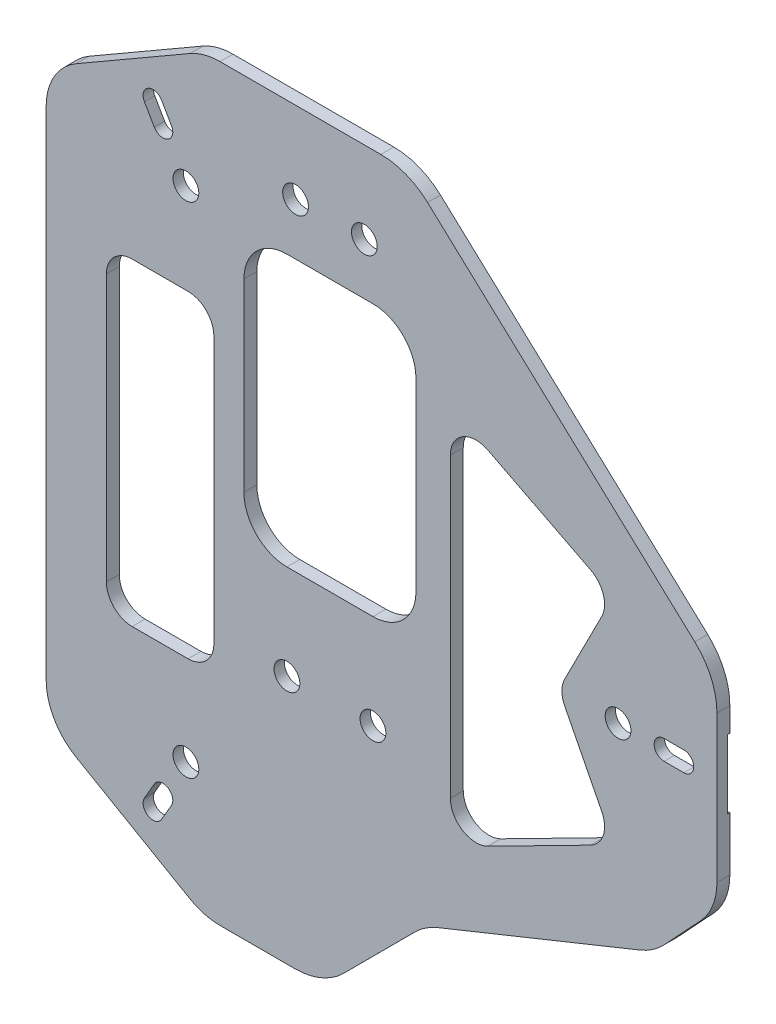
ISO-10303-21;
HEADER;
FILE_DESCRIPTION(('STEP AP214'),'2;1');
FILE_NAME('part.step','',(''),(''),'','','');
FILE_SCHEMA(('AUTOMOTIVE_DESIGN { 1 0 10303 214 1 1 1 1 }'));
ENDSEC;
DATA;
#1=APPLICATION_CONTEXT('core data for automotive mechanical design processes');
#2=APPLICATION_PROTOCOL_DEFINITION('international standard','automotive_design',2000,#1);
#3=PRODUCT_CONTEXT('',#1,'mechanical');
#4=PRODUCT('Part','Part','',(#3));
#5=PRODUCT_RELATED_PRODUCT_CATEGORY('part','',(#4));
#6=PRODUCT_DEFINITION_FORMATION('','',#4);
#7=PRODUCT_DEFINITION_CONTEXT('part definition',#1,'design');
#8=PRODUCT_DEFINITION('design','',#6,#7);
#9=PRODUCT_DEFINITION_SHAPE('','',#8);
#10=(LENGTH_UNIT() NAMED_UNIT(*) SI_UNIT(.MILLI.,.METRE.));
#11=(NAMED_UNIT(*) PLANE_ANGLE_UNIT() SI_UNIT($,.RADIAN.));
#12=(NAMED_UNIT(*) SI_UNIT($,.STERADIAN.) SOLID_ANGLE_UNIT());
#13=UNCERTAINTY_MEASURE_WITH_UNIT(LENGTH_MEASURE(1.E-05),#10,'distance_accuracy_value','');
#14=(GEOMETRIC_REPRESENTATION_CONTEXT(3) GLOBAL_UNCERTAINTY_ASSIGNED_CONTEXT((#13)) GLOBAL_UNIT_ASSIGNED_CONTEXT((#10,
#11,#12)) REPRESENTATION_CONTEXT('',''));
#15=CARTESIAN_POINT('',(0.,0.,0.));
#16=DIRECTION('',(0.,0.,1.));
#17=DIRECTION('',(1.,0.,0.));
#18=AXIS2_PLACEMENT_3D('',#15,#16,#17);
#19=CARTESIAN_POINT('',(0.,0.,-0.45));
#20=DIRECTION('',(0.,0.,-1.));
#21=DIRECTION('',(0.866025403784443,-0.499999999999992,0.));
#22=AXIS2_PLACEMENT_3D('',#19,#20,#21);
#23=PLANE('',#22);
#24=CARTESIAN_POINT('',(-16.7499999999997,-29.0118510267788,-0.45));
#25=DIRECTION('',(0.,0.,-1.));
#26=DIRECTION('',(-1.,0.,0.));
#27=AXIS2_PLACEMENT_3D('',#24,#25,#26);
#28=CIRCLE('',#27,1.5);
#29=CARTESIAN_POINT('',(-18.2499999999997,-29.0118510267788,-0.450000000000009));
#30=VERTEX_POINT('',#29);
#31=EDGE_CURVE('E560',#30,#30,#28,.F.);
#32=ORIENTED_EDGE('',*,*,#31,.T.);
#33=EDGE_LOOP('',(#32));
#34=FACE_BOUND('',#33,.T.);
#35=DIRECTION('',(-0.499999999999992,-0.866025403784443,0.));
#36=VECTOR('',#35,1.);
#37=CARTESIAN_POINT('',(-3.46410161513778,1.99999999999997,-0.450000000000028));
#38=LINE('',#37,#36);
#39=CARTESIAN_POINT('',(-19.2141016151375,-25.27980021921,-0.450000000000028));
#40=VERTEX_POINT('',#39);
#41=CARTESIAN_POINT('',(-25.9641016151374,-36.9711431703,-0.450000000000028));
#42=VERTEX_POINT('',#41);
#43=EDGE_CURVE('E646',#40,#42,#38,.T.);
#44=ORIENTED_EDGE('',*,*,#43,.F.);
#45=CARTESIAN_POINT('',(-17.9150635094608,-26.02980021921,-0.450000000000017));
#46=DIRECTION('',(0.,0.,-1.));
#47=DIRECTION('',(0.866025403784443,-0.499999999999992,0.));
#48=AXIS2_PLACEMENT_3D('',#45,#46,#47);
#49=CIRCLE('',#48,1.5);
#50=CARTESIAN_POINT('',(-17.1650635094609,-24.7307621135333,-0.450000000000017));
#51=VERTEX_POINT('',#50);
#52=EDGE_CURVE('E648',#51,#40,#49,.F.);
#53=ORIENTED_EDGE('',*,*,#52,.F.);
#54=DIRECTION('',(-0.866025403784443,0.499999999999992,0.));
#55=VECTOR('',#54,1.);
#56=CARTESIAN_POINT('',(-14.9999999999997,-25.9807621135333,-0.45));
#57=LINE('',#56,#55);
#58=CARTESIAN_POINT('',(-12.8349364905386,-27.2307621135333,-0.449999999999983));
#59=VERTEX_POINT('',#58);
#60=EDGE_CURVE('E651',#59,#51,#57,.T.);
#61=ORIENTED_EDGE('',*,*,#60,.F.);
#62=CARTESIAN_POINT('',(-13.5849364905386,-28.5298002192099,-0.449999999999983));
#63=DIRECTION('',(0.,0.,-1.));
#64=DIRECTION('',(0.866025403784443,-0.499999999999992,0.));
#65=AXIS2_PLACEMENT_3D('',#62,#63,#64);
#66=CIRCLE('',#65,1.5);
#67=CARTESIAN_POINT('',(-12.285898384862,-29.2798002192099,-0.449999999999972));
#68=VERTEX_POINT('',#67);
#69=EDGE_CURVE('E653',#68,#59,#66,.F.);
#70=ORIENTED_EDGE('',*,*,#69,.F.);
#71=DIRECTION('',(0.499999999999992,0.866025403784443,0.));
#72=VECTOR('',#71,1.);
#73=CARTESIAN_POINT('',(3.46410161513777,-1.99999999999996,-0.449999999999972));
#74=LINE('',#73,#72);
#75=CARTESIAN_POINT('',(-19.0358983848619,-40.9711431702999,-0.449999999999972));
#76=VERTEX_POINT('',#75);
#77=EDGE_CURVE('E655',#76,#68,#74,.T.);
#78=ORIENTED_EDGE('',*,*,#77,.F.);
#79=DIRECTION('',(-0.866025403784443,0.499999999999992,0.));
#80=VECTOR('',#79,1.);
#81=CARTESIAN_POINT('',(-22.4999999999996,-38.9711431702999,-0.45));
#82=LINE('',#81,#80);
#83=EDGE_CURVE('E657',#76,#42,#82,.T.);
#84=ORIENTED_EDGE('',*,*,#83,.T.);
#85=EDGE_LOOP('',(#44,#53,#61,#70,#78,#84));
#86=FACE_BOUND('',#85,.T.);
#87=CARTESIAN_POINT('',(-19.4249999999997,-33.6450869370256,-0.45));
#88=DIRECTION('',(0.,0.,-1.));
#89=DIRECTION('',(-1.,0.,0.));
#90=AXIS2_PLACEMENT_3D('',#87,#88,#89);
#91=CIRCLE('',#90,1.15);
#92=CARTESIAN_POINT('',(-20.4209292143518,-33.0700869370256,-0.450000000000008));
#93=VERTEX_POINT('',#92);
#94=CARTESIAN_POINT('',(-18.4290707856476,-34.2200869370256,-0.449999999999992));
#95=VERTEX_POINT('',#94);
#96=EDGE_CURVE('E573',#93,#95,#91,.T.);
#97=ORIENTED_EDGE('',*,*,#96,.F.);
#98=DIRECTION('',(-0.499999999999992,-0.866025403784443,0.));
#99=VECTOR('',#98,1.);
#100=CARTESIAN_POINT('',(-0.995929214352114,0.574999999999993,-0.450000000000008));
#101=LINE('',#100,#99);
#102=CARTESIAN_POINT('',(-21.5709292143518,-35.0619453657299,-0.450000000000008));
#103=VERTEX_POINT('',#102);
#104=EDGE_CURVE('E575',#93,#103,#101,.T.);
#105=ORIENTED_EDGE('',*,*,#104,.T.);
#106=CARTESIAN_POINT('',(-20.5749999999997,-35.6369453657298,-0.45));
#107=DIRECTION('',(0.,0.,-1.));
#108=DIRECTION('',(-1.,0.,0.));
#109=AXIS2_PLACEMENT_3D('',#106,#107,#108);
#110=CIRCLE('',#109,1.15);
#111=CARTESIAN_POINT('',(-19.5790707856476,-36.2119453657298,-0.450000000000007));
#112=VERTEX_POINT('',#111);
#113=EDGE_CURVE('E570',#103,#112,#110,.F.);
#114=ORIENTED_EDGE('',*,*,#113,.T.);
#115=DIRECTION('',(-0.499999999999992,-0.866025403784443,0.));
#116=VECTOR('',#115,1.);
#117=CARTESIAN_POINT('',(0.995929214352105,-0.574999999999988,-0.449999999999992));
#118=LINE('',#117,#116);
#119=EDGE_CURVE('E559',#95,#112,#118,.T.);
#120=ORIENTED_EDGE('',*,*,#119,.F.);
#121=EDGE_LOOP('',(#97,#105,#114,#120));
#122=FACE_BOUND('',#121,.T.);
#123=ADVANCED_FACE('F41',(#34,#86,#122),#23,.T.);
#124=CARTESIAN_POINT('',(0.,0.,-0.45));
#125=DIRECTION('',(0.,0.,-1.));
#126=DIRECTION('',(-0.866025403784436,-0.500000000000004,0.));
#127=AXIS2_PLACEMENT_3D('',#124,#125,#126);
#128=PLANE('',#127);
#129=CARTESIAN_POINT('',(-16.7500000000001,29.0118510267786,-0.45));
#130=DIRECTION('',(0.,0.,-1.));
#131=DIRECTION('',(-1.,0.,0.));
#132=AXIS2_PLACEMENT_3D('',#129,#130,#131);
#133=CIRCLE('',#132,1.5);
#134=CARTESIAN_POINT('',(-18.2500000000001,29.0118510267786,-0.449999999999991));
#135=VERTEX_POINT('',#134);
#136=EDGE_CURVE('E567',#135,#135,#133,.F.);
#137=ORIENTED_EDGE('',*,*,#136,.T.);
#138=EDGE_LOOP('',(#137));
#139=FACE_BOUND('',#138,.T.);
#140=DIRECTION('',(-0.500000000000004,0.866025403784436,0.));
#141=VECTOR('',#140,1.);
#142=CARTESIAN_POINT('',(3.46410161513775,2.00000000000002,-0.450000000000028));
#143=LINE('',#142,#141);
#144=CARTESIAN_POINT('',(-12.2858983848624,29.2798002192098,-0.450000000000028));
#145=VERTEX_POINT('',#144);
#146=CARTESIAN_POINT('',(-19.0358983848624,40.9711431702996,-0.450000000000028));
#147=VERTEX_POINT('',#146);
#148=EDGE_CURVE('E600',#145,#147,#143,.T.);
#149=ORIENTED_EDGE('',*,*,#148,.F.);
#150=CARTESIAN_POINT('',(-13.584936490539,28.5298002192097,-0.450000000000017));
#151=DIRECTION('',(0.,0.,-1.));
#152=DIRECTION('',(-0.866025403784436,-0.500000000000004,0.));
#153=AXIS2_PLACEMENT_3D('',#150,#151,#152);
#154=CIRCLE('',#153,1.5);
#155=CARTESIAN_POINT('',(-12.834936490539,27.2307621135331,-0.450000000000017));
#156=VERTEX_POINT('',#155);
#157=EDGE_CURVE('E602',#156,#145,#154,.F.);
#158=ORIENTED_EDGE('',*,*,#157,.F.);
#159=DIRECTION('',(0.866025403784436,0.500000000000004,0.));
#160=VECTOR('',#159,1.);
#161=CARTESIAN_POINT('',(-15.0000000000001,25.9807621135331,-0.45));
#162=LINE('',#161,#160);
#163=CARTESIAN_POINT('',(-17.1650635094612,24.7307621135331,-0.449999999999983));
#164=VERTEX_POINT('',#163);
#165=EDGE_CURVE('E605',#164,#156,#162,.T.);
#166=ORIENTED_EDGE('',*,*,#165,.F.);
#167=CARTESIAN_POINT('',(-17.9150635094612,26.0298002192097,-0.449999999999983));
#168=DIRECTION('',(0.,0.,-1.));
#169=DIRECTION('',(-0.866025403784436,-0.500000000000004,0.));
#170=AXIS2_PLACEMENT_3D('',#167,#168,#169);
#171=CIRCLE('',#170,1.5);
#172=CARTESIAN_POINT('',(-19.2141016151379,25.2798002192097,-0.449999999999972));
#173=VERTEX_POINT('',#172);
#174=EDGE_CURVE('E607',#173,#164,#171,.F.);
#175=ORIENTED_EDGE('',*,*,#174,.F.);
#176=DIRECTION('',(0.500000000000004,-0.866025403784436,0.));
#177=VECTOR('',#176,1.);
#178=CARTESIAN_POINT('',(-3.46410161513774,-2.00000000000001,-0.449999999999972));
#179=LINE('',#178,#177);
#180=CARTESIAN_POINT('',(-25.9641016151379,36.9711431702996,-0.449999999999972));
#181=VERTEX_POINT('',#180);
#182=EDGE_CURVE('E609',#181,#173,#179,.T.);
#183=ORIENTED_EDGE('',*,*,#182,.F.);
#184=DIRECTION('',(0.866025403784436,0.500000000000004,0.));
#185=VECTOR('',#184,1.);
#186=CARTESIAN_POINT('',(-22.5000000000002,38.9711431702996,-0.45));
#187=LINE('',#186,#185);
#188=EDGE_CURVE('E611',#181,#147,#187,.T.);
#189=ORIENTED_EDGE('',*,*,#188,.T.);
#190=EDGE_LOOP('',(#149,#158,#166,#175,#183,#189));
#191=FACE_BOUND('',#190,.T.);
#192=CARTESIAN_POINT('',(-19.4250000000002,33.6450869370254,-0.45));
#193=DIRECTION('',(0.,0.,-1.));
#194=DIRECTION('',(-1.,0.,0.));
#195=AXIS2_PLACEMENT_3D('',#192,#193,#194);
#196=CIRCLE('',#195,1.15);
#197=CARTESIAN_POINT('',(-18.4290707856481,34.2200869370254,-0.450000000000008));
#198=VERTEX_POINT('',#197);
#199=CARTESIAN_POINT('',(-20.4209292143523,33.0700869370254,-0.449999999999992));
#200=VERTEX_POINT('',#199);
#201=EDGE_CURVE('E538',#198,#200,#196,.T.);
#202=ORIENTED_EDGE('',*,*,#201,.F.);
#203=DIRECTION('',(-0.500000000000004,0.866025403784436,0.));
#204=VECTOR('',#203,1.);
#205=CARTESIAN_POINT('',(0.995929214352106,0.575000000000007,-0.450000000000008));
#206=LINE('',#205,#204);
#207=CARTESIAN_POINT('',(-19.5790707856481,36.2119453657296,-0.450000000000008));
#208=VERTEX_POINT('',#207);
#209=EDGE_CURVE('E530',#198,#208,#206,.T.);
#210=ORIENTED_EDGE('',*,*,#209,.T.);
#211=CARTESIAN_POINT('',(-20.5750000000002,35.6369453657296,-0.45));
#212=DIRECTION('',(0.,0.,-1.));
#213=DIRECTION('',(-1.,0.,0.));
#214=AXIS2_PLACEMENT_3D('',#211,#212,#213);
#215=CIRCLE('',#214,1.15);
#216=CARTESIAN_POINT('',(-21.5709292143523,35.0619453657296,-0.449999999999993));
#217=VERTEX_POINT('',#216);
#218=EDGE_CURVE('E514',#208,#217,#215,.F.);
#219=ORIENTED_EDGE('',*,*,#218,.T.);
#220=DIRECTION('',(-0.500000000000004,0.866025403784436,0.));
#221=VECTOR('',#220,1.);
#222=CARTESIAN_POINT('',(-0.995929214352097,-0.575000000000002,-0.449999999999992));
#223=LINE('',#222,#221);
#224=EDGE_CURVE('E542',#200,#217,#223,.T.);
#225=ORIENTED_EDGE('',*,*,#224,.F.);
#226=EDGE_LOOP('',(#202,#210,#219,#225));
#227=FACE_BOUND('',#226,.T.);
#228=ADVANCED_FACE('F537',(#139,#191,#227),#128,.T.);
#229=CARTESIAN_POINT('',(45.,10.2901377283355,0.750000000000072));
#230=DIRECTION('',(1.,0.,0.));
#231=DIRECTION('',(0.,0.,1.));
#232=AXIS2_PLACEMENT_3D('',#229,#230,#231);
#233=PLANE('',#232);
#234=DIRECTION('',(0.,-1.,0.));
#235=VECTOR('',#234,1.);
#236=CARTESIAN_POINT('',(45.,10.2901377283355,-0.749999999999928));
#237=LINE('',#236,#235);
#238=CARTESIAN_POINT('',(45.,-4.,-0.750000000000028));
#239=VERTEX_POINT('',#238);
#240=CARTESIAN_POINT('',(45.,-10.2824889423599,-0.750000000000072));
#241=VERTEX_POINT('',#240);
#242=EDGE_CURVE('E778',#239,#241,#237,.T.);
#243=ORIENTED_EDGE('',*,*,#242,.F.);
#244=DIRECTION('',(0.,0.,-1.));
#245=VECTOR('',#244,1.);
#246=CARTESIAN_POINT('',(45.,-4.,-0.450000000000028));
#247=LINE('',#246,#245);
#248=CARTESIAN_POINT('',(45.,-4.,-0.450000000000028));
#249=VERTEX_POINT('',#248);
#250=EDGE_CURVE('E753',#249,#239,#247,.T.);
#251=ORIENTED_EDGE('',*,*,#250,.F.);
#252=DIRECTION('',(0.,-1.,0.));
#253=VECTOR('',#252,1.);
#254=CARTESIAN_POINT('',(45.,0.,-0.45));
#255=LINE('',#254,#253);
#256=CARTESIAN_POINT('',(45.,4.,-0.449999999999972));
#257=VERTEX_POINT('',#256);
#258=EDGE_CURVE('E736',#257,#249,#255,.T.);
#259=ORIENTED_EDGE('',*,*,#258,.F.);
#260=DIRECTION('',(0.,0.,-1.));
#261=VECTOR('',#260,1.);
#262=CARTESIAN_POINT('',(45.,4.,-0.449999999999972));
#263=LINE('',#262,#261);
#264=CARTESIAN_POINT('',(45.,4.,-0.749999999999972));
#265=VERTEX_POINT('',#264);
#266=EDGE_CURVE('E756',#257,#265,#263,.T.);
#267=ORIENTED_EDGE('',*,*,#266,.T.);
#268=CARTESIAN_POINT('',(45.,6.7894543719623,-0.749999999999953));
#269=VERTEX_POINT('',#268);
#270=EDGE_CURVE('E779',#269,#265,#237,.T.);
#271=ORIENTED_EDGE('',*,*,#270,.F.);
#272=DIRECTION('',(0.,0.,-1.));
#273=VECTOR('',#272,1.);
#274=CARTESIAN_POINT('',(45.,6.78945437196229,0.750000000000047));
#275=LINE('',#274,#273);
#276=CARTESIAN_POINT('',(45.,6.78945437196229,0.750000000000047));
#277=VERTEX_POINT('',#276);
#278=EDGE_CURVE('E896',#269,#277,#275,.F.);
#279=ORIENTED_EDGE('',*,*,#278,.T.);
#280=DIRECTION('',(0.,-1.,0.));
#281=VECTOR('',#280,1.);
#282=CARTESIAN_POINT('',(45.,10.2901377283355,0.750000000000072));
#283=LINE('',#282,#281);
#284=CARTESIAN_POINT('',(45.,-10.2824889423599,0.749999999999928));
#285=VERTEX_POINT('',#284);
#286=EDGE_CURVE('E809',#277,#285,#283,.T.);
#287=ORIENTED_EDGE('',*,*,#286,.T.);
#288=DIRECTION('',(0.,0.,-1.));
#289=VECTOR('',#288,1.);
#290=CARTESIAN_POINT('',(45.,-10.2824889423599,0.749999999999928));
#291=LINE('',#290,#289);
#292=EDGE_CURVE('E867',#285,#241,#291,.T.);
#293=ORIENTED_EDGE('',*,*,#292,.T.);
#294=EDGE_LOOP('',(#243,#251,#259,#267,#271,#279,#287,#293));
#295=FACE_BOUND('',#294,.T.);
#296=ADVANCED_FACE('F1171',(#295),#233,.T.);
#297=CARTESIAN_POINT('',(-33.,0.,0.75));
#298=DIRECTION('',(1.,0.,0.));
#299=DIRECTION('',(0.,0.,1.));
#300=AXIS2_PLACEMENT_3D('',#297,#298,#299);
#301=PLANE('',#300);
#302=DIRECTION('',(0.,1.,0.));
#303=VECTOR('',#302,1.);
#304=CARTESIAN_POINT('',(-33.,0.,0.75));
#305=LINE('',#304,#303);
#306=CARTESIAN_POINT('',(-33.,-28.8685481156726,0.749999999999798));
#307=VERTEX_POINT('',#306);
#308=CARTESIAN_POINT('',(-33.,28.8685481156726,0.750000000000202));
#309=VERTEX_POINT('',#308);
#310=EDGE_CURVE('E797',#307,#309,#305,.T.);
#311=ORIENTED_EDGE('',*,*,#310,.T.);
#312=DIRECTION('',(0.,0.,-1.));
#313=VECTOR('',#312,1.);
#314=CARTESIAN_POINT('',(-33.,28.8685481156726,-0.749999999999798));
#315=LINE('',#314,#313);
#316=CARTESIAN_POINT('',(-33.,28.8685481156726,-0.749999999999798));
#317=VERTEX_POINT('',#316);
#318=EDGE_CURVE('E856',#309,#317,#315,.T.);
#319=ORIENTED_EDGE('',*,*,#318,.T.);
#320=DIRECTION('',(0.,1.,0.));
#321=VECTOR('',#320,1.);
#322=CARTESIAN_POINT('',(-33.,0.,-0.75));
#323=LINE('',#322,#321);
#324=CARTESIAN_POINT('',(-33.,-28.8685481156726,-0.750000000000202));
#325=VERTEX_POINT('',#324);
#326=EDGE_CURVE('E755',#325,#317,#323,.T.);
#327=ORIENTED_EDGE('',*,*,#326,.F.);
#328=DIRECTION('',(0.,0.,-1.));
#329=VECTOR('',#328,1.);
#330=CARTESIAN_POINT('',(-33.,-28.8685481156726,0.749999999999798));
#331=LINE('',#330,#329);
#332=EDGE_CURVE('E854',#325,#307,#331,.F.);
#333=ORIENTED_EDGE('',*,*,#332,.T.);
#334=EDGE_LOOP('',(#311,#319,#327,#333));
#335=FACE_BOUND('',#334,.T.);
#336=ADVANCED_FACE('F1117',(#335),#301,.F.);
#337=CARTESIAN_POINT('',(-33.,-32.91,0.74999999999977));
#338=DIRECTION('',(0.5,0.866025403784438,0.));
#339=DIRECTION('',(0.866025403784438,-0.5,0.));
#340=AXIS2_PLACEMENT_3D('',#337,#338,#339);
#341=PLANE('',#340);
#342=DIRECTION('',(0.866025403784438,-0.5,0.));
#343=VECTOR('',#342,1.);
#344=CARTESIAN_POINT('',(-33.,-32.91,0.74999999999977));
#345=LINE('',#344,#343);
#346=CARTESIAN_POINT('',(-29.5,-34.9307259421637,0.749999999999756));
#347=VERTEX_POINT('',#346);
#348=CARTESIAN_POINT('',(-16.2819376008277,-42.5621778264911,0.749999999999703));
#349=VERTEX_POINT('',#348);
#350=EDGE_CURVE('E823',#347,#349,#345,.T.);
#351=ORIENTED_EDGE('',*,*,#350,.F.);
#352=DIRECTION('',(0.,0.,-1.));
#353=VECTOR('',#352,1.);
#354=CARTESIAN_POINT('',(-29.5,-34.9307259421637,0.749999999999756));
#355=LINE('',#354,#353);
#356=CARTESIAN_POINT('',(-29.5,-34.9307259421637,-0.750000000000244));
#357=VERTEX_POINT('',#356);
#358=EDGE_CURVE('E861',#347,#357,#355,.T.);
#359=ORIENTED_EDGE('',*,*,#358,.T.);
#360=DIRECTION('',(0.866025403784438,-0.5,0.));
#361=VECTOR('',#360,1.);
#362=CARTESIAN_POINT('',(-33.,-32.91,-0.75000000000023));
#363=LINE('',#362,#361);
#364=CARTESIAN_POINT('',(-16.2819376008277,-42.5621778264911,-0.750000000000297));
#365=VERTEX_POINT('',#364);
#366=EDGE_CURVE('E794',#357,#365,#363,.T.);
#367=ORIENTED_EDGE('',*,*,#366,.T.);
#368=DIRECTION('',(0.,0.,-1.));
#369=VECTOR('',#368,1.);
#370=CARTESIAN_POINT('',(-16.2819376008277,-42.5621778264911,0.749999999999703));
#371=LINE('',#370,#369);
#372=EDGE_CURVE('E859',#365,#349,#371,.F.);
#373=ORIENTED_EDGE('',*,*,#372,.T.);
#374=EDGE_LOOP('',(#351,#359,#367,#373));
#375=FACE_BOUND('',#374,.T.);
#376=ADVANCED_FACE('F1126',(#375),#341,.F.);
#377=CARTESIAN_POINT('',(-14.6575819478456,-43.5,0.749999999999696));
#378=DIRECTION('',(0.,1.,0.));
#379=DIRECTION('',(1.,0.,0.));
#380=AXIS2_PLACEMENT_3D('',#377,#378,#379);
#381=PLANE('',#380);
#382=DIRECTION('',(1.,0.,0.));
#383=VECTOR('',#382,1.);
#384=CARTESIAN_POINT('',(-14.6575819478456,-43.5,-0.750000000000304));
#385=LINE('',#384,#383);
#386=CARTESIAN_POINT('',(-12.7819376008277,-43.5,-0.750000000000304));
#387=VERTEX_POINT('',#386);
#388=CARTESIAN_POINT('',(-4.09581295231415,-43.5,-0.750000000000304));
#389=VERTEX_POINT('',#388);
#390=EDGE_CURVE('E791',#387,#389,#385,.T.);
#391=ORIENTED_EDGE('',*,*,#390,.T.);
#392=DIRECTION('',(0.,0.,-1.));
#393=VECTOR('',#392,1.);
#394=CARTESIAN_POINT('',(-4.09581295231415,-43.5,0.749999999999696));
#395=LINE('',#394,#393);
#396=CARTESIAN_POINT('',(-4.09581295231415,-43.5,0.749999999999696));
#397=VERTEX_POINT('',#396);
#398=EDGE_CURVE('E911',#389,#397,#395,.F.);
#399=ORIENTED_EDGE('',*,*,#398,.T.);
#400=DIRECTION('',(1.,0.,0.));
#401=VECTOR('',#400,1.);
#402=CARTESIAN_POINT('',(-14.6575819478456,-43.5,0.749999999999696));
#403=LINE('',#402,#401);
#404=CARTESIAN_POINT('',(-12.7819376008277,-43.5,0.749999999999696));
#405=VERTEX_POINT('',#404);
#406=EDGE_CURVE('E820',#405,#397,#403,.T.);
#407=ORIENTED_EDGE('',*,*,#406,.F.);
#408=DIRECTION('',(0.,0.,-1.));
#409=VECTOR('',#408,1.);
#410=CARTESIAN_POINT('',(-12.7819376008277,-43.5,0.749999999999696));
#411=LINE('',#410,#409);
#412=EDGE_CURVE('E864',#405,#387,#411,.T.);
#413=ORIENTED_EDGE('',*,*,#412,.T.);
#414=EDGE_LOOP('',(#391,#399,#407,#413));
#415=FACE_BOUND('',#414,.T.);
#416=ADVANCED_FACE('F1135',(#415),#381,.F.);
#417=CARTESIAN_POINT('',(-0.777581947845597,-43.5,0.749999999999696));
#418=DIRECTION('',(-0.707788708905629,0.706424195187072,0.));
#419=DIRECTION('',(0.706424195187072,0.707788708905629,0.));
#420=AXIS2_PLACEMENT_3D('',#417,#418,#419);
#421=PLANE('',#420);
#422=DIRECTION('',(0.706424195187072,0.70778870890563,0.));
#423=VECTOR('',#422,1.);
#424=CARTESIAN_POINT('',(-0.777581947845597,-43.5,0.749999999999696));
#425=LINE('',#424,#423);
#426=CARTESIAN_POINT('',(1.56649671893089,-41.1513935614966,0.749999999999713));
#427=VERTEX_POINT('',#426);
#428=CARTESIAN_POINT('',(9.89435499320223,-32.807449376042,0.749999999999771));
#429=VERTEX_POINT('',#428);
#430=EDGE_CURVE('E817',#427,#429,#425,.T.);
#431=ORIENTED_EDGE('',*,*,#430,.F.);
#432=DIRECTION('',(0.,0.,-1.));
#433=VECTOR('',#432,1.);
#434=CARTESIAN_POINT('',(1.56649671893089,-41.1513935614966,0.749999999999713));
#435=LINE('',#434,#433);
#436=CARTESIAN_POINT('',(1.56649671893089,-41.1513935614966,-0.750000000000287));
#437=VERTEX_POINT('',#436);
#438=EDGE_CURVE('E908',#427,#437,#435,.T.);
#439=ORIENTED_EDGE('',*,*,#438,.T.);
#440=DIRECTION('',(0.706424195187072,0.70778870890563,0.));
#441=VECTOR('',#440,1.);
#442=CARTESIAN_POINT('',(-0.777581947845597,-43.5,-0.750000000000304));
#443=LINE('',#442,#441);
#444=CARTESIAN_POINT('',(9.89435499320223,-32.807449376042,-0.750000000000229));
#445=VERTEX_POINT('',#444);
#446=EDGE_CURVE('E788',#437,#445,#443,.T.);
#447=ORIENTED_EDGE('',*,*,#446,.T.);
#448=DIRECTION('',(0.,0.,-1.));
#449=VECTOR('',#448,1.);
#450=CARTESIAN_POINT('',(9.89435499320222,-32.807449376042,0.749999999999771));
#451=LINE('',#450,#449);
#452=EDGE_CURVE('E906',#445,#429,#451,.F.);
#453=ORIENTED_EDGE('',*,*,#452,.T.);
#454=EDGE_LOOP('',(#431,#439,#447,#453));
#455=FACE_BOUND('',#454,.T.);
#456=ADVANCED_FACE('F1144',(#455),#421,.F.);
#457=CARTESIAN_POINT('',(11.047959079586,-31.6516170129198,0.749999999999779));
#458=DIRECTION('',(-0.374299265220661,0.927307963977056,0.));
#459=DIRECTION('',(0.927307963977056,0.374299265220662,0.));
#460=AXIS2_PLACEMENT_3D('',#457,#458,#459);
#461=PLANE('',#460);
#462=DIRECTION('',(0.927307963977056,0.374299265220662,0.));
#463=VECTOR('',#462,1.);
#464=CARTESIAN_POINT('',(11.047959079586,-31.6516170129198,-0.750000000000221));
#465=LINE('',#464,#463);
#466=CARTESIAN_POINT('',(12.562270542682,-31.0403792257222,-0.750000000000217));
#467=VERTEX_POINT('',#466);
#468=CARTESIAN_POINT('',(36.0157739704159,-21.5735899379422,-0.750000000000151));
#469=VERTEX_POINT('',#468);
#470=EDGE_CURVE('E785',#467,#469,#465,.T.);
#471=ORIENTED_EDGE('',*,*,#470,.T.);
#472=DIRECTION('',(0.,0.,-1.));
#473=VECTOR('',#472,1.);
#474=CARTESIAN_POINT('',(36.0157739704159,-21.5735899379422,0.749999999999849));
#475=LINE('',#474,#473);
#476=CARTESIAN_POINT('',(36.0157739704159,-21.5735899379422,0.749999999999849));
#477=VERTEX_POINT('',#476);
#478=EDGE_CURVE('E904',#469,#477,#475,.F.);
#479=ORIENTED_EDGE('',*,*,#478,.T.);
#480=DIRECTION('',(0.927307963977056,0.374299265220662,0.));
#481=VECTOR('',#480,1.);
#482=CARTESIAN_POINT('',(11.047959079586,-31.6516170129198,0.749999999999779));
#483=LINE('',#482,#481);
#484=CARTESIAN_POINT('',(12.562270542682,-31.0403792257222,0.749999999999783));
#485=VERTEX_POINT('',#484);
#486=EDGE_CURVE('E814',#485,#477,#483,.T.);
#487=ORIENTED_EDGE('',*,*,#486,.F.);
#488=DIRECTION('',(0.,0.,-1.));
#489=VECTOR('',#488,1.);
#490=CARTESIAN_POINT('',(12.562270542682,-31.0403792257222,-0.750000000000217));
#491=LINE('',#490,#489);
#492=EDGE_CURVE('E901',#485,#467,#491,.T.);
#493=ORIENTED_EDGE('',*,*,#492,.T.);
#494=EDGE_LOOP('',(#471,#479,#487,#493));
#495=FACE_BOUND('',#494,.T.);
#496=ADVANCED_FACE('F1153',(#495),#461,.F.);
#497=CARTESIAN_POINT('',(45.,-13.0398622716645,0.749999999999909));
#498=DIRECTION('',(0.731353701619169,-0.681998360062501,0.));
#499=DIRECTION('',(-0.681998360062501,-0.731353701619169,0.));
#500=AXIS2_PLACEMENT_3D('',#497,#498,#499);
#501=PLANE('',#500);
#502=DIRECTION('',(-0.681998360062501,-0.731353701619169,0.));
#503=VECTOR('',#502,1.);
#504=CARTESIAN_POINT('',(45.,-13.0398622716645,0.749999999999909));
#505=LINE('',#504,#503);
#506=CARTESIAN_POINT('',(43.1194759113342,-15.0564774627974,0.749999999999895));
#507=VERTEX_POINT('',#506);
#508=CARTESIAN_POINT('',(38.8722094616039,-19.6111131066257,0.749999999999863));
#509=VERTEX_POINT('',#508);
#510=EDGE_CURVE('E811',#507,#509,#505,.T.);
#511=ORIENTED_EDGE('',*,*,#510,.T.);
#512=DIRECTION('',(0.,0.,-1.));
#513=VECTOR('',#512,1.);
#514=CARTESIAN_POINT('',(38.8722094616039,-19.6111131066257,-0.750000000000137));
#515=LINE('',#514,#513);
#516=CARTESIAN_POINT('',(38.8722094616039,-19.6111131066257,-0.750000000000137));
#517=VERTEX_POINT('',#516);
#518=EDGE_CURVE('E898',#509,#517,#515,.T.);
#519=ORIENTED_EDGE('',*,*,#518,.T.);
#520=DIRECTION('',(-0.681998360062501,-0.731353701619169,0.));
#521=VECTOR('',#520,1.);
#522=CARTESIAN_POINT('',(45.,-13.0398622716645,-0.750000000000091));
#523=LINE('',#522,#521);
#524=CARTESIAN_POINT('',(43.1194759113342,-15.0564774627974,-0.750000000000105));
#525=VERTEX_POINT('',#524);
#526=EDGE_CURVE('E782',#525,#517,#523,.T.);
#527=ORIENTED_EDGE('',*,*,#526,.F.);
#528=DIRECTION('',(0.,0.,-1.));
#529=VECTOR('',#528,1.);
#530=CARTESIAN_POINT('',(43.1194759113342,-15.0564774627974,0.749999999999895));
#531=LINE('',#530,#529);
#532=EDGE_CURVE('E870',#525,#507,#531,.F.);
#533=ORIENTED_EDGE('',*,*,#532,.T.);
#534=EDGE_LOOP('',(#511,#519,#527,#533));
#535=FACE_BOUND('',#534,.T.);
#536=ADVANCED_FACE('F1161',(#535),#501,.T.);
#537=CARTESIAN_POINT('',(9.05241805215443,43.5,0.750000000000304));
#538=DIRECTION('',(0.678583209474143,0.734523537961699,0.));
#539=DIRECTION('',(0.734523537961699,-0.678583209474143,0.));
#540=AXIS2_PLACEMENT_3D('',#537,#538,#539);
#541=PLANE('',#540);
#542=DIRECTION('',(0.734523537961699,-0.678583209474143,0.));
#543=VECTOR('',#542,1.);
#544=CARTESIAN_POINT('',(9.05241805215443,43.5,-0.749999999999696));
#545=LINE('',#544,#543);
#546=CARTESIAN_POINT('',(11.351310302,41.3761883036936,-0.749999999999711));
#547=VERTEX_POINT('',#546);
#548=CARTESIAN_POINT('',(42.4286656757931,12.6656426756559,-0.749999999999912));
#549=VERTEX_POINT('',#548);
#550=EDGE_CURVE('E775',#547,#549,#545,.T.);
#551=ORIENTED_EDGE('',*,*,#550,.F.);
#552=DIRECTION('',(0.,0.,-1.));
#553=VECTOR('',#552,1.);
#554=CARTESIAN_POINT('',(11.351310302,41.3761883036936,0.750000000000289));
#555=LINE('',#554,#553);
#556=CARTESIAN_POINT('',(11.351310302,41.3761883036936,0.750000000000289));
#557=VERTEX_POINT('',#556);
#558=EDGE_CURVE('E886',#547,#557,#555,.F.);
#559=ORIENTED_EDGE('',*,*,#558,.T.);
#560=DIRECTION('',(0.734523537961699,-0.678583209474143,0.));
#561=VECTOR('',#560,1.);
#562=CARTESIAN_POINT('',(9.05241805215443,43.5,0.750000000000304));
#563=LINE('',#562,#561);
#564=CARTESIAN_POINT('',(42.4286656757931,12.6656426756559,0.750000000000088));
#565=VERTEX_POINT('',#564);
#566=EDGE_CURVE('E806',#557,#565,#563,.T.);
#567=ORIENTED_EDGE('',*,*,#566,.T.);
#568=DIRECTION('',(0.,0.,-1.));
#569=VECTOR('',#568,1.);
#570=CARTESIAN_POINT('',(42.4286656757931,12.6656426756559,0.750000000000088));
#571=LINE('',#570,#569);
#572=EDGE_CURVE('E883',#565,#549,#571,.T.);
#573=ORIENTED_EDGE('',*,*,#572,.T.);
#574=EDGE_LOOP('',(#551,#559,#567,#573));
#575=FACE_BOUND('',#574,.T.);
#576=ADVANCED_FACE('F1177',(#575),#541,.T.);
#577=CARTESIAN_POINT('',(-14.6575819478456,43.5,0.750000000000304));
#578=DIRECTION('',(0.,1.,0.));
#579=DIRECTION('',(1.,0.,0.));
#580=AXIS2_PLACEMENT_3D('',#577,#578,#579);
#581=PLANE('',#580);
#582=DIRECTION('',(1.,0.,0.));
#583=VECTOR('',#582,1.);
#584=CARTESIAN_POINT('',(-14.6575819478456,43.5,0.750000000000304));
#585=LINE('',#584,#583);
#586=CARTESIAN_POINT('',(-12.7819376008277,43.5,0.750000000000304));
#587=VERTEX_POINT('',#586);
#588=CARTESIAN_POINT('',(5.92264462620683,43.5,0.750000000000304));
#589=VERTEX_POINT('',#588);
#590=EDGE_CURVE('E803',#587,#589,#585,.T.);
#591=ORIENTED_EDGE('',*,*,#590,.T.);
#592=DIRECTION('',(0.,0.,-1.));
#593=VECTOR('',#592,1.);
#594=CARTESIAN_POINT('',(5.92264462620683,43.5,0.750000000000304));
#595=LINE('',#594,#593);
#596=CARTESIAN_POINT('',(5.92264462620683,43.5,-0.749999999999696));
#597=VERTEX_POINT('',#596);
#598=EDGE_CURVE('E872',#589,#597,#595,.T.);
#599=ORIENTED_EDGE('',*,*,#598,.T.);
#600=DIRECTION('',(1.,0.,0.));
#601=VECTOR('',#600,1.);
#602=CARTESIAN_POINT('',(-14.6575819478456,43.5,-0.749999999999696));
#603=LINE('',#602,#601);
#604=CARTESIAN_POINT('',(-12.7819376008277,43.5,-0.749999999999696));
#605=VERTEX_POINT('',#604);
#606=EDGE_CURVE('E772',#605,#597,#603,.T.);
#607=ORIENTED_EDGE('',*,*,#606,.F.);
#608=DIRECTION('',(0.,0.,-1.));
#609=VECTOR('',#608,1.);
#610=CARTESIAN_POINT('',(-12.7819376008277,43.5,0.750000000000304));
#611=LINE('',#610,#609);
#612=EDGE_CURVE('E841',#605,#587,#611,.F.);
#613=ORIENTED_EDGE('',*,*,#612,.T.);
#614=EDGE_LOOP('',(#591,#599,#607,#613));
#615=FACE_BOUND('',#614,.T.);
#616=ADVANCED_FACE('F1098',(#615),#581,.T.);
#617=CARTESIAN_POINT('',(-33.,32.91,0.75000000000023));
#618=DIRECTION('',(-0.5,0.866025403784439,0.));
#619=DIRECTION('',(0.866025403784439,0.5,0.));
#620=AXIS2_PLACEMENT_3D('',#617,#618,#619);
#621=PLANE('',#620);
#622=DIRECTION('',(0.866025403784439,0.499999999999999,0.));
#623=VECTOR('',#622,1.);
#624=CARTESIAN_POINT('',(-33.,32.91,0.75000000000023));
#625=LINE('',#624,#623);
#626=CARTESIAN_POINT('',(-29.5,34.9307259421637,0.750000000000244));
#627=VERTEX_POINT('',#626);
#628=CARTESIAN_POINT('',(-16.2819376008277,42.5621778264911,0.750000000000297));
#629=VERTEX_POINT('',#628);
#630=EDGE_CURVE('E800',#627,#629,#625,.T.);
#631=ORIENTED_EDGE('',*,*,#630,.T.);
#632=DIRECTION('',(0.,0.,-1.));
#633=VECTOR('',#632,1.);
#634=CARTESIAN_POINT('',(-16.2819376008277,42.5621778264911,0.750000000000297));
#635=LINE('',#634,#633);
#636=CARTESIAN_POINT('',(-16.2819376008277,42.5621778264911,-0.749999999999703));
#637=VERTEX_POINT('',#636);
#638=EDGE_CURVE('E828',#629,#637,#635,.T.);
#639=ORIENTED_EDGE('',*,*,#638,.T.);
#640=DIRECTION('',(0.866025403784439,0.499999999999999,0.));
#641=VECTOR('',#640,1.);
#642=CARTESIAN_POINT('',(-33.,32.91,-0.74999999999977));
#643=LINE('',#642,#641);
#644=CARTESIAN_POINT('',(-29.5,34.9307259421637,-0.749999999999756));
#645=VERTEX_POINT('',#644);
#646=EDGE_CURVE('E769',#645,#637,#643,.T.);
#647=ORIENTED_EDGE('',*,*,#646,.F.);
#648=DIRECTION('',(0.,0.,-1.));
#649=VECTOR('',#648,1.);
#650=CARTESIAN_POINT('',(-29.5,34.9307259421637,0.750000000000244));
#651=LINE('',#650,#649);
#652=EDGE_CURVE('E826',#645,#627,#651,.F.);
#653=ORIENTED_EDGE('',*,*,#652,.T.);
#654=EDGE_LOOP('',(#631,#639,#647,#653));
#655=FACE_BOUND('',#654,.T.);
#656=ADVANCED_FACE('F1070',(#655),#621,.T.);
#657=CARTESIAN_POINT('',(0.,0.,0.75));
#658=DIRECTION('',(0.,0.,-1.));
#659=DIRECTION('',(1.,0.,0.));
#660=AXIS2_PLACEMENT_3D('',#657,#658,#659);
#661=PLANE('',#660);
#662=CARTESIAN_POINT('',(5.,-14.5,0.750000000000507));
#663=DIRECTION('',(0.,0.,-1.));
#664=DIRECTION('',(0.,1.,0.));
#665=AXIS2_PLACEMENT_3D('',#662,#663,#664);
#666=CIRCLE('',#665,1.5);
#667=CARTESIAN_POINT('',(5.,-13.,0.750000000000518));
#668=VERTEX_POINT('',#667);
#669=EDGE_CURVE('E1922',#668,#668,#666,.T.);
#670=ORIENTED_EDGE('',*,*,#669,.T.);
#671=EDGE_LOOP('',(#670));
#672=FACE_BOUND('',#671,.T.);
#673=CARTESIAN_POINT('',(-5.,-14.5,0.750000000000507));
#674=DIRECTION('',(0.,0.,-1.));
#675=DIRECTION('',(0.,1.,0.));
#676=AXIS2_PLACEMENT_3D('',#673,#674,#675);
#677=CIRCLE('',#676,1.5);
#678=CARTESIAN_POINT('',(-5.,-13.,0.750000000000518));
#679=VERTEX_POINT('',#678);
#680=EDGE_CURVE('E1934',#679,#679,#677,.T.);
#681=ORIENTED_EDGE('',*,*,#680,.T.);
#682=EDGE_LOOP('',(#681));
#683=FACE_BOUND('',#682,.T.);
#684=CARTESIAN_POINT('',(4.,34.,0.750000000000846));
#685=DIRECTION('',(0.,0.,-1.));
#686=DIRECTION('',(0.,1.,0.));
#687=AXIS2_PLACEMENT_3D('',#684,#685,#686);
#688=CIRCLE('',#687,1.5);
#689=CARTESIAN_POINT('',(4.,35.5,0.750000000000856));
#690=VERTEX_POINT('',#689);
#691=EDGE_CURVE('E1946',#690,#690,#688,.T.);
#692=ORIENTED_EDGE('',*,*,#691,.T.);
#693=EDGE_LOOP('',(#692));
#694=FACE_BOUND('',#693,.T.);
#695=CARTESIAN_POINT('',(-4.,34.,0.750000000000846));
#696=DIRECTION('',(0.,0.,-1.));
#697=DIRECTION('',(0.,1.,0.));
#698=AXIS2_PLACEMENT_3D('',#695,#696,#697);
#699=CIRCLE('',#698,1.5);
#700=CARTESIAN_POINT('',(-4.,35.5,0.750000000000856));
#701=VERTEX_POINT('',#700);
#702=EDGE_CURVE('E1958',#701,#701,#699,.T.);
#703=ORIENTED_EDGE('',*,*,#702,.T.);
#704=EDGE_LOOP('',(#703));
#705=FACE_BOUND('',#704,.T.);
#706=DIRECTION('',(0.,1.,0.));
#707=VECTOR('',#706,1.);
#708=CARTESIAN_POINT('',(-13.5,18.5,0.75));
#709=LINE('',#708,#707);
#710=CARTESIAN_POINT('',(-13.5,-15.5,0.75));
#711=VERTEX_POINT('',#710);
#712=CARTESIAN_POINT('',(-13.5,15.5,0.75));
#713=VERTEX_POINT('',#712);
#714=EDGE_CURVE('E1974',#711,#713,#709,.T.);
#715=ORIENTED_EDGE('',*,*,#714,.F.);
#716=CARTESIAN_POINT('',(-16.5,-15.5,0.749999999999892));
#717=DIRECTION('',(0.,0.,-1.));
#718=DIRECTION('',(0.,1.,0.));
#719=AXIS2_PLACEMENT_3D('',#716,#717,#718);
#720=CIRCLE('',#719,3.);
#721=CARTESIAN_POINT('',(-16.5,-18.5,0.75));
#722=VERTEX_POINT('',#721);
#723=EDGE_CURVE('E970',#711,#722,#720,.T.);
#724=ORIENTED_EDGE('',*,*,#723,.T.);
#725=DIRECTION('',(1.,0.,0.));
#726=VECTOR('',#725,1.);
#727=CARTESIAN_POINT('',(-13.5,-18.5,0.75));
#728=LINE('',#727,#726);
#729=CARTESIAN_POINT('',(-23.,-18.5,0.75));
#730=VERTEX_POINT('',#729);
#731=EDGE_CURVE('E1971',#730,#722,#728,.T.);
#732=ORIENTED_EDGE('',*,*,#731,.F.);
#733=CARTESIAN_POINT('',(-23.,-15.5,0.749999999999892));
#734=DIRECTION('',(0.,0.,-1.));
#735=DIRECTION('',(0.,1.,0.));
#736=AXIS2_PLACEMENT_3D('',#733,#734,#735);
#737=CIRCLE('',#736,3.);
#738=CARTESIAN_POINT('',(-26.,-15.5,0.75));
#739=VERTEX_POINT('',#738);
#740=EDGE_CURVE('E966',#730,#739,#737,.T.);
#741=ORIENTED_EDGE('',*,*,#740,.T.);
#742=DIRECTION('',(0.,-1.,0.));
#743=VECTOR('',#742,1.);
#744=CARTESIAN_POINT('',(-26.,-18.5,0.75));
#745=LINE('',#744,#743);
#746=CARTESIAN_POINT('',(-26.,15.5,0.75));
#747=VERTEX_POINT('',#746);
#748=EDGE_CURVE('E1980',#747,#739,#745,.T.);
#749=ORIENTED_EDGE('',*,*,#748,.F.);
#750=CARTESIAN_POINT('',(-23.,15.5,0.750000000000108));
#751=DIRECTION('',(0.,0.,-1.));
#752=DIRECTION('',(0.,1.,0.));
#753=AXIS2_PLACEMENT_3D('',#750,#751,#752);
#754=CIRCLE('',#753,3.);
#755=CARTESIAN_POINT('',(-23.,18.5,0.75));
#756=VERTEX_POINT('',#755);
#757=EDGE_CURVE('E974',#747,#756,#754,.T.);
#758=ORIENTED_EDGE('',*,*,#757,.T.);
#759=DIRECTION('',(-1.,0.,0.));
#760=VECTOR('',#759,1.);
#761=CARTESIAN_POINT('',(-26.,18.5,0.75));
#762=LINE('',#761,#760);
#763=CARTESIAN_POINT('',(-16.5,18.5,0.75));
#764=VERTEX_POINT('',#763);
#765=EDGE_CURVE('E1977',#764,#756,#762,.T.);
#766=ORIENTED_EDGE('',*,*,#765,.F.);
#767=CARTESIAN_POINT('',(-16.5,15.5,0.750000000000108));
#768=DIRECTION('',(0.,0.,-1.));
#769=DIRECTION('',(0.,1.,0.));
#770=AXIS2_PLACEMENT_3D('',#767,#768,#769);
#771=CIRCLE('',#770,3.);
#772=EDGE_CURVE('E978',#764,#713,#771,.T.);
#773=ORIENTED_EDGE('',*,*,#772,.T.);
#774=EDGE_LOOP('',(#715,#724,#732,#741,#749,#758,#766,#773));
#775=FACE_BOUND('',#774,.T.);
#776=DIRECTION('',(0.453469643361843,0.891271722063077,0.));
#777=VECTOR('',#776,1.);
#778=CARTESIAN_POINT('',(26.6073498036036,0.,0.75));
#779=LINE('',#778,#777);
#780=CARTESIAN_POINT('',(27.2995115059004,1.36040893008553,0.75));
#781=VERTEX_POINT('',#780);
#782=CARTESIAN_POINT('',(31.6099148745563,9.83228943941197,0.75));
#783=VERTEX_POINT('',#782);
#784=EDGE_CURVE('E1987',#781,#783,#779,.T.);
#785=ORIENTED_EDGE('',*,*,#784,.F.);
#786=CARTESIAN_POINT('',(29.9733266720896,0.,0.75));
#787=DIRECTION('',(0.,0.,-1.));
#788=DIRECTION('',(0.,1.,0.));
#789=AXIS2_PLACEMENT_3D('',#786,#787,#788);
#790=CIRCLE('',#789,3.);
#791=CARTESIAN_POINT('',(27.2995115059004,-1.36040893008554,0.75));
#792=VERTEX_POINT('',#791);
#793=EDGE_CURVE('E942',#781,#792,#790,.F.);
#794=ORIENTED_EDGE('',*,*,#793,.T.);
#795=DIRECTION('',(-0.453469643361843,0.891271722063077,0.));
#796=VECTOR('',#795,1.);
#797=CARTESIAN_POINT('',(32.9695288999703,-12.504542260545,0.75));
#798=LINE('',#797,#796);
#799=CARTESIAN_POINT('',(31.6099148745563,-9.83228943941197,0.75));
#800=VERTEX_POINT('',#799);
#801=EDGE_CURVE('E1990',#800,#792,#798,.T.);
#802=ORIENTED_EDGE('',*,*,#801,.F.);
#803=CARTESIAN_POINT('',(28.9360997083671,-11.1926983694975,0.749999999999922));
#804=DIRECTION('',(0.,0.,-1.));
#805=DIRECTION('',(0.,1.,0.));
#806=AXIS2_PLACEMENT_3D('',#803,#804,#805);
#807=CIRCLE('',#806,3.);
#808=CARTESIAN_POINT('',(30.2980712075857,-13.8657179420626,0.75));
#809=VERTEX_POINT('',#808);
#810=EDGE_CURVE('E990',#800,#809,#807,.T.);
#811=ORIENTED_EDGE('',*,*,#810,.T.);
#812=DIRECTION('',(0.891006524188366,0.453990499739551,0.));
#813=VECTOR('',#812,1.);
#814=CARTESIAN_POINT('',(14.,-22.17,0.75));
#815=LINE('',#814,#813);
#816=CARTESIAN_POINT('',(18.3619714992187,-19.9474645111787,0.75));
#817=VERTEX_POINT('',#816);
#818=EDGE_CURVE('E1993',#817,#809,#815,.T.);
#819=ORIENTED_EDGE('',*,*,#818,.F.);
#820=CARTESIAN_POINT('',(17.,-17.2744449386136,0.749999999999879));
#821=DIRECTION('',(0.,0.,-1.));
#822=DIRECTION('',(0.,1.,0.));
#823=AXIS2_PLACEMENT_3D('',#820,#821,#822);
#824=CIRCLE('',#823,3.);
#825=CARTESIAN_POINT('',(14.,-17.2744449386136,0.75));
#826=VERTEX_POINT('',#825);
#827=EDGE_CURVE('E982',#817,#826,#824,.T.);
#828=ORIENTED_EDGE('',*,*,#827,.T.);
#829=DIRECTION('',(0.,-1.,0.));
#830=VECTOR('',#829,1.);
#831=CARTESIAN_POINT('',(14.,22.17,0.75));
#832=LINE('',#831,#830);
#833=CARTESIAN_POINT('',(14.,17.2744449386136,0.75));
#834=VERTEX_POINT('',#833);
#835=EDGE_CURVE('E1996',#834,#826,#832,.T.);
#836=ORIENTED_EDGE('',*,*,#835,.F.);
#837=CARTESIAN_POINT('',(17.,17.2744449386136,0.750000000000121));
#838=DIRECTION('',(0.,0.,-1.));
#839=DIRECTION('',(0.,1.,0.));
#840=AXIS2_PLACEMENT_3D('',#837,#838,#839);
#841=CIRCLE('',#840,3.);
#842=CARTESIAN_POINT('',(18.3619714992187,19.9474645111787,0.75));
#843=VERTEX_POINT('',#842);
#844=EDGE_CURVE('E986',#834,#843,#841,.T.);
#845=ORIENTED_EDGE('',*,*,#844,.T.);
#846=DIRECTION('',(-0.891006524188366,0.45399049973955,0.));
#847=VECTOR('',#846,1.);
#848=CARTESIAN_POINT('',(32.9695288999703,12.504542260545,0.75));
#849=LINE('',#848,#847);
#850=CARTESIAN_POINT('',(30.2980712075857,13.8657179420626,0.75));
#851=VERTEX_POINT('',#850);
#852=EDGE_CURVE('E1999',#851,#843,#849,.T.);
#853=ORIENTED_EDGE('',*,*,#852,.F.);
#854=CARTESIAN_POINT('',(28.9360997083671,11.1926983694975,0.750000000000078));
#855=DIRECTION('',(0.,0.,-1.));
#856=DIRECTION('',(0.,1.,0.));
#857=AXIS2_PLACEMENT_3D('',#854,#855,#856);
#858=CIRCLE('',#857,3.);
#859=EDGE_CURVE('E994',#851,#783,#858,.T.);
#860=ORIENTED_EDGE('',*,*,#859,.T.);
#861=EDGE_LOOP('',(#785,#794,#802,#811,#819,#828,#836,#845,#853,#860));
#862=FACE_BOUND('',#861,.T.);
#863=DIRECTION('',(0.,-1.,0.));
#864=VECTOR('',#863,1.);
#865=CARTESIAN_POINT('',(-10.,-3.50000000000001,0.75));
#866=LINE('',#865,#864);
#867=CARTESIAN_POINT('',(-10.,23.,0.75));
#868=VERTEX_POINT('',#867);
#869=CARTESIAN_POINT('',(-10.,1.49999999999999,0.75));
#870=VERTEX_POINT('',#869);
#871=EDGE_CURVE('E1054',#868,#870,#866,.T.);
#872=ORIENTED_EDGE('',*,*,#871,.F.);
#873=CARTESIAN_POINT('',(-5.,23.,0.750000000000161));
#874=DIRECTION('',(0.,0.,-1.));
#875=DIRECTION('',(0.,1.,0.));
#876=AXIS2_PLACEMENT_3D('',#873,#874,#875);
#877=CIRCLE('',#876,5.);
#878=CARTESIAN_POINT('',(-5.,28.,0.75));
#879=VERTEX_POINT('',#878);
#880=EDGE_CURVE('E1025',#868,#879,#877,.T.);
#881=ORIENTED_EDGE('',*,*,#880,.T.);
#882=DIRECTION('',(-1.,0.,0.));
#883=VECTOR('',#882,1.);
#884=CARTESIAN_POINT('',(-10.,28.,0.75));
#885=LINE('',#884,#883);
#886=CARTESIAN_POINT('',(5.,28.,0.75));
#887=VERTEX_POINT('',#886);
#888=EDGE_CURVE('E1036',#887,#879,#885,.T.);
#889=ORIENTED_EDGE('',*,*,#888,.F.);
#890=CARTESIAN_POINT('',(5.,23.,0.750000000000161));
#891=DIRECTION('',(0.,0.,-1.));
#892=DIRECTION('',(0.,1.,0.));
#893=AXIS2_PLACEMENT_3D('',#890,#891,#892);
#894=CIRCLE('',#893,5.);
#895=CARTESIAN_POINT('',(10.,23.,0.75));
#896=VERTEX_POINT('',#895);
#897=EDGE_CURVE('E49',#887,#896,#894,.T.);
#898=ORIENTED_EDGE('',*,*,#897,.T.);
#899=DIRECTION('',(0.,1.,0.));
#900=VECTOR('',#899,1.);
#901=CARTESIAN_POINT('',(10.,28.,0.75));
#902=LINE('',#901,#900);
#903=CARTESIAN_POINT('',(10.,1.49999999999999,0.75));
#904=VERTEX_POINT('',#903);
#905=EDGE_CURVE('E1035',#904,#896,#902,.T.);
#906=ORIENTED_EDGE('',*,*,#905,.F.);
#907=CARTESIAN_POINT('',(5.,1.49999999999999,0.75000000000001));
#908=DIRECTION('',(0.,0.,-1.));
#909=DIRECTION('',(0.,1.,0.));
#910=AXIS2_PLACEMENT_3D('',#907,#908,#909);
#911=CIRCLE('',#910,5.);
#912=CARTESIAN_POINT('',(5.,-3.50000000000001,0.75));
#913=VERTEX_POINT('',#912);
#914=EDGE_CURVE('E1021',#904,#913,#911,.T.);
#915=ORIENTED_EDGE('',*,*,#914,.T.);
#916=DIRECTION('',(1.,0.,0.));
#917=VECTOR('',#916,1.);
#918=CARTESIAN_POINT('',(10.,-3.50000000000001,0.75));
#919=LINE('',#918,#917);
#920=CARTESIAN_POINT('',(-5.,-3.50000000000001,0.75));
#921=VERTEX_POINT('',#920);
#922=EDGE_CURVE('E1044',#921,#913,#919,.T.);
#923=ORIENTED_EDGE('',*,*,#922,.F.);
#924=CARTESIAN_POINT('',(-5.,1.49999999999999,0.75000000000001));
#925=DIRECTION('',(0.,0.,-1.));
#926=DIRECTION('',(0.,1.,0.));
#927=AXIS2_PLACEMENT_3D('',#924,#925,#926);
#928=CIRCLE('',#927,5.);
#929=EDGE_CURVE('E1017',#921,#870,#928,.T.);
#930=ORIENTED_EDGE('',*,*,#929,.T.);
#931=EDGE_LOOP('',(#872,#881,#889,#898,#906,#915,#923,#930));
#932=FACE_BOUND('',#931,.T.);
#933=CARTESIAN_POINT('',(-20.5750000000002,35.6369453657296,0.75));
#934=DIRECTION('',(0.,0.,1.));
#935=DIRECTION('',(-0.500000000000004,0.866025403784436,0.));
#936=AXIS2_PLACEMENT_3D('',#933,#934,#935);
#937=CIRCLE('',#936,1.15);
#938=CARTESIAN_POINT('',(-19.5790707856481,36.2119453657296,0.750000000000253));
#939=VERTEX_POINT('',#938);
#940=CARTESIAN_POINT('',(-21.5709292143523,35.0619453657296,0.75));
#941=VERTEX_POINT('',#940);
#942=EDGE_CURVE('E540',#939,#941,#937,.T.);
#943=ORIENTED_EDGE('',*,*,#942,.F.);
#944=DIRECTION('',(-0.500000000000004,0.866025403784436,0.));
#945=VECTOR('',#944,1.);
#946=CARTESIAN_POINT('',(0.995929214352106,0.575000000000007,0.75));
#947=LINE('',#946,#945);
#948=CARTESIAN_POINT('',(-18.4290707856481,34.2200869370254,0.75));
#949=VERTEX_POINT('',#948);
#950=EDGE_CURVE('E533',#949,#939,#947,.T.);
#951=ORIENTED_EDGE('',*,*,#950,.F.);
#952=CARTESIAN_POINT('',(-19.4250000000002,33.6450869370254,0.75));
#953=DIRECTION('',(0.,0.,1.));
#954=DIRECTION('',(-0.500000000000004,0.866025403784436,0.));
#955=AXIS2_PLACEMENT_3D('',#952,#953,#954);
#956=CIRCLE('',#955,1.15);
#957=CARTESIAN_POINT('',(-20.4209292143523,33.0700869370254,0.75));
#958=VERTEX_POINT('',#957);
#959=EDGE_CURVE('E534',#949,#958,#956,.F.);
#960=ORIENTED_EDGE('',*,*,#959,.T.);
#961=DIRECTION('',(-0.500000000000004,0.866025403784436,0.));
#962=VECTOR('',#961,1.);
#963=CARTESIAN_POINT('',(-0.995929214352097,-0.575000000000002,0.75));
#964=LINE('',#963,#962);
#965=EDGE_CURVE('E547',#958,#941,#964,.T.);
#966=ORIENTED_EDGE('',*,*,#965,.T.);
#967=EDGE_LOOP('',(#943,#951,#960,#966));
#968=FACE_BOUND('',#967,.T.);
#969=CARTESIAN_POINT('',(-16.7499999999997,-29.0118510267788,0.75));
#970=DIRECTION('',(0.,0.,1.));
#971=DIRECTION('',(-0.499999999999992,-0.866025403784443,0.));
#972=AXIS2_PLACEMENT_3D('',#969,#970,#971);
#973=CIRCLE('',#972,1.5);
#974=CARTESIAN_POINT('',(-17.4999999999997,-30.3108891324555,0.75));
#975=VERTEX_POINT('',#974);
#976=EDGE_CURVE('E556',#975,#975,#973,.T.);
#977=ORIENTED_EDGE('',*,*,#976,.F.);
#978=EDGE_LOOP('',(#977));
#979=FACE_BOUND('',#978,.T.);
#980=CARTESIAN_POINT('',(-20.5749999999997,-35.6369453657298,0.75));
#981=DIRECTION('',(0.,0.,1.));
#982=DIRECTION('',(-0.499999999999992,-0.866025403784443,0.));
#983=AXIS2_PLACEMENT_3D('',#980,#981,#982);
#984=CIRCLE('',#983,1.15);
#985=CARTESIAN_POINT('',(-21.5709292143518,-35.0619453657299,0.749999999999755));
#986=VERTEX_POINT('',#985);
#987=CARTESIAN_POINT('',(-19.5790707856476,-36.2119453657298,0.75));
#988=VERTEX_POINT('',#987);
#989=EDGE_CURVE('E580',#986,#988,#984,.T.);
#990=ORIENTED_EDGE('',*,*,#989,.F.);
#991=DIRECTION('',(-0.499999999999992,-0.866025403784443,0.));
#992=VECTOR('',#991,1.);
#993=CARTESIAN_POINT('',(-0.995929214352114,0.574999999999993,0.75));
#994=LINE('',#993,#992);
#995=CARTESIAN_POINT('',(-20.4209292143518,-33.0700869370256,0.75));
#996=VERTEX_POINT('',#995);
#997=EDGE_CURVE('E578',#996,#986,#994,.T.);
#998=ORIENTED_EDGE('',*,*,#997,.F.);
#999=CARTESIAN_POINT('',(-19.4249999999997,-33.6450869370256,0.75));
#1000=DIRECTION('',(0.,0.,1.));
#1001=DIRECTION('',(-0.499999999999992,-0.866025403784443,0.));
#1002=AXIS2_PLACEMENT_3D('',#999,#1000,#1001);
#1003=CIRCLE('',#1002,1.15);
#1004=CARTESIAN_POINT('',(-18.4290707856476,-34.2200869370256,0.75));
#1005=VERTEX_POINT('',#1004);
#1006=EDGE_CURVE('E586',#996,#1005,#1003,.F.);
#1007=ORIENTED_EDGE('',*,*,#1006,.T.);
#1008=DIRECTION('',(-0.499999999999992,-0.866025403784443,0.));
#1009=VECTOR('',#1008,1.);
#1010=CARTESIAN_POINT('',(0.995929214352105,-0.574999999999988,0.75));
#1011=LINE('',#1010,#1009);
#1012=EDGE_CURVE('E583',#1005,#988,#1011,.T.);
#1013=ORIENTED_EDGE('',*,*,#1012,.T.);
#1014=EDGE_LOOP('',(#990,#998,#1007,#1013));
#1015=FACE_BOUND('',#1014,.T.);
#1016=CARTESIAN_POINT('',(-16.7500000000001,29.0118510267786,0.75));
#1017=DIRECTION('',(0.,0.,1.));
#1018=DIRECTION('',(-0.500000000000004,0.866025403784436,0.));
#1019=AXIS2_PLACEMENT_3D('',#1016,#1017,#1018);
#1020=CIRCLE('',#1019,1.5);
#1021=CARTESIAN_POINT('',(-17.5000000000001,30.3108891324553,0.75));
#1022=VERTEX_POINT('',#1021);
#1023=EDGE_CURVE('E564',#1022,#1022,#1020,.T.);
#1024=ORIENTED_EDGE('',*,*,#1023,.F.);
#1025=EDGE_LOOP('',(#1024));
#1026=FACE_BOUND('',#1025,.T.);
#1027=CARTESIAN_POINT('',(41.15,0.,0.75));
#1028=DIRECTION('',(0.,0.,1.));
#1029=DIRECTION('',(1.,0.,0.));
#1030=AXIS2_PLACEMENT_3D('',#1027,#1028,#1029);
#1031=CIRCLE('',#1030,1.15);
#1032=CARTESIAN_POINT('',(41.15,-1.15000000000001,0.749999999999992));
#1033=VERTEX_POINT('',#1032);
#1034=CARTESIAN_POINT('',(41.15,1.14999999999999,0.75));
#1035=VERTEX_POINT('',#1034);
#1036=EDGE_CURVE('E699',#1033,#1035,#1031,.T.);
#1037=ORIENTED_EDGE('',*,*,#1036,.F.);
#1038=DIRECTION('',(1.,0.,0.));
#1039=VECTOR('',#1038,1.);
#1040=CARTESIAN_POINT('',(0.,-1.15000000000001,0.75));
#1041=LINE('',#1040,#1039);
#1042=CARTESIAN_POINT('',(38.85,-1.15000000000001,0.75));
#1043=VERTEX_POINT('',#1042);
#1044=EDGE_CURVE('E697',#1043,#1033,#1041,.T.);
#1045=ORIENTED_EDGE('',*,*,#1044,.F.);
#1046=CARTESIAN_POINT('',(38.85,0.,0.75));
#1047=DIRECTION('',(0.,0.,1.));
#1048=DIRECTION('',(1.,0.,0.));
#1049=AXIS2_PLACEMENT_3D('',#1046,#1047,#1048);
#1050=CIRCLE('',#1049,1.15);
#1051=CARTESIAN_POINT('',(38.85,1.14999999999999,0.75));
#1052=VERTEX_POINT('',#1051);
#1053=EDGE_CURVE('E705',#1043,#1052,#1050,.F.);
#1054=ORIENTED_EDGE('',*,*,#1053,.T.);
#1055=DIRECTION('',(1.,0.,0.));
#1056=VECTOR('',#1055,1.);
#1057=CARTESIAN_POINT('',(0.,1.14999999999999,0.75));
#1058=LINE('',#1057,#1056);
#1059=EDGE_CURVE('E702',#1052,#1035,#1058,.T.);
#1060=ORIENTED_EDGE('',*,*,#1059,.T.);
#1061=EDGE_LOOP('',(#1037,#1045,#1054,#1060));
#1062=FACE_BOUND('',#1061,.T.);
#1063=CARTESIAN_POINT('',(33.5,0.,0.75));
#1064=DIRECTION('',(0.,0.,1.));
#1065=DIRECTION('',(1.,0.,0.));
#1066=AXIS2_PLACEMENT_3D('',#1063,#1064,#1065);
#1067=CIRCLE('',#1066,1.5);
#1068=CARTESIAN_POINT('',(35.,0.,0.75));
#1069=VERTEX_POINT('',#1068);
#1070=EDGE_CURVE('E692',#1069,#1069,#1067,.T.);
#1071=ORIENTED_EDGE('',*,*,#1070,.F.);
#1072=EDGE_LOOP('',(#1071));
#1073=FACE_BOUND('',#1072,.T.);
#1074=ORIENTED_EDGE('',*,*,#566,.F.);
#1075=CARTESIAN_POINT('',(5.92264462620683,35.5,0.750000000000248));
#1076=DIRECTION('',(0.,0.,-1.));
#1077=DIRECTION('',(1.,0.,0.));
#1078=AXIS2_PLACEMENT_3D('',#1075,#1076,#1077);
#1079=CIRCLE('',#1078,8.);
#1080=EDGE_CURVE('E894',#557,#589,#1079,.F.);
#1081=ORIENTED_EDGE('',*,*,#1080,.T.);
#1082=ORIENTED_EDGE('',*,*,#590,.F.);
#1083=CARTESIAN_POINT('',(-12.7819376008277,36.5,0.750000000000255));
#1084=DIRECTION('',(0.,0.,-1.));
#1085=DIRECTION('',(1.,0.,0.));
#1086=AXIS2_PLACEMENT_3D('',#1083,#1084,#1085);
#1087=CIRCLE('',#1086,7.);
#1088=EDGE_CURVE('E852',#587,#629,#1087,.F.);
#1089=ORIENTED_EDGE('',*,*,#1088,.T.);
#1090=ORIENTED_EDGE('',*,*,#630,.F.);
#1091=CARTESIAN_POINT('',(-26.,28.8685481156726,0.750000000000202));
#1092=DIRECTION('',(0.,0.,-1.));
#1093=DIRECTION('',(1.,0.,0.));
#1094=AXIS2_PLACEMENT_3D('',#1091,#1092,#1093);
#1095=CIRCLE('',#1094,7.);
#1096=EDGE_CURVE('E850',#627,#309,#1095,.F.);
#1097=ORIENTED_EDGE('',*,*,#1096,.T.);
#1098=ORIENTED_EDGE('',*,*,#310,.F.);
#1099=CARTESIAN_POINT('',(-26.,-28.8685481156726,0.749999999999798));
#1100=DIRECTION('',(0.,0.,-1.));
#1101=DIRECTION('',(1.,0.,0.));
#1102=AXIS2_PLACEMENT_3D('',#1099,#1100,#1101);
#1103=CIRCLE('',#1102,7.);
#1104=EDGE_CURVE('E848',#307,#347,#1103,.F.);
#1105=ORIENTED_EDGE('',*,*,#1104,.T.);
#1106=ORIENTED_EDGE('',*,*,#350,.T.);
#1107=CARTESIAN_POINT('',(-12.7819376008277,-36.5,0.749999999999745));
#1108=DIRECTION('',(0.,0.,-1.));
#1109=DIRECTION('',(1.,0.,0.));
#1110=AXIS2_PLACEMENT_3D('',#1107,#1108,#1109);
#1111=CIRCLE('',#1110,7.);
#1112=EDGE_CURVE('E846',#349,#405,#1111,.F.);
#1113=ORIENTED_EDGE('',*,*,#1112,.T.);
#1114=ORIENTED_EDGE('',*,*,#406,.T.);
#1115=CARTESIAN_POINT('',(-4.09581295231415,-35.5,0.749999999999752));
#1116=DIRECTION('',(0.,0.,-1.));
#1117=DIRECTION('',(1.,0.,0.));
#1118=AXIS2_PLACEMENT_3D('',#1115,#1116,#1117);
#1119=CIRCLE('',#1118,8.);
#1120=EDGE_CURVE('E888',#397,#427,#1119,.F.);
#1121=ORIENTED_EDGE('',*,*,#1120,.T.);
#1122=ORIENTED_EDGE('',*,*,#430,.T.);
#1123=CARTESIAN_POINT('',(15.5566646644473,-38.4588429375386,0.749999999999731));
#1124=DIRECTION('',(0.,0.,-1.));
#1125=DIRECTION('',(1.,0.,0.));
#1126=AXIS2_PLACEMENT_3D('',#1123,#1124,#1125);
#1127=CIRCLE('',#1126,8.);
#1128=EDGE_CURVE('E915',#429,#485,#1127,.T.);
#1129=ORIENTED_EDGE('',*,*,#1128,.T.);
#1130=ORIENTED_EDGE('',*,*,#486,.T.);
#1131=CARTESIAN_POINT('',(33.0213798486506,-14.1551262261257,0.749999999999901));
#1132=DIRECTION('',(0.,0.,-1.));
#1133=DIRECTION('',(1.,0.,0.));
#1134=AXIS2_PLACEMENT_3D('',#1131,#1132,#1133);
#1135=CIRCLE('',#1134,8.);
#1136=EDGE_CURVE('E890',#477,#509,#1135,.F.);
#1137=ORIENTED_EDGE('',*,*,#1136,.T.);
#1138=ORIENTED_EDGE('',*,*,#510,.F.);
#1139=CARTESIAN_POINT('',(38.,-10.2824889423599,0.749999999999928));
#1140=DIRECTION('',(0.,0.,-1.));
#1141=DIRECTION('',(1.,0.,0.));
#1142=AXIS2_PLACEMENT_3D('',#1139,#1140,#1141);
#1143=CIRCLE('',#1142,7.);
#1144=EDGE_CURVE('E843',#507,#285,#1143,.F.);
#1145=ORIENTED_EDGE('',*,*,#1144,.T.);
#1146=ORIENTED_EDGE('',*,*,#286,.F.);
#1147=CARTESIAN_POINT('',(37.,6.78945437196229,0.750000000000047));
#1148=DIRECTION('',(0.,0.,-1.));
#1149=DIRECTION('',(1.,0.,0.));
#1150=AXIS2_PLACEMENT_3D('',#1147,#1148,#1149);
#1151=CIRCLE('',#1150,8.);
#1152=EDGE_CURVE('E892',#277,#565,#1151,.F.);
#1153=ORIENTED_EDGE('',*,*,#1152,.T.);
#1154=EDGE_LOOP('',(#1074,#1081,#1082,#1089,#1090,#1097,#1098,#1105,#1106,#1113,#1114,#1121,
#1122,#1129,#1130,#1137,#1138,#1145,#1146,#1153));
#1155=FACE_BOUND('',#1154,.T.);
#1156=ADVANCED_FACE('F1033',(#672,#683,#694,#705,#775,#862,#932,#968,#979,#1015,#1026,#1062,
#1073,#1155),#661,.F.);
#1157=CARTESIAN_POINT('',(0.,0.,-0.75));
#1158=DIRECTION('',(0.,0.,-1.));
#1159=DIRECTION('',(1.,0.,0.));
#1160=AXIS2_PLACEMENT_3D('',#1157,#1158,#1159);
#1161=PLANE('',#1160);
#1162=CARTESIAN_POINT('',(5.,-14.5,-0.750000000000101));
#1163=DIRECTION('',(0.,0.,-1.));
#1164=DIRECTION('',(0.,1.,0.));
#1165=AXIS2_PLACEMENT_3D('',#1162,#1163,#1164);
#1166=CIRCLE('',#1165,2.25);
#1167=CARTESIAN_POINT('',(5.,-12.25,-0.750000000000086));
#1168=VERTEX_POINT('',#1167);
#1169=EDGE_CURVE('E1914',#1168,#1168,#1166,.T.);
#1170=ORIENTED_EDGE('',*,*,#1169,.F.);
#1171=EDGE_LOOP('',(#1170));
#1172=FACE_BOUND('',#1171,.T.);
#1173=CARTESIAN_POINT('',(-5.,-14.5,-0.750000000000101));
#1174=DIRECTION('',(0.,0.,-1.));
#1175=DIRECTION('',(0.,1.,0.));
#1176=AXIS2_PLACEMENT_3D('',#1173,#1174,#1175);
#1177=CIRCLE('',#1176,2.25);
#1178=CARTESIAN_POINT('',(-5.,-12.25,-0.750000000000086));
#1179=VERTEX_POINT('',#1178);
#1180=EDGE_CURVE('E1925',#1179,#1179,#1177,.T.);
#1181=ORIENTED_EDGE('',*,*,#1180,.F.);
#1182=EDGE_LOOP('',(#1181));
#1183=FACE_BOUND('',#1182,.T.);
#1184=CARTESIAN_POINT('',(4.,34.,-0.749999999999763));
#1185=DIRECTION('',(0.,0.,-1.));
#1186=DIRECTION('',(0.,1.,0.));
#1187=AXIS2_PLACEMENT_3D('',#1184,#1185,#1186);
#1188=CIRCLE('',#1187,2.25);
#1189=CARTESIAN_POINT('',(4.,36.25,-0.749999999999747));
#1190=VERTEX_POINT('',#1189);
#1191=EDGE_CURVE('E1937',#1190,#1190,#1188,.T.);
#1192=ORIENTED_EDGE('',*,*,#1191,.F.);
#1193=EDGE_LOOP('',(#1192));
#1194=FACE_BOUND('',#1193,.T.);
#1195=CARTESIAN_POINT('',(-4.,34.,-0.749999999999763));
#1196=DIRECTION('',(0.,0.,-1.));
#1197=DIRECTION('',(0.,1.,0.));
#1198=AXIS2_PLACEMENT_3D('',#1195,#1196,#1197);
#1199=CIRCLE('',#1198,2.25);
#1200=CARTESIAN_POINT('',(-4.,36.25,-0.749999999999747));
#1201=VERTEX_POINT('',#1200);
#1202=EDGE_CURVE('E1949',#1201,#1201,#1199,.T.);
#1203=ORIENTED_EDGE('',*,*,#1202,.F.);
#1204=EDGE_LOOP('',(#1203));
#1205=FACE_BOUND('',#1204,.T.);
#1206=DIRECTION('',(0.,-1.,0.));
#1207=VECTOR('',#1206,1.);
#1208=CARTESIAN_POINT('',(-26.,-18.5,-0.750000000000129));
#1209=LINE('',#1208,#1207);
#1210=CARTESIAN_POINT('',(-26.,15.5,-0.749999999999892));
#1211=VERTEX_POINT('',#1210);
#1212=CARTESIAN_POINT('',(-26.,-15.5,-0.750000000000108));
#1213=VERTEX_POINT('',#1212);
#1214=EDGE_CURVE('E1964',#1211,#1213,#1209,.T.);
#1215=ORIENTED_EDGE('',*,*,#1214,.T.);
#1216=CARTESIAN_POINT('',(-23.,-15.5,-0.750000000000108));
#1217=DIRECTION('',(0.,0.,-1.));
#1218=DIRECTION('',(0.,1.,0.));
#1219=AXIS2_PLACEMENT_3D('',#1216,#1217,#1218);
#1220=CIRCLE('',#1219,3.);
#1221=CARTESIAN_POINT('',(-23.,-18.5,-0.750000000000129));
#1222=VERTEX_POINT('',#1221);
#1223=EDGE_CURVE('E968',#1213,#1222,#1220,.F.);
#1224=ORIENTED_EDGE('',*,*,#1223,.T.);
#1225=DIRECTION('',(1.,0.,0.));
#1226=VECTOR('',#1225,1.);
#1227=CARTESIAN_POINT('',(-13.5,-18.5,-0.750000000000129));
#1228=LINE('',#1227,#1226);
#1229=CARTESIAN_POINT('',(-16.5,-18.5,-0.750000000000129));
#1230=VERTEX_POINT('',#1229);
#1231=EDGE_CURVE('E1968',#1222,#1230,#1228,.T.);
#1232=ORIENTED_EDGE('',*,*,#1231,.T.);
#1233=CARTESIAN_POINT('',(-16.5,-15.5,-0.750000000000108));
#1234=DIRECTION('',(0.,0.,-1.));
#1235=DIRECTION('',(0.,1.,0.));
#1236=AXIS2_PLACEMENT_3D('',#1233,#1234,#1235);
#1237=CIRCLE('',#1236,3.);
#1238=CARTESIAN_POINT('',(-13.5,-15.5,-0.750000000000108));
#1239=VERTEX_POINT('',#1238);
#1240=EDGE_CURVE('E972',#1230,#1239,#1237,.F.);
#1241=ORIENTED_EDGE('',*,*,#1240,.T.);
#1242=DIRECTION('',(0.,1.,0.));
#1243=VECTOR('',#1242,1.);
#1244=CARTESIAN_POINT('',(-13.5,18.5,-0.749999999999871));
#1245=LINE('',#1244,#1243);
#1246=CARTESIAN_POINT('',(-13.5,15.5,-0.749999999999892));
#1247=VERTEX_POINT('',#1246);
#1248=EDGE_CURVE('E563',#1239,#1247,#1245,.T.);
#1249=ORIENTED_EDGE('',*,*,#1248,.T.);
#1250=CARTESIAN_POINT('',(-16.5,15.5,-0.749999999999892));
#1251=DIRECTION('',(0.,0.,-1.));
#1252=DIRECTION('',(0.,1.,0.));
#1253=AXIS2_PLACEMENT_3D('',#1250,#1251,#1252);
#1254=CIRCLE('',#1253,3.);
#1255=CARTESIAN_POINT('',(-16.5,18.5,-0.749999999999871));
#1256=VERTEX_POINT('',#1255);
#1257=EDGE_CURVE('E980',#1247,#1256,#1254,.F.);
#1258=ORIENTED_EDGE('',*,*,#1257,.T.);
#1259=DIRECTION('',(-1.,0.,0.));
#1260=VECTOR('',#1259,1.);
#1261=CARTESIAN_POINT('',(-26.,18.5,-0.749999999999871));
#1262=LINE('',#1261,#1260);
#1263=CARTESIAN_POINT('',(-23.,18.5,-0.749999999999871));
#1264=VERTEX_POINT('',#1263);
#1265=EDGE_CURVE('E1961',#1256,#1264,#1262,.T.);
#1266=ORIENTED_EDGE('',*,*,#1265,.T.);
#1267=CARTESIAN_POINT('',(-23.,15.5,-0.749999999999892));
#1268=DIRECTION('',(0.,0.,-1.));
#1269=DIRECTION('',(0.,1.,0.));
#1270=AXIS2_PLACEMENT_3D('',#1267,#1268,#1269);
#1271=CIRCLE('',#1270,3.);
#1272=EDGE_CURVE('E976',#1264,#1211,#1271,.F.);
#1273=ORIENTED_EDGE('',*,*,#1272,.T.);
#1274=EDGE_LOOP('',(#1215,#1224,#1232,#1241,#1249,#1258,#1266,#1273));
#1275=FACE_BOUND('',#1274,.T.);
#1276=DIRECTION('',(-0.453469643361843,0.891271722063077,0.));
#1277=VECTOR('',#1276,1.);
#1278=CARTESIAN_POINT('',(32.9695288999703,-12.504542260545,-0.750000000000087));
#1279=LINE('',#1278,#1277);
#1280=CARTESIAN_POINT('',(31.6099148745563,-9.83228943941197,-0.750000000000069));
#1281=VERTEX_POINT('',#1280);
#1282=CARTESIAN_POINT('',(27.2995115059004,-1.36040893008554,-0.750000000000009));
#1283=VERTEX_POINT('',#1282);
#1284=EDGE_CURVE('E2008',#1281,#1283,#1279,.T.);
#1285=ORIENTED_EDGE('',*,*,#1284,.T.);
#1286=CARTESIAN_POINT('',(29.9733266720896,0.,-0.75));
#1287=DIRECTION('',(0.,0.,-1.));
#1288=DIRECTION('',(0.,1.,0.));
#1289=AXIS2_PLACEMENT_3D('',#1286,#1287,#1288);
#1290=CIRCLE('',#1289,3.);
#1291=CARTESIAN_POINT('',(27.2995115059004,1.36040893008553,-0.74999999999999));
#1292=VERTEX_POINT('',#1291);
#1293=EDGE_CURVE('E949',#1283,#1292,#1290,.T.);
#1294=ORIENTED_EDGE('',*,*,#1293,.T.);
#1295=DIRECTION('',(0.453469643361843,0.891271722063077,0.));
#1296=VECTOR('',#1295,1.);
#1297=CARTESIAN_POINT('',(26.6073498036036,0.,-0.75));
#1298=LINE('',#1297,#1296);
#1299=CARTESIAN_POINT('',(31.6099148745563,9.83228943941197,-0.749999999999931));
#1300=VERTEX_POINT('',#1299);
#1301=EDGE_CURVE('E2005',#1292,#1300,#1298,.T.);
#1302=ORIENTED_EDGE('',*,*,#1301,.T.);
#1303=CARTESIAN_POINT('',(28.9360997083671,11.1926983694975,-0.749999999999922));
#1304=DIRECTION('',(0.,0.,-1.));
#1305=DIRECTION('',(0.,1.,0.));
#1306=AXIS2_PLACEMENT_3D('',#1303,#1304,#1305);
#1307=CIRCLE('',#1306,3.);
#1308=CARTESIAN_POINT('',(30.2980712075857,13.8657179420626,-0.749999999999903));
#1309=VERTEX_POINT('',#1308);
#1310=EDGE_CURVE('E996',#1300,#1309,#1307,.F.);
#1311=ORIENTED_EDGE('',*,*,#1310,.T.);
#1312=DIRECTION('',(-0.891006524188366,0.45399049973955,0.));
#1313=VECTOR('',#1312,1.);
#1314=CARTESIAN_POINT('',(32.9695288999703,12.504542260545,-0.749999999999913));
#1315=LINE('',#1314,#1313);
#1316=CARTESIAN_POINT('',(18.3619714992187,19.9474645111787,-0.749999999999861));
#1317=VERTEX_POINT('',#1316);
#1318=EDGE_CURVE('E2002',#1309,#1317,#1315,.T.);
#1319=ORIENTED_EDGE('',*,*,#1318,.T.);
#1320=CARTESIAN_POINT('',(17.,17.2744449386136,-0.749999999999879));
#1321=DIRECTION('',(0.,0.,-1.));
#1322=DIRECTION('',(0.,1.,0.));
#1323=AXIS2_PLACEMENT_3D('',#1320,#1321,#1322);
#1324=CIRCLE('',#1323,3.);
#1325=CARTESIAN_POINT('',(14.,17.2744449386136,-0.749999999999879));
#1326=VERTEX_POINT('',#1325);
#1327=EDGE_CURVE('E988',#1317,#1326,#1324,.F.);
#1328=ORIENTED_EDGE('',*,*,#1327,.T.);
#1329=DIRECTION('',(0.,-1.,0.));
#1330=VECTOR('',#1329,1.);
#1331=CARTESIAN_POINT('',(14.,22.17,-0.749999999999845));
#1332=LINE('',#1331,#1330);
#1333=CARTESIAN_POINT('',(14.,-17.2744449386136,-0.750000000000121));
#1334=VERTEX_POINT('',#1333);
#1335=EDGE_CURVE('E1059',#1326,#1334,#1332,.T.);
#1336=ORIENTED_EDGE('',*,*,#1335,.T.);
#1337=CARTESIAN_POINT('',(17.,-17.2744449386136,-0.750000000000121));
#1338=DIRECTION('',(0.,0.,-1.));
#1339=DIRECTION('',(0.,1.,0.));
#1340=AXIS2_PLACEMENT_3D('',#1337,#1338,#1339);
#1341=CIRCLE('',#1340,3.);
#1342=CARTESIAN_POINT('',(18.3619714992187,-19.9474645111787,-0.750000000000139));
#1343=VERTEX_POINT('',#1342);
#1344=EDGE_CURVE('E984',#1334,#1343,#1341,.F.);
#1345=ORIENTED_EDGE('',*,*,#1344,.T.);
#1346=DIRECTION('',(0.891006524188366,0.453990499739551,0.));
#1347=VECTOR('',#1346,1.);
#1348=CARTESIAN_POINT('',(14.,-22.17,-0.750000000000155));
#1349=LINE('',#1348,#1347);
#1350=CARTESIAN_POINT('',(30.2980712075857,-13.8657179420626,-0.750000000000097));
#1351=VERTEX_POINT('',#1350);
#1352=EDGE_CURVE('E1965',#1343,#1351,#1349,.T.);
#1353=ORIENTED_EDGE('',*,*,#1352,.T.);
#1354=CARTESIAN_POINT('',(28.9360997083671,-11.1926983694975,-0.750000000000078));
#1355=DIRECTION('',(0.,0.,-1.));
#1356=DIRECTION('',(0.,1.,0.));
#1357=AXIS2_PLACEMENT_3D('',#1354,#1355,#1356);
#1358=CIRCLE('',#1357,3.);
#1359=EDGE_CURVE('E992',#1351,#1281,#1358,.F.);
#1360=ORIENTED_EDGE('',*,*,#1359,.T.);
#1361=EDGE_LOOP('',(#1285,#1294,#1302,#1311,#1319,#1328,#1336,#1345,#1353,#1360));
#1362=FACE_BOUND('',#1361,.T.);
#1363=DIRECTION('',(0.,1.,0.));
#1364=VECTOR('',#1363,1.);
#1365=CARTESIAN_POINT('',(10.,28.,-0.749999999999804));
#1366=LINE('',#1365,#1364);
#1367=CARTESIAN_POINT('',(10.,1.49999999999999,-0.74999999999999));
#1368=VERTEX_POINT('',#1367);
#1369=CARTESIAN_POINT('',(10.,23.,-0.749999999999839));
#1370=VERTEX_POINT('',#1369);
#1371=EDGE_CURVE('E1050',#1368,#1370,#1366,.T.);
#1372=ORIENTED_EDGE('',*,*,#1371,.T.);
#1373=CARTESIAN_POINT('',(5.,23.,-0.749999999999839));
#1374=DIRECTION('',(0.,0.,-1.));
#1375=DIRECTION('',(0.,1.,0.));
#1376=AXIS2_PLACEMENT_3D('',#1373,#1374,#1375);
#1377=CIRCLE('',#1376,5.);
#1378=CARTESIAN_POINT('',(5.,28.,-0.749999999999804));
#1379=VERTEX_POINT('',#1378);
#1380=EDGE_CURVE('E11',#1370,#1379,#1377,.F.);
#1381=ORIENTED_EDGE('',*,*,#1380,.T.);
#1382=DIRECTION('',(-1.,0.,0.));
#1383=VECTOR('',#1382,1.);
#1384=CARTESIAN_POINT('',(-10.,28.,-0.749999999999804));
#1385=LINE('',#1384,#1383);
#1386=CARTESIAN_POINT('',(-5.,28.,-0.749999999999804));
#1387=VERTEX_POINT('',#1386);
#1388=EDGE_CURVE('E1048',#1379,#1387,#1385,.T.);
#1389=ORIENTED_EDGE('',*,*,#1388,.T.);
#1390=CARTESIAN_POINT('',(-5.,23.,-0.749999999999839));
#1391=DIRECTION('',(0.,0.,-1.));
#1392=DIRECTION('',(0.,1.,0.));
#1393=AXIS2_PLACEMENT_3D('',#1390,#1391,#1392);
#1394=CIRCLE('',#1393,5.);
#1395=CARTESIAN_POINT('',(-10.,23.,-0.749999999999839));
#1396=VERTEX_POINT('',#1395);
#1397=EDGE_CURVE('E1027',#1387,#1396,#1394,.F.);
#1398=ORIENTED_EDGE('',*,*,#1397,.T.);
#1399=DIRECTION('',(0.,-1.,0.));
#1400=VECTOR('',#1399,1.);
#1401=CARTESIAN_POINT('',(-10.,-3.50000000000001,-0.750000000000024));
#1402=LINE('',#1401,#1400);
#1403=CARTESIAN_POINT('',(-10.,1.49999999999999,-0.749999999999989));
#1404=VERTEX_POINT('',#1403);
#1405=EDGE_CURVE('E1045',#1396,#1404,#1402,.T.);
#1406=ORIENTED_EDGE('',*,*,#1405,.T.);
#1407=CARTESIAN_POINT('',(-5.,1.49999999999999,-0.749999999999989));
#1408=DIRECTION('',(0.,0.,-1.));
#1409=DIRECTION('',(0.,1.,0.));
#1410=AXIS2_PLACEMENT_3D('',#1407,#1408,#1409);
#1411=CIRCLE('',#1410,5.);
#1412=CARTESIAN_POINT('',(-5.,-3.50000000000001,-0.750000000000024));
#1413=VERTEX_POINT('',#1412);
#1414=EDGE_CURVE('E1019',#1404,#1413,#1411,.F.);
#1415=ORIENTED_EDGE('',*,*,#1414,.T.);
#1416=DIRECTION('',(1.,0.,0.));
#1417=VECTOR('',#1416,1.);
#1418=CARTESIAN_POINT('',(10.,-3.50000000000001,-0.750000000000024));
#1419=LINE('',#1418,#1417);
#1420=CARTESIAN_POINT('',(5.,-3.50000000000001,-0.750000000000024));
#1421=VERTEX_POINT('',#1420);
#1422=EDGE_CURVE('E1052',#1413,#1421,#1419,.T.);
#1423=ORIENTED_EDGE('',*,*,#1422,.T.);
#1424=CARTESIAN_POINT('',(5.,1.49999999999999,-0.749999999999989));
#1425=DIRECTION('',(0.,0.,-1.));
#1426=DIRECTION('',(0.,1.,0.));
#1427=AXIS2_PLACEMENT_3D('',#1424,#1425,#1426);
#1428=CIRCLE('',#1427,5.);
#1429=EDGE_CURVE('E1023',#1421,#1368,#1428,.F.);
#1430=ORIENTED_EDGE('',*,*,#1429,.T.);
#1431=EDGE_LOOP('',(#1372,#1381,#1389,#1398,#1406,#1415,#1423,#1430));
#1432=FACE_BOUND('',#1431,.T.);
#1433=CARTESIAN_POINT('',(-13.584936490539,28.5298002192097,-0.750000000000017));
#1434=DIRECTION('',(0.,0.,-1.));
#1435=DIRECTION('',(-0.866025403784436,-0.500000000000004,0.));
#1436=AXIS2_PLACEMENT_3D('',#1433,#1434,#1435);
#1437=CIRCLE('',#1436,1.5);
#1438=CARTESIAN_POINT('',(-12.834936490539,27.2307621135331,-0.750000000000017));
#1439=VERTEX_POINT('',#1438);
#1440=CARTESIAN_POINT('',(-12.2858983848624,29.2798002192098,-0.749999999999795));
#1441=VERTEX_POINT('',#1440);
#1442=EDGE_CURVE('E618',#1439,#1441,#1437,.F.);
#1443=ORIENTED_EDGE('',*,*,#1442,.T.);
#1444=DIRECTION('',(-0.500000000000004,0.866025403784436,0.));
#1445=VECTOR('',#1444,1.);
#1446=CARTESIAN_POINT('',(3.46410161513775,2.00000000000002,-0.750000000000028));
#1447=LINE('',#1446,#1445);
#1448=CARTESIAN_POINT('',(-19.0358983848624,40.9711431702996,-0.750000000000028));
#1449=VERTEX_POINT('',#1448);
#1450=EDGE_CURVE('E615',#1441,#1449,#1447,.T.);
#1451=ORIENTED_EDGE('',*,*,#1450,.T.);
#1452=DIRECTION('',(0.866025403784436,0.500000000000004,0.));
#1453=VECTOR('',#1452,1.);
#1454=CARTESIAN_POINT('',(-22.5000000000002,38.9711431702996,-0.75));
#1455=LINE('',#1454,#1453);
#1456=CARTESIAN_POINT('',(-25.9641016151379,36.9711431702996,-0.749999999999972));
#1457=VERTEX_POINT('',#1456);
#1458=EDGE_CURVE('E603',#1457,#1449,#1455,.T.);
#1459=ORIENTED_EDGE('',*,*,#1458,.F.);
#1460=DIRECTION('',(0.500000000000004,-0.866025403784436,0.));
#1461=VECTOR('',#1460,1.);
#1462=CARTESIAN_POINT('',(-3.46410161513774,-2.00000000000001,-0.749999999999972));
#1463=LINE('',#1462,#1461);
#1464=CARTESIAN_POINT('',(-19.2141016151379,25.2798002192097,-0.749999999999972));
#1465=VERTEX_POINT('',#1464);
#1466=EDGE_CURVE('E628',#1457,#1465,#1463,.T.);
#1467=ORIENTED_EDGE('',*,*,#1466,.T.);
#1468=CARTESIAN_POINT('',(-17.9150635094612,26.0298002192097,-0.749999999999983));
#1469=DIRECTION('',(0.,0.,-1.));
#1470=DIRECTION('',(-0.866025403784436,-0.500000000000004,0.));
#1471=AXIS2_PLACEMENT_3D('',#1468,#1469,#1470);
#1472=CIRCLE('',#1471,1.5);
#1473=CARTESIAN_POINT('',(-17.1650635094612,24.7307621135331,-0.749999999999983));
#1474=VERTEX_POINT('',#1473);
#1475=EDGE_CURVE('E625',#1465,#1474,#1472,.F.);
#1476=ORIENTED_EDGE('',*,*,#1475,.T.);
#1477=DIRECTION('',(0.866025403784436,0.500000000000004,0.));
#1478=VECTOR('',#1477,1.);
#1479=CARTESIAN_POINT('',(-15.0000000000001,25.9807621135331,-0.75));
#1480=LINE('',#1479,#1478);
#1481=EDGE_CURVE('E622',#1474,#1439,#1480,.T.);
#1482=ORIENTED_EDGE('',*,*,#1481,.T.);
#1483=EDGE_LOOP('',(#1443,#1451,#1459,#1467,#1476,#1482));
#1484=FACE_BOUND('',#1483,.T.);
#1485=CARTESIAN_POINT('',(-17.9150635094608,-26.02980021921,-0.750000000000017));
#1486=DIRECTION('',(0.,0.,-1.));
#1487=DIRECTION('',(0.866025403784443,-0.499999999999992,0.));
#1488=AXIS2_PLACEMENT_3D('',#1485,#1486,#1487);
#1489=CIRCLE('',#1488,1.5);
#1490=CARTESIAN_POINT('',(-17.1650635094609,-24.7307621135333,-0.750000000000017));
#1491=VERTEX_POINT('',#1490);
#1492=CARTESIAN_POINT('',(-19.2141016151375,-25.27980021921,-0.750000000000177));
#1493=VERTEX_POINT('',#1492);
#1494=EDGE_CURVE('E663',#1491,#1493,#1489,.F.);
#1495=ORIENTED_EDGE('',*,*,#1494,.T.);
#1496=DIRECTION('',(-0.499999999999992,-0.866025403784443,0.));
#1497=VECTOR('',#1496,1.);
#1498=CARTESIAN_POINT('',(-3.46410161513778,1.99999999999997,-0.750000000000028));
#1499=LINE('',#1498,#1497);
#1500=CARTESIAN_POINT('',(-25.9641016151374,-36.9711431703,-0.750000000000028));
#1501=VERTEX_POINT('',#1500);
#1502=EDGE_CURVE('E525',#1493,#1501,#1499,.T.);
#1503=ORIENTED_EDGE('',*,*,#1502,.T.);
#1504=DIRECTION('',(-0.866025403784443,0.499999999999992,0.));
#1505=VECTOR('',#1504,1.);
#1506=CARTESIAN_POINT('',(-22.4999999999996,-38.9711431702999,-0.75));
#1507=LINE('',#1506,#1505);
#1508=CARTESIAN_POINT('',(-19.0358983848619,-40.9711431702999,-0.749999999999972));
#1509=VERTEX_POINT('',#1508);
#1510=EDGE_CURVE('E649',#1509,#1501,#1507,.T.);
#1511=ORIENTED_EDGE('',*,*,#1510,.F.);
#1512=DIRECTION('',(0.499999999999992,0.866025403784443,0.));
#1513=VECTOR('',#1512,1.);
#1514=CARTESIAN_POINT('',(3.46410161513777,-1.99999999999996,-0.749999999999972));
#1515=LINE('',#1514,#1513);
#1516=CARTESIAN_POINT('',(-12.285898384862,-29.2798002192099,-0.749999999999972));
#1517=VERTEX_POINT('',#1516);
#1518=EDGE_CURVE('E672',#1509,#1517,#1515,.T.);
#1519=ORIENTED_EDGE('',*,*,#1518,.T.);
#1520=CARTESIAN_POINT('',(-13.5849364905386,-28.5298002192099,-0.749999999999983));
#1521=DIRECTION('',(0.,0.,-1.));
#1522=DIRECTION('',(0.866025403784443,-0.499999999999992,0.));
#1523=AXIS2_PLACEMENT_3D('',#1520,#1521,#1522);
#1524=CIRCLE('',#1523,1.5);
#1525=CARTESIAN_POINT('',(-12.8349364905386,-27.2307621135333,-0.749999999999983));
#1526=VERTEX_POINT('',#1525);
#1527=EDGE_CURVE('E669',#1517,#1526,#1524,.F.);
#1528=ORIENTED_EDGE('',*,*,#1527,.T.);
#1529=DIRECTION('',(-0.866025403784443,0.499999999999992,0.));
#1530=VECTOR('',#1529,1.);
#1531=CARTESIAN_POINT('',(-14.9999999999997,-25.9807621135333,-0.75));
#1532=LINE('',#1531,#1530);
#1533=EDGE_CURVE('E666',#1526,#1491,#1532,.T.);
#1534=ORIENTED_EDGE('',*,*,#1533,.T.);
#1535=EDGE_LOOP('',(#1495,#1503,#1511,#1519,#1528,#1534));
#1536=FACE_BOUND('',#1535,.T.);
#1537=CARTESIAN_POINT('',(31.5,-2.5,-0.750000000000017));
#1538=DIRECTION('',(0.,0.,-1.));
#1539=DIRECTION('',(0.,1.,0.));
#1540=AXIS2_PLACEMENT_3D('',#1537,#1538,#1539);
#1541=CIRCLE('',#1540,1.5);
#1542=CARTESIAN_POINT('',(30.,-2.5,-0.750000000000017));
#1543=VERTEX_POINT('',#1542);
#1544=CARTESIAN_POINT('',(31.5,-4.,-0.750000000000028));
#1545=VERTEX_POINT('',#1544);
#1546=EDGE_CURVE('E742',#1543,#1545,#1541,.F.);
#1547=ORIENTED_EDGE('',*,*,#1546,.T.);
#1548=DIRECTION('',(1.,0.,0.));
#1549=VECTOR('',#1548,1.);
#1550=CARTESIAN_POINT('',(0.,-4.,-0.750000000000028));
#1551=LINE('',#1550,#1549);
#1552=EDGE_CURVE('E720',#1545,#239,#1551,.T.);
#1553=ORIENTED_EDGE('',*,*,#1552,.T.);
#1554=ORIENTED_EDGE('',*,*,#242,.T.);
#1555=CARTESIAN_POINT('',(38.,-10.2824889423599,-0.750000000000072));
#1556=DIRECTION('',(0.,0.,-1.));
#1557=DIRECTION('',(1.,0.,0.));
#1558=AXIS2_PLACEMENT_3D('',#1555,#1556,#1557);
#1559=CIRCLE('',#1558,7.);
#1560=EDGE_CURVE('E831',#241,#525,#1559,.T.);
#1561=ORIENTED_EDGE('',*,*,#1560,.T.);
#1562=ORIENTED_EDGE('',*,*,#526,.T.);
#1563=CARTESIAN_POINT('',(33.0213798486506,-14.1551262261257,-0.750000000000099));
#1564=DIRECTION('',(0.,0.,-1.));
#1565=DIRECTION('',(1.,0.,0.));
#1566=AXIS2_PLACEMENT_3D('',#1563,#1564,#1565);
#1567=CIRCLE('',#1566,8.);
#1568=EDGE_CURVE('E877',#517,#469,#1567,.T.);
#1569=ORIENTED_EDGE('',*,*,#1568,.T.);
#1570=ORIENTED_EDGE('',*,*,#470,.F.);
#1571=CARTESIAN_POINT('',(15.5566646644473,-38.4588429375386,-0.750000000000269));
#1572=DIRECTION('',(0.,0.,-1.));
#1573=DIRECTION('',(1.,0.,0.));
#1574=AXIS2_PLACEMENT_3D('',#1571,#1572,#1573);
#1575=CIRCLE('',#1574,8.);
#1576=EDGE_CURVE('E913',#467,#445,#1575,.F.);
#1577=ORIENTED_EDGE('',*,*,#1576,.T.);
#1578=ORIENTED_EDGE('',*,*,#446,.F.);
#1579=CARTESIAN_POINT('',(-4.09581295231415,-35.5,-0.750000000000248));
#1580=DIRECTION('',(0.,0.,-1.));
#1581=DIRECTION('',(1.,0.,0.));
#1582=AXIS2_PLACEMENT_3D('',#1579,#1580,#1581);
#1583=CIRCLE('',#1582,8.);
#1584=EDGE_CURVE('E875',#437,#389,#1583,.T.);
#1585=ORIENTED_EDGE('',*,*,#1584,.T.);
#1586=ORIENTED_EDGE('',*,*,#390,.F.);
#1587=CARTESIAN_POINT('',(-12.7819376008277,-36.5,-0.750000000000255));
#1588=DIRECTION('',(0.,0.,-1.));
#1589=DIRECTION('',(1.,0.,0.));
#1590=AXIS2_PLACEMENT_3D('',#1587,#1588,#1589);
#1591=CIRCLE('',#1590,7.);
#1592=EDGE_CURVE('E833',#387,#365,#1591,.T.);
#1593=ORIENTED_EDGE('',*,*,#1592,.T.);
#1594=ORIENTED_EDGE('',*,*,#366,.F.);
#1595=CARTESIAN_POINT('',(-26.,-28.8685481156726,-0.750000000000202));
#1596=DIRECTION('',(0.,0.,-1.));
#1597=DIRECTION('',(1.,0.,0.));
#1598=AXIS2_PLACEMENT_3D('',#1595,#1596,#1597);
#1599=CIRCLE('',#1598,7.);
#1600=EDGE_CURVE('E835',#357,#325,#1599,.T.);
#1601=ORIENTED_EDGE('',*,*,#1600,.T.);
#1602=ORIENTED_EDGE('',*,*,#326,.T.);
#1603=CARTESIAN_POINT('',(-26.,28.8685481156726,-0.749999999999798));
#1604=DIRECTION('',(0.,0.,-1.));
#1605=DIRECTION('',(1.,0.,0.));
#1606=AXIS2_PLACEMENT_3D('',#1603,#1604,#1605);
#1607=CIRCLE('',#1606,7.);
#1608=EDGE_CURVE('E837',#317,#645,#1607,.T.);
#1609=ORIENTED_EDGE('',*,*,#1608,.T.);
#1610=ORIENTED_EDGE('',*,*,#646,.T.);
#1611=CARTESIAN_POINT('',(-12.7819376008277,36.5,-0.749999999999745));
#1612=DIRECTION('',(0.,0.,-1.));
#1613=DIRECTION('',(1.,0.,0.));
#1614=AXIS2_PLACEMENT_3D('',#1611,#1612,#1613);
#1615=CIRCLE('',#1614,7.);
#1616=EDGE_CURVE('E839',#637,#605,#1615,.T.);
#1617=ORIENTED_EDGE('',*,*,#1616,.T.);
#1618=ORIENTED_EDGE('',*,*,#606,.T.);
#1619=CARTESIAN_POINT('',(5.92264462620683,35.5,-0.749999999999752));
#1620=DIRECTION('',(0.,0.,-1.));
#1621=DIRECTION('',(1.,0.,0.));
#1622=AXIS2_PLACEMENT_3D('',#1619,#1620,#1621);
#1623=CIRCLE('',#1622,8.);
#1624=EDGE_CURVE('E881',#597,#547,#1623,.T.);
#1625=ORIENTED_EDGE('',*,*,#1624,.T.);
#1626=ORIENTED_EDGE('',*,*,#550,.T.);
#1627=CARTESIAN_POINT('',(37.,6.7894543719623,-0.749999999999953));
#1628=DIRECTION('',(0.,0.,-1.));
#1629=DIRECTION('',(1.,0.,0.));
#1630=AXIS2_PLACEMENT_3D('',#1627,#1628,#1629);
#1631=CIRCLE('',#1630,8.);
#1632=EDGE_CURVE('E879',#549,#269,#1631,.T.);
#1633=ORIENTED_EDGE('',*,*,#1632,.T.);
#1634=ORIENTED_EDGE('',*,*,#270,.T.);
#1635=DIRECTION('',(-1.,0.,0.));
#1636=VECTOR('',#1635,1.);
#1637=CARTESIAN_POINT('',(0.,3.99999999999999,-0.749999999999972));
#1638=LINE('',#1637,#1636);
#1639=CARTESIAN_POINT('',(31.5,4.,-0.749999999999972));
#1640=VERTEX_POINT('',#1639);
#1641=EDGE_CURVE('E728',#265,#1640,#1638,.T.);
#1642=ORIENTED_EDGE('',*,*,#1641,.T.);
#1643=CARTESIAN_POINT('',(31.5,2.5,-0.749999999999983));
#1644=DIRECTION('',(0.,0.,-1.));
#1645=DIRECTION('',(0.,1.,0.));
#1646=AXIS2_PLACEMENT_3D('',#1643,#1644,#1645);
#1647=CIRCLE('',#1646,1.5);
#1648=CARTESIAN_POINT('',(30.,2.5,-0.749999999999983));
#1649=VERTEX_POINT('',#1648);
#1650=EDGE_CURVE('E748',#1640,#1649,#1647,.F.);
#1651=ORIENTED_EDGE('',*,*,#1650,.T.);
#1652=DIRECTION('',(0.,-1.,0.));
#1653=VECTOR('',#1652,1.);
#1654=CARTESIAN_POINT('',(30.,0.,-0.75));
#1655=LINE('',#1654,#1653);
#1656=EDGE_CURVE('E745',#1649,#1543,#1655,.T.);
#1657=ORIENTED_EDGE('',*,*,#1656,.T.);
#1658=EDGE_LOOP('',(#1547,#1553,#1554,#1561,#1562,#1569,#1570,#1577,#1578,#1585,#1586,#1593,
#1594,#1601,#1602,#1609,#1610,#1617,#1618,#1625,#1626,#1633,#1634,#1642,#1651,#1657));
#1659=FACE_BOUND('',#1658,.T.);
#1660=ADVANCED_FACE('F1069',(#1172,#1183,#1194,#1205,#1275,#1362,#1432,#1484,#1536,#1659),#1161,.T.);
#1661=CARTESIAN_POINT('',(-12.7819376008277,36.5,0.750000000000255));
#1662=DIRECTION('',(0.,0.,-1.));
#1663=DIRECTION('',(1.,0.,0.));
#1664=AXIS2_PLACEMENT_3D('',#1661,#1662,#1663);
#1665=CYLINDRICAL_SURFACE('',#1664,7.);
#1666=ORIENTED_EDGE('',*,*,#1088,.F.);
#1667=ORIENTED_EDGE('',*,*,#612,.F.);
#1668=ORIENTED_EDGE('',*,*,#1616,.F.);
#1669=ORIENTED_EDGE('',*,*,#638,.F.);
#1670=EDGE_LOOP('',(#1666,#1667,#1668,#1669));
#1671=FACE_BOUND('',#1670,.T.);
#1672=ADVANCED_FACE('F1106',(#1671),#1665,.T.);
#1673=CARTESIAN_POINT('',(-26.,28.8685481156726,0.750000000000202));
#1674=DIRECTION('',(0.,0.,1.));
#1675=DIRECTION('',(-1.,0.,0.));
#1676=AXIS2_PLACEMENT_3D('',#1673,#1674,#1675);
#1677=CYLINDRICAL_SURFACE('',#1676,7.);
#1678=ORIENTED_EDGE('',*,*,#1096,.F.);
#1679=ORIENTED_EDGE('',*,*,#652,.F.);
#1680=ORIENTED_EDGE('',*,*,#1608,.F.);
#1681=ORIENTED_EDGE('',*,*,#318,.F.);
#1682=EDGE_LOOP('',(#1678,#1679,#1680,#1681));
#1683=FACE_BOUND('',#1682,.T.);
#1684=ADVANCED_FACE('F1114',(#1683),#1677,.T.);
#1685=CARTESIAN_POINT('',(-26.,-28.8685481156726,0.749999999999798));
#1686=DIRECTION('',(0.,0.,-1.));
#1687=DIRECTION('',(1.,0.,0.));
#1688=AXIS2_PLACEMENT_3D('',#1685,#1686,#1687);
#1689=CYLINDRICAL_SURFACE('',#1688,7.);
#1690=ORIENTED_EDGE('',*,*,#1104,.F.);
#1691=ORIENTED_EDGE('',*,*,#332,.F.);
#1692=ORIENTED_EDGE('',*,*,#1600,.F.);
#1693=ORIENTED_EDGE('',*,*,#358,.F.);
#1694=EDGE_LOOP('',(#1690,#1691,#1692,#1693));
#1695=FACE_BOUND('',#1694,.T.);
#1696=ADVANCED_FACE('F1123',(#1695),#1689,.T.);
#1697=CARTESIAN_POINT('',(-12.7819376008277,-36.5,0.749999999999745));
#1698=DIRECTION('',(0.,0.,-1.));
#1699=DIRECTION('',(1.,0.,0.));
#1700=AXIS2_PLACEMENT_3D('',#1697,#1698,#1699);
#1701=CYLINDRICAL_SURFACE('',#1700,7.);
#1702=ORIENTED_EDGE('',*,*,#1112,.F.);
#1703=ORIENTED_EDGE('',*,*,#372,.F.);
#1704=ORIENTED_EDGE('',*,*,#1592,.F.);
#1705=ORIENTED_EDGE('',*,*,#412,.F.);
#1706=EDGE_LOOP('',(#1702,#1703,#1704,#1705));
#1707=FACE_BOUND('',#1706,.T.);
#1708=ADVANCED_FACE('F1132',(#1707),#1701,.T.);
#1709=CARTESIAN_POINT('',(38.,-10.2824889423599,0.749999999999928));
#1710=DIRECTION('',(0.,0.,-1.));
#1711=DIRECTION('',(1.,0.,0.));
#1712=AXIS2_PLACEMENT_3D('',#1709,#1710,#1711);
#1713=CYLINDRICAL_SURFACE('',#1712,7.);
#1714=ORIENTED_EDGE('',*,*,#1144,.F.);
#1715=ORIENTED_EDGE('',*,*,#532,.F.);
#1716=ORIENTED_EDGE('',*,*,#1560,.F.);
#1717=ORIENTED_EDGE('',*,*,#292,.F.);
#1718=EDGE_LOOP('',(#1714,#1715,#1716,#1717));
#1719=FACE_BOUND('',#1718,.T.);
#1720=ADVANCED_FACE('F1167',(#1719),#1713,.T.);
#1721=CARTESIAN_POINT('',(5.92264462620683,35.5,0.750000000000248));
#1722=DIRECTION('',(0.,0.,-1.));
#1723=DIRECTION('',(1.,0.,0.));
#1724=AXIS2_PLACEMENT_3D('',#1721,#1722,#1723);
#1725=CYLINDRICAL_SURFACE('',#1724,8.);
#1726=ORIENTED_EDGE('',*,*,#1080,.F.);
#1727=ORIENTED_EDGE('',*,*,#558,.F.);
#1728=ORIENTED_EDGE('',*,*,#1624,.F.);
#1729=ORIENTED_EDGE('',*,*,#598,.F.);
#1730=EDGE_LOOP('',(#1726,#1727,#1728,#1729));
#1731=FACE_BOUND('',#1730,.T.);
#1732=ADVANCED_FACE('F1095',(#1731),#1725,.T.);
#1733=CARTESIAN_POINT('',(37.,6.78945437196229,0.750000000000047));
#1734=DIRECTION('',(0.,0.,-1.));
#1735=DIRECTION('',(1.,0.,0.));
#1736=AXIS2_PLACEMENT_3D('',#1733,#1734,#1735);
#1737=CYLINDRICAL_SURFACE('',#1736,8.);
#1738=ORIENTED_EDGE('',*,*,#1152,.F.);
#1739=ORIENTED_EDGE('',*,*,#278,.F.);
#1740=ORIENTED_EDGE('',*,*,#1632,.F.);
#1741=ORIENTED_EDGE('',*,*,#572,.F.);
#1742=EDGE_LOOP('',(#1738,#1739,#1740,#1741));
#1743=FACE_BOUND('',#1742,.T.);
#1744=ADVANCED_FACE('F1176',(#1743),#1737,.T.);
#1745=CARTESIAN_POINT('',(33.0213798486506,-14.1551262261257,0.749999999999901));
#1746=DIRECTION('',(0.,0.,1.));
#1747=DIRECTION('',(-1.,0.,0.));
#1748=AXIS2_PLACEMENT_3D('',#1745,#1746,#1747);
#1749=CYLINDRICAL_SURFACE('',#1748,8.);
#1750=ORIENTED_EDGE('',*,*,#1136,.F.);
#1751=ORIENTED_EDGE('',*,*,#478,.F.);
#1752=ORIENTED_EDGE('',*,*,#1568,.F.);
#1753=ORIENTED_EDGE('',*,*,#518,.F.);
#1754=EDGE_LOOP('',(#1750,#1751,#1752,#1753));
#1755=FACE_BOUND('',#1754,.T.);
#1756=ADVANCED_FACE('F1159',(#1755),#1749,.T.);
#1757=CARTESIAN_POINT('',(-4.09581295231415,-35.5,0.749999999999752));
#1758=DIRECTION('',(0.,0.,-1.));
#1759=DIRECTION('',(1.,0.,0.));
#1760=AXIS2_PLACEMENT_3D('',#1757,#1758,#1759);
#1761=CYLINDRICAL_SURFACE('',#1760,8.);
#1762=ORIENTED_EDGE('',*,*,#1120,.F.);
#1763=ORIENTED_EDGE('',*,*,#398,.F.);
#1764=ORIENTED_EDGE('',*,*,#1584,.F.);
#1765=ORIENTED_EDGE('',*,*,#438,.F.);
#1766=EDGE_LOOP('',(#1762,#1763,#1764,#1765));
#1767=FACE_BOUND('',#1766,.T.);
#1768=ADVANCED_FACE('F1141',(#1767),#1761,.T.);
#1769=CARTESIAN_POINT('',(15.5566646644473,-38.4588429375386,0.749999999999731));
#1770=DIRECTION('',(0.,0.,1.));
#1771=DIRECTION('',(-1.,0.,0.));
#1772=AXIS2_PLACEMENT_3D('',#1769,#1770,#1771);
#1773=CYLINDRICAL_SURFACE('',#1772,8.);
#1774=ORIENTED_EDGE('',*,*,#1128,.F.);
#1775=ORIENTED_EDGE('',*,*,#452,.F.);
#1776=ORIENTED_EDGE('',*,*,#1576,.F.);
#1777=ORIENTED_EDGE('',*,*,#492,.F.);
#1778=EDGE_LOOP('',(#1774,#1775,#1776,#1777));
#1779=FACE_BOUND('',#1778,.T.);
#1780=ADVANCED_FACE('F1150',(#1779),#1773,.F.);
#1781=CARTESIAN_POINT('',(0.,-4.,-0.450000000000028));
#1782=DIRECTION('',(0.,1.,0.));
#1783=DIRECTION('',(-1.,0.,0.));
#1784=AXIS2_PLACEMENT_3D('',#1781,#1782,#1783);
#1785=PLANE('',#1784);
#1786=ORIENTED_EDGE('',*,*,#1552,.F.);
#1787=DIRECTION('',(0.,0.,-1.));
#1788=VECTOR('',#1787,1.);
#1789=CARTESIAN_POINT('',(31.5,-4.,-0.450000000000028));
#1790=LINE('',#1789,#1788);
#1791=CARTESIAN_POINT('',(31.5,-4.,-0.450000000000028));
#1792=VERTEX_POINT('',#1791);
#1793=EDGE_CURVE('E739',#1792,#1545,#1790,.T.);
#1794=ORIENTED_EDGE('',*,*,#1793,.F.);
#1795=DIRECTION('',(1.,0.,0.));
#1796=VECTOR('',#1795,1.);
#1797=CARTESIAN_POINT('',(0.,-4.,-0.450000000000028));
#1798=LINE('',#1797,#1796);
#1799=EDGE_CURVE('E725',#1792,#249,#1798,.T.);
#1800=ORIENTED_EDGE('',*,*,#1799,.T.);
#1801=ORIENTED_EDGE('',*,*,#250,.T.);
#1802=EDGE_LOOP('',(#1786,#1794,#1800,#1801));
#1803=FACE_BOUND('',#1802,.T.);
#1804=ADVANCED_FACE('F1202',(#1803),#1785,.T.);
#1805=CARTESIAN_POINT('',(0.,3.99999999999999,-0.449999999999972));
#1806=DIRECTION('',(0.,-1.,0.));
#1807=DIRECTION('',(1.,0.,0.));
#1808=AXIS2_PLACEMENT_3D('',#1805,#1806,#1807);
#1809=PLANE('',#1808);
#1810=ORIENTED_EDGE('',*,*,#1641,.F.);
#1811=ORIENTED_EDGE('',*,*,#266,.F.);
#1812=DIRECTION('',(-1.,0.,0.));
#1813=VECTOR('',#1812,1.);
#1814=CARTESIAN_POINT('',(0.,3.99999999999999,-0.449999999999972));
#1815=LINE('',#1814,#1813);
#1816=CARTESIAN_POINT('',(31.5,4.,-0.449999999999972));
#1817=VERTEX_POINT('',#1816);
#1818=EDGE_CURVE('E734',#257,#1817,#1815,.T.);
#1819=ORIENTED_EDGE('',*,*,#1818,.T.);
#1820=DIRECTION('',(0.,0.,-1.));
#1821=VECTOR('',#1820,1.);
#1822=CARTESIAN_POINT('',(31.5,4.,-0.449999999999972));
#1823=LINE('',#1822,#1821);
#1824=EDGE_CURVE('E759',#1817,#1640,#1823,.T.);
#1825=ORIENTED_EDGE('',*,*,#1824,.T.);
#1826=EDGE_LOOP('',(#1810,#1811,#1819,#1825));
#1827=FACE_BOUND('',#1826,.T.);
#1828=ADVANCED_FACE('F1181',(#1827),#1809,.T.);
#1829=CARTESIAN_POINT('',(31.5,2.5,-0.449999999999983));
#1830=DIRECTION('',(0.,0.,-1.));
#1831=DIRECTION('',(-1.,0.,0.));
#1832=AXIS2_PLACEMENT_3D('',#1829,#1830,#1831);
#1833=CYLINDRICAL_SURFACE('',#1832,1.5);
#1834=ORIENTED_EDGE('',*,*,#1650,.F.);
#1835=ORIENTED_EDGE('',*,*,#1824,.F.);
#1836=CARTESIAN_POINT('',(31.5,2.5,-0.449999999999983));
#1837=DIRECTION('',(0.,0.,-1.));
#1838=DIRECTION('',(0.,1.,0.));
#1839=AXIS2_PLACEMENT_3D('',#1836,#1837,#1838);
#1840=CIRCLE('',#1839,1.5);
#1841=CARTESIAN_POINT('',(30.,2.5,-0.449999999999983));
#1842=VERTEX_POINT('',#1841);
#1843=EDGE_CURVE('E732',#1817,#1842,#1840,.F.);
#1844=ORIENTED_EDGE('',*,*,#1843,.T.);
#1845=DIRECTION('',(0.,0.,-1.));
#1846=VECTOR('',#1845,1.);
#1847=CARTESIAN_POINT('',(30.,2.5,-0.449999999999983));
#1848=LINE('',#1847,#1846);
#1849=EDGE_CURVE('E761',#1842,#1649,#1848,.T.);
#1850=ORIENTED_EDGE('',*,*,#1849,.T.);
#1851=EDGE_LOOP('',(#1834,#1835,#1844,#1850));
#1852=FACE_BOUND('',#1851,.T.);
#1853=ADVANCED_FACE('F1192',(#1852),#1833,.F.);
#1854=CARTESIAN_POINT('',(30.,0.,-0.45));
#1855=DIRECTION('',(1.,0.,0.));
#1856=DIRECTION('',(0.,0.,-1.));
#1857=AXIS2_PLACEMENT_3D('',#1854,#1855,#1856);
#1858=PLANE('',#1857);
#1859=ORIENTED_EDGE('',*,*,#1656,.F.);
#1860=ORIENTED_EDGE('',*,*,#1849,.F.);
#1861=DIRECTION('',(0.,-1.,0.));
#1862=VECTOR('',#1861,1.);
#1863=CARTESIAN_POINT('',(30.,0.,-0.45));
#1864=LINE('',#1863,#1862);
#1865=CARTESIAN_POINT('',(30.,-2.5,-0.450000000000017));
#1866=VERTEX_POINT('',#1865);
#1867=EDGE_CURVE('E730',#1842,#1866,#1864,.T.);
#1868=ORIENTED_EDGE('',*,*,#1867,.T.);
#1869=DIRECTION('',(0.,0.,-1.));
#1870=VECTOR('',#1869,1.);
#1871=CARTESIAN_POINT('',(30.,-2.5,-0.450000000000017));
#1872=LINE('',#1871,#1870);
#1873=EDGE_CURVE('E763',#1866,#1543,#1872,.T.);
#1874=ORIENTED_EDGE('',*,*,#1873,.T.);
#1875=EDGE_LOOP('',(#1859,#1860,#1868,#1874));
#1876=FACE_BOUND('',#1875,.T.);
#1877=ADVANCED_FACE('F1195',(#1876),#1858,.T.);
#1878=CARTESIAN_POINT('',(31.5,-2.5,-0.450000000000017));
#1879=DIRECTION('',(0.,0.,-1.));
#1880=DIRECTION('',(-1.,0.,0.));
#1881=AXIS2_PLACEMENT_3D('',#1878,#1879,#1880);
#1882=CYLINDRICAL_SURFACE('',#1881,1.5);
#1883=ORIENTED_EDGE('',*,*,#1546,.F.);
#1884=ORIENTED_EDGE('',*,*,#1873,.F.);
#1885=CARTESIAN_POINT('',(31.5,-2.5,-0.450000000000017));
#1886=DIRECTION('',(0.,0.,-1.));
#1887=DIRECTION('',(0.,1.,0.));
#1888=AXIS2_PLACEMENT_3D('',#1885,#1886,#1887);
#1889=CIRCLE('',#1888,1.5);
#1890=EDGE_CURVE('E727',#1866,#1792,#1889,.F.);
#1891=ORIENTED_EDGE('',*,*,#1890,.T.);
#1892=ORIENTED_EDGE('',*,*,#1793,.T.);
#1893=EDGE_LOOP('',(#1883,#1884,#1891,#1892));
#1894=FACE_BOUND('',#1893,.T.);
#1895=ADVANCED_FACE('F1199',(#1894),#1882,.F.);
#1896=CARTESIAN_POINT('',(0.,0.,-0.45));
#1897=DIRECTION('',(0.,0.,-1.));
#1898=DIRECTION('',(0.,1.,0.));
#1899=AXIS2_PLACEMENT_3D('',#1896,#1897,#1898);
#1900=PLANE('',#1899);
#1901=DIRECTION('',(1.,0.,0.));
#1902=VECTOR('',#1901,1.);
#1903=CARTESIAN_POINT('',(0.,-1.15000000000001,-0.450000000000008));
#1904=LINE('',#1903,#1902);
#1905=CARTESIAN_POINT('',(38.85,-1.15000000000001,-0.450000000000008));
#1906=VERTEX_POINT('',#1905);
#1907=CARTESIAN_POINT('',(41.15,-1.15000000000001,-0.450000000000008));
#1908=VERTEX_POINT('',#1907);
#1909=EDGE_CURVE('E694',#1906,#1908,#1904,.T.);
#1910=ORIENTED_EDGE('',*,*,#1909,.T.);
#1911=CARTESIAN_POINT('',(41.15,0.,-0.45));
#1912=DIRECTION('',(0.,0.,-1.));
#1913=DIRECTION('',(0.,1.,0.));
#1914=AXIS2_PLACEMENT_3D('',#1911,#1912,#1913);
#1915=CIRCLE('',#1914,1.15);
#1916=CARTESIAN_POINT('',(41.15,1.14999999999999,-0.449999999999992));
#1917=VERTEX_POINT('',#1916);
#1918=EDGE_CURVE('E711',#1908,#1917,#1915,.F.);
#1919=ORIENTED_EDGE('',*,*,#1918,.T.);
#1920=DIRECTION('',(1.,0.,0.));
#1921=VECTOR('',#1920,1.);
#1922=CARTESIAN_POINT('',(0.,1.14999999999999,-0.449999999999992));
#1923=LINE('',#1922,#1921);
#1924=CARTESIAN_POINT('',(38.85,1.14999999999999,-0.449999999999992));
#1925=VERTEX_POINT('',#1924);
#1926=EDGE_CURVE('E688',#1925,#1917,#1923,.T.);
#1927=ORIENTED_EDGE('',*,*,#1926,.F.);
#1928=CARTESIAN_POINT('',(38.85,0.,-0.45));
#1929=DIRECTION('',(0.,0.,-1.));
#1930=DIRECTION('',(0.,1.,0.));
#1931=AXIS2_PLACEMENT_3D('',#1928,#1929,#1930);
#1932=CIRCLE('',#1931,1.15);
#1933=EDGE_CURVE('E691',#1906,#1925,#1932,.T.);
#1934=ORIENTED_EDGE('',*,*,#1933,.F.);
#1935=EDGE_LOOP('',(#1910,#1919,#1927,#1934));
#1936=FACE_BOUND('',#1935,.T.);
#1937=CARTESIAN_POINT('',(33.5,0.,-0.45));
#1938=DIRECTION('',(0.,0.,-1.));
#1939=DIRECTION('',(0.,1.,0.));
#1940=AXIS2_PLACEMENT_3D('',#1937,#1938,#1939);
#1941=CIRCLE('',#1940,1.5);
#1942=CARTESIAN_POINT('',(33.5,1.5,-0.44999999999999));
#1943=VERTEX_POINT('',#1942);
#1944=EDGE_CURVE('E635',#1943,#1943,#1941,.F.);
#1945=ORIENTED_EDGE('',*,*,#1944,.T.);
#1946=EDGE_LOOP('',(#1945));
#1947=FACE_BOUND('',#1946,.T.);
#1948=ORIENTED_EDGE('',*,*,#1799,.F.);
#1949=ORIENTED_EDGE('',*,*,#1890,.F.);
#1950=ORIENTED_EDGE('',*,*,#1867,.F.);
#1951=ORIENTED_EDGE('',*,*,#1843,.F.);
#1952=ORIENTED_EDGE('',*,*,#1818,.F.);
#1953=ORIENTED_EDGE('',*,*,#258,.T.);
#1954=EDGE_LOOP('',(#1948,#1949,#1950,#1951,#1952,#1953));
#1955=FACE_BOUND('',#1954,.T.);
#1956=ADVANCED_FACE('F1186',(#1936,#1947,#1955),#1900,.T.);
#1957=CARTESIAN_POINT('',(33.5,0.,-0.751000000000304));
#1958=DIRECTION('',(0.,0.,1.));
#1959=DIRECTION('',(1.,0.,0.));
#1960=AXIS2_PLACEMENT_3D('',#1957,#1958,#1959);
#1961=CYLINDRICAL_SURFACE('',#1960,1.5);
#1962=ORIENTED_EDGE('',*,*,#1944,.F.);
#1963=EDGE_LOOP('',(#1962));
#1964=FACE_BOUND('',#1963,.T.);
#1965=ORIENTED_EDGE('',*,*,#1070,.T.);
#1966=EDGE_LOOP('',(#1965));
#1967=FACE_BOUND('',#1966,.T.);
#1968=ADVANCED_FACE('F1266',(#1964,#1967),#1961,.F.);
#1969=CARTESIAN_POINT('',(0.,-1.15000000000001,-0.751000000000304));
#1970=DIRECTION('',(0.,-1.,0.));
#1971=DIRECTION('',(0.,0.,-1.));
#1972=AXIS2_PLACEMENT_3D('',#1969,#1970,#1971);
#1973=PLANE('',#1972);
#1974=DIRECTION('',(0.,0.,1.));
#1975=VECTOR('',#1974,1.);
#1976=CARTESIAN_POINT('',(38.85,-1.15000000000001,-0.751000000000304));
#1977=LINE('',#1976,#1975);
#1978=EDGE_CURVE('E709',#1906,#1043,#1977,.T.);
#1979=ORIENTED_EDGE('',*,*,#1978,.T.);
#1980=ORIENTED_EDGE('',*,*,#1044,.T.);
#1981=DIRECTION('',(0.,0.,1.));
#1982=VECTOR('',#1981,1.);
#1983=CARTESIAN_POINT('',(41.15,-1.15000000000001,-0.751000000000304));
#1984=LINE('',#1983,#1982);
#1985=EDGE_CURVE('E708',#1908,#1033,#1984,.T.);
#1986=ORIENTED_EDGE('',*,*,#1985,.F.);
#1987=ORIENTED_EDGE('',*,*,#1909,.F.);
#1988=EDGE_LOOP('',(#1979,#1980,#1986,#1987));
#1989=FACE_BOUND('',#1988,.T.);
#1990=ADVANCED_FACE('F1257',(#1989),#1973,.F.);
#1991=CARTESIAN_POINT('',(38.85,0.,-0.751000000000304));
#1992=DIRECTION('',(0.,0.,1.));
#1993=DIRECTION('',(1.,0.,0.));
#1994=AXIS2_PLACEMENT_3D('',#1991,#1992,#1993);
#1995=CYLINDRICAL_SURFACE('',#1994,1.15);
#1996=ORIENTED_EDGE('',*,*,#1933,.T.);
#1997=DIRECTION('',(0.,0.,1.));
#1998=VECTOR('',#1997,1.);
#1999=CARTESIAN_POINT('',(38.85,1.14999999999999,-0.751000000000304));
#2000=LINE('',#1999,#1998);
#2001=EDGE_CURVE('E712',#1925,#1052,#2000,.T.);
#2002=ORIENTED_EDGE('',*,*,#2001,.T.);
#2003=ORIENTED_EDGE('',*,*,#1053,.F.);
#2004=ORIENTED_EDGE('',*,*,#1978,.F.);
#2005=EDGE_LOOP('',(#1996,#2002,#2003,#2004));
#2006=FACE_BOUND('',#2005,.T.);
#2007=ADVANCED_FACE('F1253',(#2006),#1995,.F.);
#2008=CARTESIAN_POINT('',(0.,1.14999999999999,-0.751000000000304));
#2009=DIRECTION('',(0.,-1.,0.));
#2010=DIRECTION('',(0.,0.,-1.));
#2011=AXIS2_PLACEMENT_3D('',#2008,#2009,#2010);
#2012=PLANE('',#2011);
#2013=ORIENTED_EDGE('',*,*,#1926,.T.);
#2014=DIRECTION('',(0.,0.,1.));
#2015=VECTOR('',#2014,1.);
#2016=CARTESIAN_POINT('',(41.15,1.14999999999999,-0.751000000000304));
#2017=LINE('',#2016,#2015);
#2018=EDGE_CURVE('E714',#1917,#1035,#2017,.T.);
#2019=ORIENTED_EDGE('',*,*,#2018,.T.);
#2020=ORIENTED_EDGE('',*,*,#1059,.F.);
#2021=ORIENTED_EDGE('',*,*,#2001,.F.);
#2022=EDGE_LOOP('',(#2013,#2019,#2020,#2021));
#2023=FACE_BOUND('',#2022,.T.);
#2024=ADVANCED_FACE('F1256',(#2023),#2012,.T.);
#2025=CARTESIAN_POINT('',(41.15,0.,-0.751000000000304));
#2026=DIRECTION('',(0.,0.,1.));
#2027=DIRECTION('',(1.,0.,0.));
#2028=AXIS2_PLACEMENT_3D('',#2025,#2026,#2027);
#2029=CYLINDRICAL_SURFACE('',#2028,1.15);
#2030=ORIENTED_EDGE('',*,*,#1985,.T.);
#2031=ORIENTED_EDGE('',*,*,#1036,.T.);
#2032=ORIENTED_EDGE('',*,*,#2018,.F.);
#2033=ORIENTED_EDGE('',*,*,#1918,.F.);
#2034=EDGE_LOOP('',(#2030,#2031,#2032,#2033));
#2035=FACE_BOUND('',#2034,.T.);
#2036=ADVANCED_FACE('F1251',(#2035),#2029,.F.);
#2037=CARTESIAN_POINT('',(-3.46410161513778,1.99999999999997,-0.450000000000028));
#2038=DIRECTION('',(0.866025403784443,-0.499999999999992,0.));
#2039=DIRECTION('',(0.499999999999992,0.866025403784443,0.));
#2040=AXIS2_PLACEMENT_3D('',#2037,#2038,#2039);
#2041=PLANE('',#2040);
#2042=ORIENTED_EDGE('',*,*,#1502,.F.);
#2043=DIRECTION('',(0.,0.,-1.));
#2044=VECTOR('',#2043,1.);
#2045=CARTESIAN_POINT('',(-19.2141016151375,-25.27980021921,-0.450000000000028));
#2046=LINE('',#2045,#2044);
#2047=EDGE_CURVE('E660',#40,#1493,#2046,.T.);
#2048=ORIENTED_EDGE('',*,*,#2047,.F.);
#2049=ORIENTED_EDGE('',*,*,#43,.T.);
#2050=DIRECTION('',(0.,0.,-1.));
#2051=VECTOR('',#2050,1.);
#2052=CARTESIAN_POINT('',(-25.9641016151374,-36.9711431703,-0.450000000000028));
#2053=LINE('',#2052,#2051);
#2054=EDGE_CURVE('E619',#42,#1501,#2053,.T.);
#2055=ORIENTED_EDGE('',*,*,#2054,.T.);
#2056=EDGE_LOOP('',(#2042,#2048,#2049,#2055));
#2057=FACE_BOUND('',#2056,.T.);
#2058=ADVANCED_FACE('F1232',(#2057),#2041,.T.);
#2059=CARTESIAN_POINT('',(-22.4999999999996,-38.9711431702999,-0.45));
#2060=DIRECTION('',(-0.499999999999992,-0.866025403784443,0.));
#2061=DIRECTION('',(0.866025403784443,-0.499999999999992,0.));
#2062=AXIS2_PLACEMENT_3D('',#2059,#2060,#2061);
#2063=PLANE('',#2062);
#2064=ORIENTED_EDGE('',*,*,#1510,.T.);
#2065=ORIENTED_EDGE('',*,*,#2054,.F.);
#2066=ORIENTED_EDGE('',*,*,#83,.F.);
#2067=DIRECTION('',(0.,0.,-1.));
#2068=VECTOR('',#2067,1.);
#2069=CARTESIAN_POINT('',(-19.0358983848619,-40.9711431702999,-0.449999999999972));
#2070=LINE('',#2069,#2068);
#2071=EDGE_CURVE('E678',#76,#1509,#2070,.T.);
#2072=ORIENTED_EDGE('',*,*,#2071,.T.);
#2073=EDGE_LOOP('',(#2064,#2065,#2066,#2072));
#2074=FACE_BOUND('',#2073,.T.);
#2075=ADVANCED_FACE('F1228',(#2074),#2063,.F.);
#2076=CARTESIAN_POINT('',(3.46410161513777,-1.99999999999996,-0.449999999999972));
#2077=DIRECTION('',(-0.866025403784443,0.499999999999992,0.));
#2078=DIRECTION('',(-0.499999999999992,-0.866025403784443,0.));
#2079=AXIS2_PLACEMENT_3D('',#2076,#2077,#2078);
#2080=PLANE('',#2079);
#2081=ORIENTED_EDGE('',*,*,#1518,.F.);
#2082=ORIENTED_EDGE('',*,*,#2071,.F.);
#2083=ORIENTED_EDGE('',*,*,#77,.T.);
#2084=DIRECTION('',(0.,0.,-1.));
#2085=VECTOR('',#2084,1.);
#2086=CARTESIAN_POINT('',(-12.285898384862,-29.2798002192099,-0.449999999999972));
#2087=LINE('',#2086,#2085);
#2088=EDGE_CURVE('E680',#68,#1517,#2087,.T.);
#2089=ORIENTED_EDGE('',*,*,#2088,.T.);
#2090=EDGE_LOOP('',(#2081,#2082,#2083,#2089));
#2091=FACE_BOUND('',#2090,.T.);
#2092=ADVANCED_FACE('F1231',(#2091),#2080,.T.);
#2093=CARTESIAN_POINT('',(-13.5849364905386,-28.5298002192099,-0.449999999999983));
#2094=DIRECTION('',(0.,0.,-1.));
#2095=DIRECTION('',(-1.,0.,0.));
#2096=AXIS2_PLACEMENT_3D('',#2093,#2094,#2095);
#2097=CYLINDRICAL_SURFACE('',#2096,1.5);
#2098=ORIENTED_EDGE('',*,*,#1527,.F.);
#2099=ORIENTED_EDGE('',*,*,#2088,.F.);
#2100=ORIENTED_EDGE('',*,*,#69,.T.);
#2101=DIRECTION('',(0.,0.,-1.));
#2102=VECTOR('',#2101,1.);
#2103=CARTESIAN_POINT('',(-12.8349364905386,-27.2307621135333,-0.449999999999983));
#2104=LINE('',#2103,#2102);
#2105=EDGE_CURVE('E682',#59,#1526,#2104,.T.);
#2106=ORIENTED_EDGE('',*,*,#2105,.T.);
#2107=EDGE_LOOP('',(#2098,#2099,#2100,#2106));
#2108=FACE_BOUND('',#2107,.T.);
#2109=ADVANCED_FACE('F1236',(#2108),#2097,.F.);
#2110=CARTESIAN_POINT('',(-14.9999999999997,-25.9807621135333,-0.45));
#2111=DIRECTION('',(-0.499999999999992,-0.866025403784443,0.));
#2112=DIRECTION('',(0.866025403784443,-0.499999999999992,0.));
#2113=AXIS2_PLACEMENT_3D('',#2110,#2111,#2112);
#2114=PLANE('',#2113);
#2115=ORIENTED_EDGE('',*,*,#1533,.F.);
#2116=ORIENTED_EDGE('',*,*,#2105,.F.);
#2117=ORIENTED_EDGE('',*,*,#60,.T.);
#2118=DIRECTION('',(0.,0.,-1.));
#2119=VECTOR('',#2118,1.);
#2120=CARTESIAN_POINT('',(-17.1650635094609,-24.7307621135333,-0.450000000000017));
#2121=LINE('',#2120,#2119);
#2122=EDGE_CURVE('E684',#51,#1491,#2121,.T.);
#2123=ORIENTED_EDGE('',*,*,#2122,.T.);
#2124=EDGE_LOOP('',(#2115,#2116,#2117,#2123));
#2125=FACE_BOUND('',#2124,.T.);
#2126=ADVANCED_FACE('F1240',(#2125),#2114,.T.);
#2127=CARTESIAN_POINT('',(-17.9150635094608,-26.02980021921,-0.450000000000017));
#2128=DIRECTION('',(0.,0.,-1.));
#2129=DIRECTION('',(-1.,0.,0.));
#2130=AXIS2_PLACEMENT_3D('',#2127,#2128,#2129);
#2131=CYLINDRICAL_SURFACE('',#2130,1.5);
#2132=ORIENTED_EDGE('',*,*,#1494,.F.);
#2133=ORIENTED_EDGE('',*,*,#2122,.F.);
#2134=ORIENTED_EDGE('',*,*,#52,.T.);
#2135=ORIENTED_EDGE('',*,*,#2047,.T.);
#2136=EDGE_LOOP('',(#2132,#2133,#2134,#2135));
#2137=FACE_BOUND('',#2136,.T.);
#2138=ADVANCED_FACE('F1244',(#2137),#2131,.F.);
#2139=CARTESIAN_POINT('',(3.46410161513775,2.00000000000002,-0.450000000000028));
#2140=DIRECTION('',(-0.866025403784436,-0.500000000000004,0.));
#2141=DIRECTION('',(0.500000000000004,-0.866025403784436,0.));
#2142=AXIS2_PLACEMENT_3D('',#2139,#2140,#2141);
#2143=PLANE('',#2142);
#2144=ORIENTED_EDGE('',*,*,#1450,.F.);
#2145=DIRECTION('',(0.,0.,-1.));
#2146=VECTOR('',#2145,1.);
#2147=CARTESIAN_POINT('',(-12.2858983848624,29.2798002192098,-0.450000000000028));
#2148=LINE('',#2147,#2146);
#2149=EDGE_CURVE('E614',#145,#1441,#2148,.T.);
#2150=ORIENTED_EDGE('',*,*,#2149,.F.);
#2151=ORIENTED_EDGE('',*,*,#148,.T.);
#2152=DIRECTION('',(0.,0.,-1.));
#2153=VECTOR('',#2152,1.);
#2154=CARTESIAN_POINT('',(-19.0358983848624,40.9711431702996,-0.450000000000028));
#2155=LINE('',#2154,#2153);
#2156=EDGE_CURVE('E633',#147,#1449,#2155,.T.);
#2157=ORIENTED_EDGE('',*,*,#2156,.T.);
#2158=EDGE_LOOP('',(#2144,#2150,#2151,#2157));
#2159=FACE_BOUND('',#2158,.T.);
#2160=ADVANCED_FACE('F1226',(#2159),#2143,.T.);
#2161=CARTESIAN_POINT('',(-22.5000000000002,38.9711431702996,-0.45));
#2162=DIRECTION('',(-0.500000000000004,0.866025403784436,0.));
#2163=DIRECTION('',(-0.866025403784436,-0.500000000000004,0.));
#2164=AXIS2_PLACEMENT_3D('',#2161,#2162,#2163);
#2165=PLANE('',#2164);
#2166=ORIENTED_EDGE('',*,*,#1458,.T.);
#2167=ORIENTED_EDGE('',*,*,#2156,.F.);
#2168=ORIENTED_EDGE('',*,*,#188,.F.);
#2169=DIRECTION('',(0.,0.,-1.));
#2170=VECTOR('',#2169,1.);
#2171=CARTESIAN_POINT('',(-25.9641016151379,36.9711431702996,-0.449999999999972));
#2172=LINE('',#2171,#2170);
#2173=EDGE_CURVE('E636',#181,#1457,#2172,.T.);
#2174=ORIENTED_EDGE('',*,*,#2173,.T.);
#2175=EDGE_LOOP('',(#2166,#2167,#2168,#2174));
#2176=FACE_BOUND('',#2175,.T.);
#2177=ADVANCED_FACE('F1362',(#2176),#2165,.F.);
#2178=CARTESIAN_POINT('',(-3.46410161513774,-2.00000000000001,-0.449999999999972));
#2179=DIRECTION('',(0.866025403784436,0.500000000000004,0.));
#2180=DIRECTION('',(-0.500000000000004,0.866025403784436,0.));
#2181=AXIS2_PLACEMENT_3D('',#2178,#2179,#2180);
#2182=PLANE('',#2181);
#2183=ORIENTED_EDGE('',*,*,#1466,.F.);
#2184=ORIENTED_EDGE('',*,*,#2173,.F.);
#2185=ORIENTED_EDGE('',*,*,#182,.T.);
#2186=DIRECTION('',(0.,0.,-1.));
#2187=VECTOR('',#2186,1.);
#2188=CARTESIAN_POINT('',(-19.2141016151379,25.2798002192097,-0.449999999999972));
#2189=LINE('',#2188,#2187);
#2190=EDGE_CURVE('E638',#173,#1465,#2189,.T.);
#2191=ORIENTED_EDGE('',*,*,#2190,.T.);
#2192=EDGE_LOOP('',(#2183,#2184,#2185,#2191));
#2193=FACE_BOUND('',#2192,.T.);
#2194=ADVANCED_FACE('F1371',(#2193),#2182,.T.);
#2195=CARTESIAN_POINT('',(-17.9150635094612,26.0298002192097,-0.449999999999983));
#2196=DIRECTION('',(0.,0.,-1.));
#2197=DIRECTION('',(-1.,0.,0.));
#2198=AXIS2_PLACEMENT_3D('',#2195,#2196,#2197);
#2199=CYLINDRICAL_SURFACE('',#2198,1.5);
#2200=ORIENTED_EDGE('',*,*,#1475,.F.);
#2201=ORIENTED_EDGE('',*,*,#2190,.F.);
#2202=ORIENTED_EDGE('',*,*,#174,.T.);
#2203=DIRECTION('',(0.,0.,-1.));
#2204=VECTOR('',#2203,1.);
#2205=CARTESIAN_POINT('',(-17.1650635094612,24.7307621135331,-0.449999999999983));
#2206=LINE('',#2205,#2204);
#2207=EDGE_CURVE('E640',#164,#1474,#2206,.T.);
#2208=ORIENTED_EDGE('',*,*,#2207,.T.);
#2209=EDGE_LOOP('',(#2200,#2201,#2202,#2208));
#2210=FACE_BOUND('',#2209,.T.);
#2211=ADVANCED_FACE('F1384',(#2210),#2199,.F.);
#2212=CARTESIAN_POINT('',(-15.0000000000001,25.9807621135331,-0.45));
#2213=DIRECTION('',(-0.500000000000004,0.866025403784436,0.));
#2214=DIRECTION('',(-0.866025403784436,-0.500000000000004,0.));
#2215=AXIS2_PLACEMENT_3D('',#2212,#2213,#2214);
#2216=PLANE('',#2215);
#2217=ORIENTED_EDGE('',*,*,#1481,.F.);
#2218=ORIENTED_EDGE('',*,*,#2207,.F.);
#2219=ORIENTED_EDGE('',*,*,#165,.T.);
#2220=DIRECTION('',(0.,0.,-1.));
#2221=VECTOR('',#2220,1.);
#2222=CARTESIAN_POINT('',(-12.834936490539,27.2307621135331,-0.450000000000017));
#2223=LINE('',#2222,#2221);
#2224=EDGE_CURVE('E642',#156,#1439,#2223,.T.);
#2225=ORIENTED_EDGE('',*,*,#2224,.T.);
#2226=EDGE_LOOP('',(#2217,#2218,#2219,#2225));
#2227=FACE_BOUND('',#2226,.T.);
#2228=ADVANCED_FACE('F1394',(#2227),#2216,.T.);
#2229=CARTESIAN_POINT('',(-13.584936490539,28.5298002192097,-0.450000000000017));
#2230=DIRECTION('',(0.,0.,-1.));
#2231=DIRECTION('',(-1.,0.,0.));
#2232=AXIS2_PLACEMENT_3D('',#2229,#2230,#2231);
#2233=CYLINDRICAL_SURFACE('',#2232,1.5);
#2234=ORIENTED_EDGE('',*,*,#1442,.F.);
#2235=ORIENTED_EDGE('',*,*,#2224,.F.);
#2236=ORIENTED_EDGE('',*,*,#157,.T.);
#2237=ORIENTED_EDGE('',*,*,#2149,.T.);
#2238=EDGE_LOOP('',(#2234,#2235,#2236,#2237));
#2239=FACE_BOUND('',#2238,.T.);
#2240=ADVANCED_FACE('F1404',(#2239),#2233,.F.);
#2241=CARTESIAN_POINT('',(-16.7500000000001,29.0118510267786,-0.751000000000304));
#2242=DIRECTION('',(0.,0.,1.));
#2243=DIRECTION('',(1.,0.,0.));
#2244=AXIS2_PLACEMENT_3D('',#2241,#2242,#2243);
#2245=CYLINDRICAL_SURFACE('',#2244,1.5);
#2246=ORIENTED_EDGE('',*,*,#136,.F.);
#2247=EDGE_LOOP('',(#2246));
#2248=FACE_BOUND('',#2247,.T.);
#2249=ORIENTED_EDGE('',*,*,#1023,.T.);
#2250=EDGE_LOOP('',(#2249));
#2251=FACE_BOUND('',#2250,.T.);
#2252=ADVANCED_FACE('F1414',(#2248,#2251),#2245,.F.);
#2253=CARTESIAN_POINT('',(-16.7499999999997,-29.0118510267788,-0.751000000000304));
#2254=DIRECTION('',(0.,0.,1.));
#2255=DIRECTION('',(1.,0.,0.));
#2256=AXIS2_PLACEMENT_3D('',#2253,#2254,#2255);
#2257=CYLINDRICAL_SURFACE('',#2256,1.5);
#2258=ORIENTED_EDGE('',*,*,#31,.F.);
#2259=EDGE_LOOP('',(#2258));
#2260=FACE_BOUND('',#2259,.T.);
#2261=ORIENTED_EDGE('',*,*,#976,.T.);
#2262=EDGE_LOOP('',(#2261));
#2263=FACE_BOUND('',#2262,.T.);
#2264=ADVANCED_FACE('F1450',(#2260,#2263),#2257,.F.);
#2265=CARTESIAN_POINT('',(-0.995929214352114,0.574999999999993,-0.751000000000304));
#2266=DIRECTION('',(-0.866025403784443,0.499999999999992,0.));
#2267=DIRECTION('',(-0.499999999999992,-0.866025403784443,0.));
#2268=AXIS2_PLACEMENT_3D('',#2265,#2266,#2267);
#2269=PLANE('',#2268);
#2270=DIRECTION('',(0.,0.,1.));
#2271=VECTOR('',#2270,1.);
#2272=CARTESIAN_POINT('',(-20.4209292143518,-33.0700869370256,-0.751000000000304));
#2273=LINE('',#2272,#2271);
#2274=EDGE_CURVE('E590',#93,#996,#2273,.T.);
#2275=ORIENTED_EDGE('',*,*,#2274,.T.);
#2276=ORIENTED_EDGE('',*,*,#997,.T.);
#2277=DIRECTION('',(0.,0.,1.));
#2278=VECTOR('',#2277,1.);
#2279=CARTESIAN_POINT('',(-21.5709292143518,-35.0619453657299,-0.751000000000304));
#2280=LINE('',#2279,#2278);
#2281=EDGE_CURVE('E589',#103,#986,#2280,.T.);
#2282=ORIENTED_EDGE('',*,*,#2281,.F.);
#2283=ORIENTED_EDGE('',*,*,#104,.F.);
#2284=EDGE_LOOP('',(#2275,#2276,#2282,#2283));
#2285=FACE_BOUND('',#2284,.T.);
#2286=ADVANCED_FACE('F1460',(#2285),#2269,.F.);
#2287=CARTESIAN_POINT('',(-19.4249999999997,-33.6450869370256,-0.751000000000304));
#2288=DIRECTION('',(0.,0.,1.));
#2289=DIRECTION('',(1.,0.,0.));
#2290=AXIS2_PLACEMENT_3D('',#2287,#2288,#2289);
#2291=CYLINDRICAL_SURFACE('',#2290,1.15);
#2292=ORIENTED_EDGE('',*,*,#96,.T.);
#2293=DIRECTION('',(0.,0.,1.));
#2294=VECTOR('',#2293,1.);
#2295=CARTESIAN_POINT('',(-18.4290707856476,-34.2200869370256,-0.751000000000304));
#2296=LINE('',#2295,#2294);
#2297=EDGE_CURVE('E592',#95,#1005,#2296,.T.);
#2298=ORIENTED_EDGE('',*,*,#2297,.T.);
#2299=ORIENTED_EDGE('',*,*,#1006,.F.);
#2300=ORIENTED_EDGE('',*,*,#2274,.F.);
#2301=EDGE_LOOP('',(#2292,#2298,#2299,#2300));
#2302=FACE_BOUND('',#2301,.T.);
#2303=ADVANCED_FACE('F1470',(#2302),#2291,.F.);
#2304=CARTESIAN_POINT('',(0.995929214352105,-0.574999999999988,-0.751000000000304));
#2305=DIRECTION('',(-0.866025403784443,0.499999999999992,0.));
#2306=DIRECTION('',(-0.499999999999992,-0.866025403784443,0.));
#2307=AXIS2_PLACEMENT_3D('',#2304,#2305,#2306);
#2308=PLANE('',#2307);
#2309=ORIENTED_EDGE('',*,*,#119,.T.);
#2310=DIRECTION('',(0.,0.,1.));
#2311=VECTOR('',#2310,1.);
#2312=CARTESIAN_POINT('',(-19.5790707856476,-36.2119453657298,-0.751000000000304));
#2313=LINE('',#2312,#2311);
#2314=EDGE_CURVE('E594',#112,#988,#2313,.T.);
#2315=ORIENTED_EDGE('',*,*,#2314,.T.);
#2316=ORIENTED_EDGE('',*,*,#1012,.F.);
#2317=ORIENTED_EDGE('',*,*,#2297,.F.);
#2318=EDGE_LOOP('',(#2309,#2315,#2316,#2317));
#2319=FACE_BOUND('',#2318,.T.);
#2320=ADVANCED_FACE('F1480',(#2319),#2308,.T.);
#2321=CARTESIAN_POINT('',(-20.5749999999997,-35.6369453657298,-0.751000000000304));
#2322=DIRECTION('',(0.,0.,1.));
#2323=DIRECTION('',(1.,0.,0.));
#2324=AXIS2_PLACEMENT_3D('',#2321,#2322,#2323);
#2325=CYLINDRICAL_SURFACE('',#2324,1.15);
#2326=ORIENTED_EDGE('',*,*,#2281,.T.);
#2327=ORIENTED_EDGE('',*,*,#989,.T.);
#2328=ORIENTED_EDGE('',*,*,#2314,.F.);
#2329=ORIENTED_EDGE('',*,*,#113,.F.);
#2330=EDGE_LOOP('',(#2326,#2327,#2328,#2329));
#2331=FACE_BOUND('',#2330,.T.);
#2332=ADVANCED_FACE('F1490',(#2331),#2325,.F.);
#2333=CARTESIAN_POINT('',(0.995929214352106,0.575000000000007,-0.751000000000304));
#2334=DIRECTION('',(0.866025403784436,0.500000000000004,0.));
#2335=DIRECTION('',(-0.500000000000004,0.866025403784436,0.));
#2336=AXIS2_PLACEMENT_3D('',#2333,#2334,#2335);
#2337=PLANE('',#2336);
#2338=DIRECTION('',(0.,0.,1.));
#2339=VECTOR('',#2338,1.);
#2340=CARTESIAN_POINT('',(-18.4290707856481,34.2200869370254,-0.751000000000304));
#2341=LINE('',#2340,#2339);
#2342=EDGE_CURVE('E526',#198,#949,#2341,.T.);
#2343=ORIENTED_EDGE('',*,*,#2342,.T.);
#2344=ORIENTED_EDGE('',*,*,#950,.T.);
#2345=DIRECTION('',(0.,0.,1.));
#2346=VECTOR('',#2345,1.);
#2347=CARTESIAN_POINT('',(-19.5790707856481,36.2119453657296,-0.751000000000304));
#2348=LINE('',#2347,#2346);
#2349=EDGE_CURVE('E518',#208,#939,#2348,.T.);
#2350=ORIENTED_EDGE('',*,*,#2349,.F.);
#2351=ORIENTED_EDGE('',*,*,#209,.F.);
#2352=EDGE_LOOP('',(#2343,#2344,#2350,#2351));
#2353=FACE_BOUND('',#2352,.T.);
#2354=ADVANCED_FACE('F529',(#2353),#2337,.F.);
#2355=CARTESIAN_POINT('',(-19.4250000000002,33.6450869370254,-0.751000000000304));
#2356=DIRECTION('',(0.,0.,1.));
#2357=DIRECTION('',(1.,0.,0.));
#2358=AXIS2_PLACEMENT_3D('',#2355,#2356,#2357);
#2359=CYLINDRICAL_SURFACE('',#2358,1.15);
#2360=ORIENTED_EDGE('',*,*,#201,.T.);
#2361=DIRECTION('',(0.,0.,1.));
#2362=VECTOR('',#2361,1.);
#2363=CARTESIAN_POINT('',(-20.4209292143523,33.0700869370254,-0.751000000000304));
#2364=LINE('',#2363,#2362);
#2365=EDGE_CURVE('E553',#200,#958,#2364,.T.);
#2366=ORIENTED_EDGE('',*,*,#2365,.T.);
#2367=ORIENTED_EDGE('',*,*,#959,.F.);
#2368=ORIENTED_EDGE('',*,*,#2342,.F.);
#2369=EDGE_LOOP('',(#2360,#2366,#2367,#2368));
#2370=FACE_BOUND('',#2369,.T.);
#2371=ADVANCED_FACE('F1066',(#2370),#2359,.F.);
#2372=CARTESIAN_POINT('',(-0.995929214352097,-0.575000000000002,-0.751000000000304));
#2373=DIRECTION('',(0.866025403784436,0.500000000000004,0.));
#2374=DIRECTION('',(-0.500000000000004,0.866025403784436,0.));
#2375=AXIS2_PLACEMENT_3D('',#2372,#2373,#2374);
#2376=PLANE('',#2375);
#2377=ORIENTED_EDGE('',*,*,#224,.T.);
#2378=DIRECTION('',(0.,0.,1.));
#2379=VECTOR('',#2378,1.);
#2380=CARTESIAN_POINT('',(-21.5709292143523,35.0619453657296,-0.751000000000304));
#2381=LINE('',#2380,#2379);
#2382=EDGE_CURVE('E520',#217,#941,#2381,.T.);
#2383=ORIENTED_EDGE('',*,*,#2382,.T.);
#2384=ORIENTED_EDGE('',*,*,#965,.F.);
#2385=ORIENTED_EDGE('',*,*,#2365,.F.);
#2386=EDGE_LOOP('',(#2377,#2383,#2384,#2385));
#2387=FACE_BOUND('',#2386,.T.);
#2388=ADVANCED_FACE('F1062',(#2387),#2376,.T.);
#2389=CARTESIAN_POINT('',(-20.5750000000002,35.6369453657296,-0.751000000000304));
#2390=DIRECTION('',(0.,0.,1.));
#2391=DIRECTION('',(1.,0.,0.));
#2392=AXIS2_PLACEMENT_3D('',#2389,#2390,#2391);
#2393=CYLINDRICAL_SURFACE('',#2392,1.15);
#2394=ORIENTED_EDGE('',*,*,#2349,.T.);
#2395=ORIENTED_EDGE('',*,*,#942,.T.);
#2396=ORIENTED_EDGE('',*,*,#2382,.F.);
#2397=ORIENTED_EDGE('',*,*,#218,.F.);
#2398=EDGE_LOOP('',(#2394,#2395,#2396,#2397));
#2399=FACE_BOUND('',#2398,.T.);
#2400=ADVANCED_FACE('F516',(#2399),#2393,.F.);
#2401=CARTESIAN_POINT('',(-10.,28.,-0.751000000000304));
#2402=DIRECTION('',(0.,1.,0.));
#2403=DIRECTION('',(0.,0.,1.));
#2404=AXIS2_PLACEMENT_3D('',#2401,#2402,#2403);
#2405=PLANE('',#2404);
#2406=ORIENTED_EDGE('',*,*,#888,.T.);
#2407=DIRECTION('',(0.,0.,1.));
#2408=VECTOR('',#2407,1.);
#2409=CARTESIAN_POINT('',(-5.,28.,-0.749999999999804));
#2410=LINE('',#2409,#2408);
#2411=EDGE_CURVE('E56',#879,#1387,#2410,.F.);
#2412=ORIENTED_EDGE('',*,*,#2411,.T.);
#2413=ORIENTED_EDGE('',*,*,#1388,.F.);
#2414=DIRECTION('',(0.,0.,1.));
#2415=VECTOR('',#2414,1.);
#2416=CARTESIAN_POINT('',(5.,28.,0.75));
#2417=LINE('',#2416,#2415);
#2418=EDGE_CURVE('E1013',#1379,#887,#2417,.T.);
#2419=ORIENTED_EDGE('',*,*,#2418,.T.);
#2420=EDGE_LOOP('',(#2406,#2412,#2413,#2419));
#2421=FACE_BOUND('',#2420,.T.);
#2422=ADVANCED_FACE('F1047',(#2421),#2405,.F.);
#2423=CARTESIAN_POINT('',(10.,28.,-0.751000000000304));
#2424=DIRECTION('',(1.,0.,0.));
#2425=DIRECTION('',(0.,1.,0.));
#2426=AXIS2_PLACEMENT_3D('',#2423,#2424,#2425);
#2427=PLANE('',#2426);
#2428=ORIENTED_EDGE('',*,*,#1371,.F.);
#2429=DIRECTION('',(0.,0.,1.));
#2430=VECTOR('',#2429,1.);
#2431=CARTESIAN_POINT('',(10.,1.49999999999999,0.75));
#2432=LINE('',#2431,#2430);
#2433=EDGE_CURVE('E1010',#1368,#904,#2432,.T.);
#2434=ORIENTED_EDGE('',*,*,#2433,.T.);
#2435=ORIENTED_EDGE('',*,*,#905,.T.);
#2436=DIRECTION('',(0.,0.,1.));
#2437=VECTOR('',#2436,1.);
#2438=CARTESIAN_POINT('',(10.,23.,-0.749999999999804));
#2439=LINE('',#2438,#2437);
#2440=EDGE_CURVE('E1008',#896,#1370,#2439,.F.);
#2441=ORIENTED_EDGE('',*,*,#2440,.T.);
#2442=EDGE_LOOP('',(#2428,#2434,#2435,#2441));
#2443=FACE_BOUND('',#2442,.T.);
#2444=ADVANCED_FACE('F1042',(#2443),#2427,.F.);
#2445=CARTESIAN_POINT('',(10.,-3.50000000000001,-0.751000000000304));
#2446=DIRECTION('',(0.,-1.,0.));
#2447=DIRECTION('',(1.,0.,0.));
#2448=AXIS2_PLACEMENT_3D('',#2445,#2446,#2447);
#2449=PLANE('',#2448);
#2450=ORIENTED_EDGE('',*,*,#1422,.F.);
#2451=DIRECTION('',(0.,0.,1.));
#2452=VECTOR('',#2451,1.);
#2453=CARTESIAN_POINT('',(-5.,-3.50000000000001,0.75));
#2454=LINE('',#2453,#2452);
#2455=EDGE_CURVE('E1000',#1413,#921,#2454,.T.);
#2456=ORIENTED_EDGE('',*,*,#2455,.T.);
#2457=ORIENTED_EDGE('',*,*,#922,.T.);
#2458=DIRECTION('',(0.,0.,1.));
#2459=VECTOR('',#2458,1.);
#2460=CARTESIAN_POINT('',(5.,-3.50000000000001,-0.750000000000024));
#2461=LINE('',#2460,#2459);
#2462=EDGE_CURVE('E998',#913,#1421,#2461,.F.);
#2463=ORIENTED_EDGE('',*,*,#2462,.T.);
#2464=EDGE_LOOP('',(#2450,#2456,#2457,#2463));
#2465=FACE_BOUND('',#2464,.T.);
#2466=ADVANCED_FACE('F1551',(#2465),#2449,.F.);
#2467=CARTESIAN_POINT('',(-10.,-3.50000000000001,-0.751000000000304));
#2468=DIRECTION('',(-1.,0.,0.));
#2469=DIRECTION('',(0.,0.,1.));
#2470=AXIS2_PLACEMENT_3D('',#2467,#2468,#2469);
#2471=PLANE('',#2470);
#2472=ORIENTED_EDGE('',*,*,#871,.T.);
#2473=DIRECTION('',(0.,0.,1.));
#2474=VECTOR('',#2473,1.);
#2475=CARTESIAN_POINT('',(-10.,1.49999999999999,-0.750000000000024));
#2476=LINE('',#2475,#2474);
#2477=EDGE_CURVE('E1006',#870,#1404,#2476,.F.);
#2478=ORIENTED_EDGE('',*,*,#2477,.T.);
#2479=ORIENTED_EDGE('',*,*,#1405,.F.);
#2480=DIRECTION('',(0.,0.,1.));
#2481=VECTOR('',#2480,1.);
#2482=CARTESIAN_POINT('',(-10.,23.,0.750000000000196));
#2483=LINE('',#2482,#2481);
#2484=EDGE_CURVE('E1003',#1396,#868,#2483,.T.);
#2485=ORIENTED_EDGE('',*,*,#2484,.T.);
#2486=EDGE_LOOP('',(#2472,#2478,#2479,#2485));
#2487=FACE_BOUND('',#2486,.T.);
#2488=ADVANCED_FACE('F1560',(#2487),#2471,.F.);
#2489=CARTESIAN_POINT('',(32.9695288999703,12.504542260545,-0.751000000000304));
#2490=DIRECTION('',(0.45399049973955,0.891006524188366,0.));
#2491=DIRECTION('',(-0.891006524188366,0.45399049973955,0.));
#2492=AXIS2_PLACEMENT_3D('',#2489,#2490,#2491);
#2493=PLANE('',#2492);
#2494=ORIENTED_EDGE('',*,*,#852,.T.);
#2495=DIRECTION('',(0.,0.,1.));
#2496=VECTOR('',#2495,1.);
#2497=CARTESIAN_POINT('',(18.3619714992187,19.9474645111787,-0.749999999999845));
#2498=LINE('',#2497,#2496);
#2499=EDGE_CURVE('E964',#843,#1317,#2498,.F.);
#2500=ORIENTED_EDGE('',*,*,#2499,.T.);
#2501=ORIENTED_EDGE('',*,*,#1318,.F.);
#2502=DIRECTION('',(0.,0.,1.));
#2503=VECTOR('',#2502,1.);
#2504=CARTESIAN_POINT('',(30.2980712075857,13.8657179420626,0.75));
#2505=LINE('',#2504,#2503);
#2506=EDGE_CURVE('E961',#1309,#851,#2505,.T.);
#2507=ORIENTED_EDGE('',*,*,#2506,.T.);
#2508=EDGE_LOOP('',(#2494,#2500,#2501,#2507));
#2509=FACE_BOUND('',#2508,.T.);
#2510=ADVANCED_FACE('F1570',(#2509),#2493,.F.);
#2511=CARTESIAN_POINT('',(26.6073498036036,0.,-0.751000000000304));
#2512=DIRECTION('',(0.891271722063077,-0.453469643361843,0.));
#2513=DIRECTION('',(0.453469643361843,0.891271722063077,0.));
#2514=AXIS2_PLACEMENT_3D('',#2511,#2512,#2513);
#2515=PLANE('',#2514);
#2516=ORIENTED_EDGE('',*,*,#1301,.F.);
#2517=DIRECTION('',(0.,0.,1.));
#2518=VECTOR('',#2517,1.);
#2519=CARTESIAN_POINT('',(27.2995115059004,1.36040893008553,-0.751000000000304));
#2520=LINE('',#2519,#2518);
#2521=EDGE_CURVE('E939',#1292,#781,#2520,.T.);
#2522=ORIENTED_EDGE('',*,*,#2521,.T.);
#2523=ORIENTED_EDGE('',*,*,#784,.T.);
#2524=DIRECTION('',(0.,0.,1.));
#2525=VECTOR('',#2524,1.);
#2526=CARTESIAN_POINT('',(31.6099148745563,9.83228943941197,-0.749999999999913));
#2527=LINE('',#2526,#2525);
#2528=EDGE_CURVE('E937',#783,#1300,#2527,.F.);
#2529=ORIENTED_EDGE('',*,*,#2528,.T.);
#2530=EDGE_LOOP('',(#2516,#2522,#2523,#2529));
#2531=FACE_BOUND('',#2530,.T.);
#2532=ADVANCED_FACE('F1580',(#2531),#2515,.F.);
#2533=CARTESIAN_POINT('',(32.9695288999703,-12.504542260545,-0.751000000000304));
#2534=DIRECTION('',(0.891271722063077,0.453469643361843,0.));
#2535=DIRECTION('',(-0.453469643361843,0.891271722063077,0.));
#2536=AXIS2_PLACEMENT_3D('',#2533,#2534,#2535);
#2537=PLANE('',#2536);
#2538=ORIENTED_EDGE('',*,*,#801,.T.);
#2539=DIRECTION('',(0.,0.,1.));
#2540=VECTOR('',#2539,1.);
#2541=CARTESIAN_POINT('',(27.2995115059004,-1.36040893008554,-0.751000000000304));
#2542=LINE('',#2541,#2540);
#2543=EDGE_CURVE('E947',#792,#1283,#2542,.F.);
#2544=ORIENTED_EDGE('',*,*,#2543,.T.);
#2545=ORIENTED_EDGE('',*,*,#1284,.F.);
#2546=DIRECTION('',(0.,0.,1.));
#2547=VECTOR('',#2546,1.);
#2548=CARTESIAN_POINT('',(31.6099148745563,-9.83228943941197,0.75));
#2549=LINE('',#2548,#2547);
#2550=EDGE_CURVE('E944',#1281,#800,#2549,.T.);
#2551=ORIENTED_EDGE('',*,*,#2550,.T.);
#2552=EDGE_LOOP('',(#2538,#2544,#2545,#2551));
#2553=FACE_BOUND('',#2552,.T.);
#2554=ADVANCED_FACE('F1590',(#2553),#2537,.F.);
#2555=CARTESIAN_POINT('',(14.,-22.17,-0.751000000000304));
#2556=DIRECTION('',(0.453990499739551,-0.891006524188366,0.));
#2557=DIRECTION('',(0.891006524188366,0.453990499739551,0.));
#2558=AXIS2_PLACEMENT_3D('',#2555,#2556,#2557);
#2559=PLANE('',#2558);
#2560=ORIENTED_EDGE('',*,*,#1352,.F.);
#2561=DIRECTION('',(0.,0.,1.));
#2562=VECTOR('',#2561,1.);
#2563=CARTESIAN_POINT('',(18.3619714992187,-19.9474645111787,0.75));
#2564=LINE('',#2563,#2562);
#2565=EDGE_CURVE('E953',#1343,#817,#2564,.T.);
#2566=ORIENTED_EDGE('',*,*,#2565,.T.);
#2567=ORIENTED_EDGE('',*,*,#818,.T.);
#2568=DIRECTION('',(0.,0.,1.));
#2569=VECTOR('',#2568,1.);
#2570=CARTESIAN_POINT('',(30.2980712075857,-13.8657179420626,-0.750000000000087));
#2571=LINE('',#2570,#2569);
#2572=EDGE_CURVE('E951',#809,#1351,#2571,.F.);
#2573=ORIENTED_EDGE('',*,*,#2572,.T.);
#2574=EDGE_LOOP('',(#2560,#2566,#2567,#2573));
#2575=FACE_BOUND('',#2574,.T.);
#2576=ADVANCED_FACE('F1600',(#2575),#2559,.F.);
#2577=CARTESIAN_POINT('',(14.,22.17,-0.751000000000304));
#2578=DIRECTION('',(-1.,0.,0.));
#2579=DIRECTION('',(0.,0.,1.));
#2580=AXIS2_PLACEMENT_3D('',#2577,#2578,#2579);
#2581=PLANE('',#2580);
#2582=ORIENTED_EDGE('',*,*,#835,.T.);
#2583=DIRECTION('',(0.,0.,1.));
#2584=VECTOR('',#2583,1.);
#2585=CARTESIAN_POINT('',(14.,-17.2744449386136,-0.750000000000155));
#2586=LINE('',#2585,#2584);
#2587=EDGE_CURVE('E959',#826,#1334,#2586,.F.);
#2588=ORIENTED_EDGE('',*,*,#2587,.T.);
#2589=ORIENTED_EDGE('',*,*,#1335,.F.);
#2590=DIRECTION('',(0.,0.,1.));
#2591=VECTOR('',#2590,1.);
#2592=CARTESIAN_POINT('',(14.,17.2744449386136,0.750000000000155));
#2593=LINE('',#2592,#2591);
#2594=EDGE_CURVE('E956',#1326,#834,#2593,.T.);
#2595=ORIENTED_EDGE('',*,*,#2594,.T.);
#2596=EDGE_LOOP('',(#2582,#2588,#2589,#2595));
#2597=FACE_BOUND('',#2596,.T.);
#2598=ADVANCED_FACE('F1610',(#2597),#2581,.F.);
#2599=CARTESIAN_POINT('',(-13.5,-18.5,-0.751000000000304));
#2600=DIRECTION('',(0.,-1.,0.));
#2601=DIRECTION('',(0.,0.,-1.));
#2602=AXIS2_PLACEMENT_3D('',#2599,#2600,#2601);
#2603=PLANE('',#2602);
#2604=ORIENTED_EDGE('',*,*,#1231,.F.);
#2605=DIRECTION('',(0.,0.,1.));
#2606=VECTOR('',#2605,1.);
#2607=CARTESIAN_POINT('',(-23.,-18.5,0.75));
#2608=LINE('',#2607,#2606);
#2609=EDGE_CURVE('E919',#1222,#730,#2608,.T.);
#2610=ORIENTED_EDGE('',*,*,#2609,.T.);
#2611=ORIENTED_EDGE('',*,*,#731,.T.);
#2612=DIRECTION('',(0.,0.,1.));
#2613=VECTOR('',#2612,1.);
#2614=CARTESIAN_POINT('',(-16.5,-18.5,-0.750000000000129));
#2615=LINE('',#2614,#2613);
#2616=EDGE_CURVE('E917',#722,#1230,#2615,.F.);
#2617=ORIENTED_EDGE('',*,*,#2616,.T.);
#2618=EDGE_LOOP('',(#2604,#2610,#2611,#2617));
#2619=FACE_BOUND('',#2618,.T.);
#2620=ADVANCED_FACE('F1620',(#2619),#2603,.F.);
#2621=CARTESIAN_POINT('',(-26.,-18.5,-0.751000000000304));
#2622=DIRECTION('',(-1.,0.,0.));
#2623=DIRECTION('',(0.,0.,1.));
#2624=AXIS2_PLACEMENT_3D('',#2621,#2622,#2623);
#2625=PLANE('',#2624);
#2626=ORIENTED_EDGE('',*,*,#748,.T.);
#2627=DIRECTION('',(0.,0.,1.));
#2628=VECTOR('',#2627,1.);
#2629=CARTESIAN_POINT('',(-26.,-15.5,-0.750000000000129));
#2630=LINE('',#2629,#2628);
#2631=EDGE_CURVE('E925',#739,#1213,#2630,.F.);
#2632=ORIENTED_EDGE('',*,*,#2631,.T.);
#2633=ORIENTED_EDGE('',*,*,#1214,.F.);
#2634=DIRECTION('',(0.,0.,1.));
#2635=VECTOR('',#2634,1.);
#2636=CARTESIAN_POINT('',(-26.,15.5,0.75));
#2637=LINE('',#2636,#2635);
#2638=EDGE_CURVE('E922',#1211,#747,#2637,.T.);
#2639=ORIENTED_EDGE('',*,*,#2638,.T.);
#2640=EDGE_LOOP('',(#2626,#2632,#2633,#2639));
#2641=FACE_BOUND('',#2640,.T.);
#2642=ADVANCED_FACE('F1630',(#2641),#2625,.F.);
#2643=CARTESIAN_POINT('',(-26.,18.5,-0.751000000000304));
#2644=DIRECTION('',(0.,1.,0.));
#2645=DIRECTION('',(-1.,0.,0.));
#2646=AXIS2_PLACEMENT_3D('',#2643,#2644,#2645);
#2647=PLANE('',#2646);
#2648=ORIENTED_EDGE('',*,*,#765,.T.);
#2649=DIRECTION('',(0.,0.,1.));
#2650=VECTOR('',#2649,1.);
#2651=CARTESIAN_POINT('',(-23.,18.5,-0.749999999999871));
#2652=LINE('',#2651,#2650);
#2653=EDGE_CURVE('E935',#756,#1264,#2652,.F.);
#2654=ORIENTED_EDGE('',*,*,#2653,.T.);
#2655=ORIENTED_EDGE('',*,*,#1265,.F.);
#2656=DIRECTION('',(0.,0.,1.));
#2657=VECTOR('',#2656,1.);
#2658=CARTESIAN_POINT('',(-16.5,18.5,0.75));
#2659=LINE('',#2658,#2657);
#2660=EDGE_CURVE('E932',#1256,#764,#2659,.T.);
#2661=ORIENTED_EDGE('',*,*,#2660,.T.);
#2662=EDGE_LOOP('',(#2648,#2654,#2655,#2661));
#2663=FACE_BOUND('',#2662,.T.);
#2664=ADVANCED_FACE('F1640',(#2663),#2647,.F.);
#2665=CARTESIAN_POINT('',(-13.5,18.5,-0.751000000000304));
#2666=DIRECTION('',(1.,0.,0.));
#2667=DIRECTION('',(0.,1.,0.));
#2668=AXIS2_PLACEMENT_3D('',#2665,#2666,#2667);
#2669=PLANE('',#2668);
#2670=ORIENTED_EDGE('',*,*,#1248,.F.);
#2671=DIRECTION('',(0.,0.,1.));
#2672=VECTOR('',#2671,1.);
#2673=CARTESIAN_POINT('',(-13.5,-15.5,0.749999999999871));
#2674=LINE('',#2673,#2672);
#2675=EDGE_CURVE('E929',#1239,#711,#2674,.T.);
#2676=ORIENTED_EDGE('',*,*,#2675,.T.);
#2677=ORIENTED_EDGE('',*,*,#714,.T.);
#2678=DIRECTION('',(0.,0.,1.));
#2679=VECTOR('',#2678,1.);
#2680=CARTESIAN_POINT('',(-13.5,15.5,-0.749999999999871));
#2681=LINE('',#2680,#2679);
#2682=EDGE_CURVE('E927',#713,#1247,#2681,.F.);
#2683=ORIENTED_EDGE('',*,*,#2682,.T.);
#2684=EDGE_LOOP('',(#2670,#2676,#2677,#2683));
#2685=FACE_BOUND('',#2684,.T.);
#2686=ADVANCED_FACE('F1650',(#2685),#2669,.F.);
#2687=CARTESIAN_POINT('',(-23.,-15.5,-0.751000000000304));
#2688=DIRECTION('',(0.,0.,-1.));
#2689=DIRECTION('',(-1.,0.,0.));
#2690=AXIS2_PLACEMENT_3D('',#2687,#2688,#2689);
#2691=CYLINDRICAL_SURFACE('',#2690,3.);
#2692=ORIENTED_EDGE('',*,*,#1223,.F.);
#2693=ORIENTED_EDGE('',*,*,#2631,.F.);
#2694=ORIENTED_EDGE('',*,*,#740,.F.);
#2695=ORIENTED_EDGE('',*,*,#2609,.F.);
#2696=EDGE_LOOP('',(#2692,#2693,#2694,#2695));
#2697=FACE_BOUND('',#2696,.T.);
#2698=ADVANCED_FACE('F1660',(#2697),#2691,.F.);
#2699=CARTESIAN_POINT('',(-16.5,-15.5,-0.751000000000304));
#2700=DIRECTION('',(0.,0.,-1.));
#2701=DIRECTION('',(-1.,0.,0.));
#2702=AXIS2_PLACEMENT_3D('',#2699,#2700,#2701);
#2703=CYLINDRICAL_SURFACE('',#2702,3.);
#2704=ORIENTED_EDGE('',*,*,#1240,.F.);
#2705=ORIENTED_EDGE('',*,*,#2616,.F.);
#2706=ORIENTED_EDGE('',*,*,#723,.F.);
#2707=ORIENTED_EDGE('',*,*,#2675,.F.);
#2708=EDGE_LOOP('',(#2704,#2705,#2706,#2707));
#2709=FACE_BOUND('',#2708,.T.);
#2710=ADVANCED_FACE('F1670',(#2709),#2703,.F.);
#2711=CARTESIAN_POINT('',(-23.,15.5,-0.751000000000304));
#2712=DIRECTION('',(0.,0.,-1.));
#2713=DIRECTION('',(-1.,0.,0.));
#2714=AXIS2_PLACEMENT_3D('',#2711,#2712,#2713);
#2715=CYLINDRICAL_SURFACE('',#2714,3.);
#2716=ORIENTED_EDGE('',*,*,#1272,.F.);
#2717=ORIENTED_EDGE('',*,*,#2653,.F.);
#2718=ORIENTED_EDGE('',*,*,#757,.F.);
#2719=ORIENTED_EDGE('',*,*,#2638,.F.);
#2720=EDGE_LOOP('',(#2716,#2717,#2718,#2719));
#2721=FACE_BOUND('',#2720,.T.);
#2722=ADVANCED_FACE('F1680',(#2721),#2715,.F.);
#2723=CARTESIAN_POINT('',(-16.5,15.5,-0.751000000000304));
#2724=DIRECTION('',(0.,0.,-1.));
#2725=DIRECTION('',(-1.,0.,0.));
#2726=AXIS2_PLACEMENT_3D('',#2723,#2724,#2725);
#2727=CYLINDRICAL_SURFACE('',#2726,3.);
#2728=ORIENTED_EDGE('',*,*,#1257,.F.);
#2729=ORIENTED_EDGE('',*,*,#2682,.F.);
#2730=ORIENTED_EDGE('',*,*,#772,.F.);
#2731=ORIENTED_EDGE('',*,*,#2660,.F.);
#2732=EDGE_LOOP('',(#2728,#2729,#2730,#2731));
#2733=FACE_BOUND('',#2732,.T.);
#2734=ADVANCED_FACE('F1690',(#2733),#2727,.F.);
#2735=CARTESIAN_POINT('',(29.9733266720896,0.,-0.751000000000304));
#2736=DIRECTION('',(0.,0.,1.));
#2737=DIRECTION('',(1.,0.,0.));
#2738=AXIS2_PLACEMENT_3D('',#2735,#2736,#2737);
#2739=CYLINDRICAL_SURFACE('',#2738,3.);
#2740=ORIENTED_EDGE('',*,*,#1293,.F.);
#2741=ORIENTED_EDGE('',*,*,#2543,.F.);
#2742=ORIENTED_EDGE('',*,*,#793,.F.);
#2743=ORIENTED_EDGE('',*,*,#2521,.F.);
#2744=EDGE_LOOP('',(#2740,#2741,#2742,#2743));
#2745=FACE_BOUND('',#2744,.T.);
#2746=ADVANCED_FACE('F1700',(#2745),#2739,.T.);
#2747=CARTESIAN_POINT('',(17.,-17.2744449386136,-0.751000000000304));
#2748=DIRECTION('',(0.,0.,-1.));
#2749=DIRECTION('',(-1.,0.,0.));
#2750=AXIS2_PLACEMENT_3D('',#2747,#2748,#2749);
#2751=CYLINDRICAL_SURFACE('',#2750,3.);
#2752=ORIENTED_EDGE('',*,*,#1344,.F.);
#2753=ORIENTED_EDGE('',*,*,#2587,.F.);
#2754=ORIENTED_EDGE('',*,*,#827,.F.);
#2755=ORIENTED_EDGE('',*,*,#2565,.F.);
#2756=EDGE_LOOP('',(#2752,#2753,#2754,#2755));
#2757=FACE_BOUND('',#2756,.T.);
#2758=ADVANCED_FACE('F1710',(#2757),#2751,.F.);
#2759=CARTESIAN_POINT('',(17.,17.2744449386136,-0.751000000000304));
#2760=DIRECTION('',(0.,0.,-1.));
#2761=DIRECTION('',(-1.,0.,0.));
#2762=AXIS2_PLACEMENT_3D('',#2759,#2760,#2761);
#2763=CYLINDRICAL_SURFACE('',#2762,3.);
#2764=ORIENTED_EDGE('',*,*,#1327,.F.);
#2765=ORIENTED_EDGE('',*,*,#2499,.F.);
#2766=ORIENTED_EDGE('',*,*,#844,.F.);
#2767=ORIENTED_EDGE('',*,*,#2594,.F.);
#2768=EDGE_LOOP('',(#2764,#2765,#2766,#2767));
#2769=FACE_BOUND('',#2768,.T.);
#2770=ADVANCED_FACE('F1720',(#2769),#2763,.F.);
#2771=CARTESIAN_POINT('',(28.9360997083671,-11.1926983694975,-0.751000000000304));
#2772=DIRECTION('',(0.,0.,-1.));
#2773=DIRECTION('',(-1.,0.,0.));
#2774=AXIS2_PLACEMENT_3D('',#2771,#2772,#2773);
#2775=CYLINDRICAL_SURFACE('',#2774,3.);
#2776=ORIENTED_EDGE('',*,*,#1359,.F.);
#2777=ORIENTED_EDGE('',*,*,#2572,.F.);
#2778=ORIENTED_EDGE('',*,*,#810,.F.);
#2779=ORIENTED_EDGE('',*,*,#2550,.F.);
#2780=EDGE_LOOP('',(#2776,#2777,#2778,#2779));
#2781=FACE_BOUND('',#2780,.T.);
#2782=ADVANCED_FACE('F1730',(#2781),#2775,.F.);
#2783=CARTESIAN_POINT('',(28.9360997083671,11.1926983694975,-0.751000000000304));
#2784=DIRECTION('',(0.,0.,-1.));
#2785=DIRECTION('',(-1.,0.,0.));
#2786=AXIS2_PLACEMENT_3D('',#2783,#2784,#2785);
#2787=CYLINDRICAL_SURFACE('',#2786,3.);
#2788=ORIENTED_EDGE('',*,*,#1310,.F.);
#2789=ORIENTED_EDGE('',*,*,#2528,.F.);
#2790=ORIENTED_EDGE('',*,*,#859,.F.);
#2791=ORIENTED_EDGE('',*,*,#2506,.F.);
#2792=EDGE_LOOP('',(#2788,#2789,#2790,#2791));
#2793=FACE_BOUND('',#2792,.T.);
#2794=ADVANCED_FACE('F1740',(#2793),#2787,.F.);
#2795=CARTESIAN_POINT('',(-5.,1.49999999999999,-0.751000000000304));
#2796=DIRECTION('',(0.,0.,-1.));
#2797=DIRECTION('',(-1.,0.,0.));
#2798=AXIS2_PLACEMENT_3D('',#2795,#2796,#2797);
#2799=CYLINDRICAL_SURFACE('',#2798,5.);
#2800=ORIENTED_EDGE('',*,*,#1414,.F.);
#2801=ORIENTED_EDGE('',*,*,#2477,.F.);
#2802=ORIENTED_EDGE('',*,*,#929,.F.);
#2803=ORIENTED_EDGE('',*,*,#2455,.F.);
#2804=EDGE_LOOP('',(#2800,#2801,#2802,#2803));
#2805=FACE_BOUND('',#2804,.T.);
#2806=ADVANCED_FACE('F1749',(#2805),#2799,.F.);
#2807=CARTESIAN_POINT('',(5.,1.49999999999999,-0.751000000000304));
#2808=DIRECTION('',(0.,0.,-1.));
#2809=DIRECTION('',(-1.,0.,0.));
#2810=AXIS2_PLACEMENT_3D('',#2807,#2808,#2809);
#2811=CYLINDRICAL_SURFACE('',#2810,5.);
#2812=ORIENTED_EDGE('',*,*,#1429,.F.);
#2813=ORIENTED_EDGE('',*,*,#2462,.F.);
#2814=ORIENTED_EDGE('',*,*,#914,.F.);
#2815=ORIENTED_EDGE('',*,*,#2433,.F.);
#2816=EDGE_LOOP('',(#2812,#2813,#2814,#2815));
#2817=FACE_BOUND('',#2816,.T.);
#2818=ADVANCED_FACE('F1758',(#2817),#2811,.F.);
#2819=CARTESIAN_POINT('',(-5.,23.,-0.751000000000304));
#2820=DIRECTION('',(0.,0.,-1.));
#2821=DIRECTION('',(-1.,0.,0.));
#2822=AXIS2_PLACEMENT_3D('',#2819,#2820,#2821);
#2823=CYLINDRICAL_SURFACE('',#2822,5.);
#2824=ORIENTED_EDGE('',*,*,#1397,.F.);
#2825=ORIENTED_EDGE('',*,*,#2411,.F.);
#2826=ORIENTED_EDGE('',*,*,#880,.F.);
#2827=ORIENTED_EDGE('',*,*,#2484,.F.);
#2828=EDGE_LOOP('',(#2824,#2825,#2826,#2827));
#2829=FACE_BOUND('',#2828,.T.);
#2830=ADVANCED_FACE('F1768',(#2829),#2823,.F.);
#2831=CARTESIAN_POINT('',(5.,23.,-0.751000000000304));
#2832=DIRECTION('',(0.,0.,-1.));
#2833=DIRECTION('',(-1.,0.,0.));
#2834=AXIS2_PLACEMENT_3D('',#2831,#2832,#2833);
#2835=CYLINDRICAL_SURFACE('',#2834,5.);
#2836=ORIENTED_EDGE('',*,*,#1380,.F.);
#2837=ORIENTED_EDGE('',*,*,#2440,.F.);
#2838=ORIENTED_EDGE('',*,*,#897,.F.);
#2839=ORIENTED_EDGE('',*,*,#2418,.F.);
#2840=EDGE_LOOP('',(#2836,#2837,#2838,#2839));
#2841=FACE_BOUND('',#2840,.T.);
#2842=ADVANCED_FACE('F43',(#2841),#2835,.F.);
#2843=CARTESIAN_POINT('',(-4.,34.,-0.749999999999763));
#2844=DIRECTION('',(0.,0.,-1.));
#2845=DIRECTION('',(0.,1.,0.));
#2846=AXIS2_PLACEMENT_3D('',#2843,#2844,#2845);
#2847=CYLINDRICAL_SURFACE('',#2846,1.5);
#2848=ORIENTED_EDGE('',*,*,#702,.F.);
#2849=EDGE_LOOP('',(#2848));
#2850=FACE_BOUND('',#2849,.T.);
#2851=CARTESIAN_POINT('',(-4.,34.,-0.449999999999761));
#2852=DIRECTION('',(0.,0.,-1.));
#2853=DIRECTION('',(0.,1.,0.));
#2854=AXIS2_PLACEMENT_3D('',#2851,#2852,#2853);
#2855=CIRCLE('',#2854,1.5);
#2856=CARTESIAN_POINT('',(-4.,35.5,-0.44999999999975));
#2857=VERTEX_POINT('',#2856);
#2858=EDGE_CURVE('E1955',#2857,#2857,#2855,.T.);
#2859=ORIENTED_EDGE('',*,*,#2858,.T.);
#2860=EDGE_LOOP('',(#2859));
#2861=FACE_BOUND('',#2860,.T.);
#2862=ADVANCED_FACE('F1786',(#2850,#2861),#2847,.F.);
#2863=CARTESIAN_POINT('',(-2.5,34.,-0.449999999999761));
#2864=DIRECTION('',(0.,0.,1.));
#2865=DIRECTION('',(0.,-1.,0.));
#2866=AXIS2_PLACEMENT_3D('',#2863,#2864,#2865);
#2867=PLANE('',#2866);
#2868=ORIENTED_EDGE('',*,*,#2858,.F.);
#2869=EDGE_LOOP('',(#2868));
#2870=FACE_BOUND('',#2869,.T.);
#2871=CARTESIAN_POINT('',(-4.,34.,-0.449999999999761));
#2872=DIRECTION('',(0.,0.,-1.));
#2873=DIRECTION('',(0.,1.,0.));
#2874=AXIS2_PLACEMENT_3D('',#2871,#2872,#2873);
#2875=CIRCLE('',#2874,2.25);
#2876=CARTESIAN_POINT('',(-4.,36.25,-0.449999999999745));
#2877=VERTEX_POINT('',#2876);
#2878=EDGE_CURVE('E1952',#2877,#2877,#2875,.T.);
#2879=ORIENTED_EDGE('',*,*,#2878,.T.);
#2880=EDGE_LOOP('',(#2879));
#2881=FACE_BOUND('',#2880,.T.);
#2882=ADVANCED_FACE('F1794',(#2870,#2881),#2867,.F.);
#2883=CARTESIAN_POINT('',(-4.,34.,-0.749999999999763));
#2884=DIRECTION('',(0.,0.,-1.));
#2885=DIRECTION('',(0.,1.,0.));
#2886=AXIS2_PLACEMENT_3D('',#2883,#2884,#2885);
#2887=CYLINDRICAL_SURFACE('',#2886,2.25);
#2888=ORIENTED_EDGE('',*,*,#2878,.F.);
#2889=EDGE_LOOP('',(#2888));
#2890=FACE_BOUND('',#2889,.T.);
#2891=ORIENTED_EDGE('',*,*,#1202,.T.);
#2892=EDGE_LOOP('',(#2891));
#2893=FACE_BOUND('',#2892,.T.);
#2894=ADVANCED_FACE('F1805',(#2890,#2893),#2887,.F.);
#2895=CARTESIAN_POINT('',(4.,34.,-0.749999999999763));
#2896=DIRECTION('',(0.,0.,-1.));
#2897=DIRECTION('',(0.,1.,0.));
#2898=AXIS2_PLACEMENT_3D('',#2895,#2896,#2897);
#2899=CYLINDRICAL_SURFACE('',#2898,1.5);
#2900=ORIENTED_EDGE('',*,*,#691,.F.);
#2901=EDGE_LOOP('',(#2900));
#2902=FACE_BOUND('',#2901,.T.);
#2903=CARTESIAN_POINT('',(4.,34.,-0.449999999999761));
#2904=DIRECTION('',(0.,0.,-1.));
#2905=DIRECTION('',(0.,1.,0.));
#2906=AXIS2_PLACEMENT_3D('',#2903,#2904,#2905);
#2907=CIRCLE('',#2906,1.5);
#2908=CARTESIAN_POINT('',(4.,35.5,-0.44999999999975));
#2909=VERTEX_POINT('',#2908);
#2910=EDGE_CURVE('E1943',#2909,#2909,#2907,.T.);
#2911=ORIENTED_EDGE('',*,*,#2910,.T.);
#2912=EDGE_LOOP('',(#2911));
#2913=FACE_BOUND('',#2912,.T.);
#2914=ADVANCED_FACE('F1815',(#2902,#2913),#2899,.F.);
#2915=CARTESIAN_POINT('',(5.5,34.,-0.449999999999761));
#2916=DIRECTION('',(0.,0.,1.));
#2917=DIRECTION('',(0.,-1.,0.));
#2918=AXIS2_PLACEMENT_3D('',#2915,#2916,#2917);
#2919=PLANE('',#2918);
#2920=ORIENTED_EDGE('',*,*,#2910,.F.);
#2921=EDGE_LOOP('',(#2920));
#2922=FACE_BOUND('',#2921,.T.);
#2923=CARTESIAN_POINT('',(4.,34.,-0.449999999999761));
#2924=DIRECTION('',(0.,0.,-1.));
#2925=DIRECTION('',(0.,1.,0.));
#2926=AXIS2_PLACEMENT_3D('',#2923,#2924,#2925);
#2927=CIRCLE('',#2926,2.25);
#2928=CARTESIAN_POINT('',(4.,36.25,-0.449999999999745));
#2929=VERTEX_POINT('',#2928);
#2930=EDGE_CURVE('E1940',#2929,#2929,#2927,.T.);
#2931=ORIENTED_EDGE('',*,*,#2930,.T.);
#2932=EDGE_LOOP('',(#2931));
#2933=FACE_BOUND('',#2932,.T.);
#2934=ADVANCED_FACE('F1825',(#2922,#2933),#2919,.F.);
#2935=CARTESIAN_POINT('',(4.,34.,-0.749999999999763));
#2936=DIRECTION('',(0.,0.,-1.));
#2937=DIRECTION('',(0.,1.,0.));
#2938=AXIS2_PLACEMENT_3D('',#2935,#2936,#2937);
#2939=CYLINDRICAL_SURFACE('',#2938,2.25);
#2940=ORIENTED_EDGE('',*,*,#2930,.F.);
#2941=EDGE_LOOP('',(#2940));
#2942=FACE_BOUND('',#2941,.T.);
#2943=ORIENTED_EDGE('',*,*,#1191,.T.);
#2944=EDGE_LOOP('',(#2943));
#2945=FACE_BOUND('',#2944,.T.);
#2946=ADVANCED_FACE('F1835',(#2942,#2945),#2939,.F.);
#2947=CARTESIAN_POINT('',(-5.,-14.5,-0.750000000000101));
#2948=DIRECTION('',(0.,0.,-1.));
#2949=DIRECTION('',(0.,1.,0.));
#2950=AXIS2_PLACEMENT_3D('',#2947,#2948,#2949);
#2951=CYLINDRICAL_SURFACE('',#2950,1.5);
#2952=ORIENTED_EDGE('',*,*,#680,.F.);
#2953=EDGE_LOOP('',(#2952));
#2954=FACE_BOUND('',#2953,.T.);
#2955=CARTESIAN_POINT('',(-5.,-14.5,-0.4500000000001));
#2956=DIRECTION('',(0.,0.,-1.));
#2957=DIRECTION('',(0.,1.,0.));
#2958=AXIS2_PLACEMENT_3D('',#2955,#2956,#2957);
#2959=CIRCLE('',#2958,1.5);
#2960=CARTESIAN_POINT('',(-5.,-13.,-0.450000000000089));
#2961=VERTEX_POINT('',#2960);
#2962=EDGE_CURVE('E1931',#2961,#2961,#2959,.T.);
#2963=ORIENTED_EDGE('',*,*,#2962,.T.);
#2964=EDGE_LOOP('',(#2963));
#2965=FACE_BOUND('',#2964,.T.);
#2966=ADVANCED_FACE('F1845',(#2954,#2965),#2951,.F.);
#2967=CARTESIAN_POINT('',(-3.5,-14.5,-0.4500000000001));
#2968=DIRECTION('',(0.,0.,1.));
#2969=DIRECTION('',(0.,-1.,0.));
#2970=AXIS2_PLACEMENT_3D('',#2967,#2968,#2969);
#2971=PLANE('',#2970);
#2972=ORIENTED_EDGE('',*,*,#2962,.F.);
#2973=EDGE_LOOP('',(#2972));
#2974=FACE_BOUND('',#2973,.T.);
#2975=CARTESIAN_POINT('',(-5.,-14.5,-0.4500000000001));
#2976=DIRECTION('',(0.,0.,-1.));
#2977=DIRECTION('',(0.,1.,0.));
#2978=AXIS2_PLACEMENT_3D('',#2975,#2976,#2977);
#2979=CIRCLE('',#2978,2.25);
#2980=CARTESIAN_POINT('',(-5.,-12.25,-0.450000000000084));
#2981=VERTEX_POINT('',#2980);
#2982=EDGE_CURVE('E1928',#2981,#2981,#2979,.T.);
#2983=ORIENTED_EDGE('',*,*,#2982,.T.);
#2984=EDGE_LOOP('',(#2983));
#2985=FACE_BOUND('',#2984,.T.);
#2986=ADVANCED_FACE('F1855',(#2974,#2985),#2971,.F.);
#2987=CARTESIAN_POINT('',(-5.,-14.5,-0.750000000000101));
#2988=DIRECTION('',(0.,0.,-1.));
#2989=DIRECTION('',(0.,1.,0.));
#2990=AXIS2_PLACEMENT_3D('',#2987,#2988,#2989);
#2991=CYLINDRICAL_SURFACE('',#2990,2.25);
#2992=ORIENTED_EDGE('',*,*,#2982,.F.);
#2993=EDGE_LOOP('',(#2992));
#2994=FACE_BOUND('',#2993,.T.);
#2995=ORIENTED_EDGE('',*,*,#1180,.T.);
#2996=EDGE_LOOP('',(#2995));
#2997=FACE_BOUND('',#2996,.T.);
#2998=ADVANCED_FACE('F1865',(#2994,#2997),#2991,.F.);
#2999=CARTESIAN_POINT('',(5.,-14.5,-0.750000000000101));
#3000=DIRECTION('',(0.,0.,-1.));
#3001=DIRECTION('',(0.,1.,0.));
#3002=AXIS2_PLACEMENT_3D('',#2999,#3000,#3001);
#3003=CYLINDRICAL_SURFACE('',#3002,1.5);
#3004=ORIENTED_EDGE('',*,*,#669,.F.);
#3005=EDGE_LOOP('',(#3004));
#3006=FACE_BOUND('',#3005,.T.);
#3007=CARTESIAN_POINT('',(5.,-14.5,-0.4500000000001));
#3008=DIRECTION('',(0.,0.,-1.));
#3009=DIRECTION('',(0.,1.,0.));
#3010=AXIS2_PLACEMENT_3D('',#3007,#3008,#3009);
#3011=CIRCLE('',#3010,1.5);
#3012=CARTESIAN_POINT('',(5.,-13.,-0.450000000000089));
#3013=VERTEX_POINT('',#3012);
#3014=EDGE_CURVE('E1917',#3013,#3013,#3011,.T.);
#3015=ORIENTED_EDGE('',*,*,#3014,.T.);
#3016=EDGE_LOOP('',(#3015));
#3017=FACE_BOUND('',#3016,.T.);
#3018=ADVANCED_FACE('F1875',(#3006,#3017),#3003,.F.);
#3019=CARTESIAN_POINT('',(6.5,-14.5,-0.4500000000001));
#3020=DIRECTION('',(0.,0.,1.));
#3021=DIRECTION('',(0.,-1.,0.));
#3022=AXIS2_PLACEMENT_3D('',#3019,#3020,#3021);
#3023=PLANE('',#3022);
#3024=ORIENTED_EDGE('',*,*,#3014,.F.);
#3025=EDGE_LOOP('',(#3024));
#3026=FACE_BOUND('',#3025,.T.);
#3027=CARTESIAN_POINT('',(5.,-14.5,-0.4500000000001));
#3028=DIRECTION('',(0.,0.,-1.));
#3029=DIRECTION('',(0.,1.,0.));
#3030=AXIS2_PLACEMENT_3D('',#3027,#3028,#3029);
#3031=CIRCLE('',#3030,2.25);
#3032=CARTESIAN_POINT('',(5.,-12.25,-0.450000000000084));
#3033=VERTEX_POINT('',#3032);
#3034=EDGE_CURVE('E1911',#3033,#3033,#3031,.T.);
#3035=ORIENTED_EDGE('',*,*,#3034,.T.);
#3036=EDGE_LOOP('',(#3035));
#3037=FACE_BOUND('',#3036,.T.);
#3038=ADVANCED_FACE('F1885',(#3026,#3037),#3023,.F.);
#3039=CARTESIAN_POINT('',(5.,-14.5,-0.750000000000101));
#3040=DIRECTION('',(0.,0.,-1.));
#3041=DIRECTION('',(0.,1.,0.));
#3042=AXIS2_PLACEMENT_3D('',#3039,#3040,#3041);
#3043=CYLINDRICAL_SURFACE('',#3042,2.25);
#3044=ORIENTED_EDGE('',*,*,#3034,.F.);
#3045=EDGE_LOOP('',(#3044));
#3046=FACE_BOUND('',#3045,.T.);
#3047=ORIENTED_EDGE('',*,*,#1169,.T.);
#3048=EDGE_LOOP('',(#3047));
#3049=FACE_BOUND('',#3048,.T.);
#3050=ADVANCED_FACE('F1895',(#3046,#3049),#3043,.F.);
#3051=CLOSED_SHELL('',(#123,#228,#296,#336,#376,#416,#456,#496,#536,#576,#616,#656,#1156,#1660,
#1672,#1684,#1696,#1708,#1720,#1732,#1744,#1756,#1768,#1780,#1804,#1828,#1853,#1877,#1895,#1956,
#1968,#1990,#2007,#2024,#2036,#2058,#2075,#2092,#2109,#2126,#2138,#2160,#2177,#2194,#2211,#2228,
#2240,#2252,#2264,#2286,#2303,#2320,#2332,#2354,#2371,#2388,#2400,#2422,#2444,#2466,#2488,#2510,
#2532,#2554,#2576,#2598,#2620,#2642,#2664,#2686,#2698,#2710,#2722,#2734,#2746,#2758,#2770,#2782,
#2794,#2806,#2818,#2830,#2842,#2862,#2882,#2894,#2914,#2934,#2946,#2966,#2986,#2998,#3018,#3038,#3050));
#3052=MANIFOLD_SOLID_BREP('B2',#3051);
#3053=ADVANCED_BREP_SHAPE_REPRESENTATION('',(#18,#3052),#14);
#3054=SHAPE_DEFINITION_REPRESENTATION(#9,#3053);
ENDSEC;
END-ISO-10303-21;
